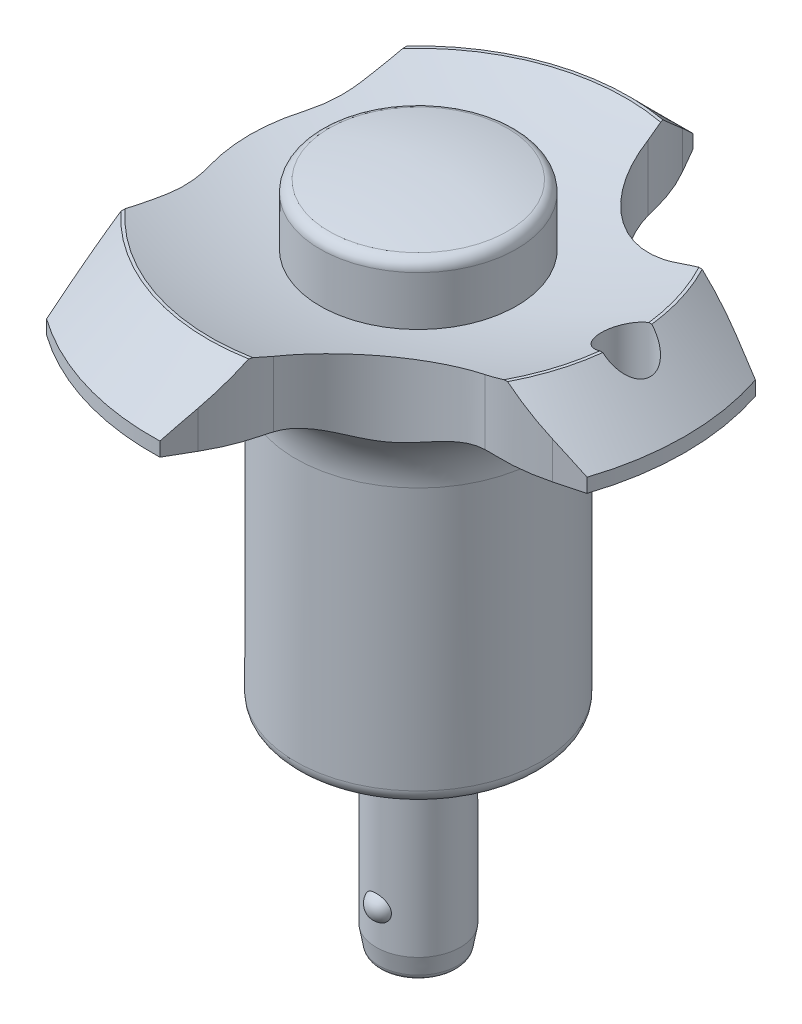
ISO-10303-21;
HEADER;
FILE_DESCRIPTION(('STEP AP214'),'2;1');
FILE_NAME('part.step','',(''),(''),'','','');
FILE_SCHEMA(('AUTOMOTIVE_DESIGN { 1 0 10303 214 1 1 1 1 }'));
ENDSEC;
DATA;
#1=APPLICATION_CONTEXT('core data for automotive mechanical design processes');
#2=APPLICATION_PROTOCOL_DEFINITION('international standard','automotive_design',2000,#1);
#3=PRODUCT_CONTEXT('',#1,'mechanical');
#4=PRODUCT('Part','Part','',(#3));
#5=PRODUCT_RELATED_PRODUCT_CATEGORY('part','',(#4));
#6=PRODUCT_DEFINITION_FORMATION('','',#4);
#7=PRODUCT_DEFINITION_CONTEXT('part definition',#1,'design');
#8=PRODUCT_DEFINITION('design','',#6,#7);
#9=PRODUCT_DEFINITION_SHAPE('','',#8);
#10=(LENGTH_UNIT() NAMED_UNIT(*) SI_UNIT(.MILLI.,.METRE.));
#11=(NAMED_UNIT(*) PLANE_ANGLE_UNIT() SI_UNIT($,.RADIAN.));
#12=(NAMED_UNIT(*) SI_UNIT($,.STERADIAN.) SOLID_ANGLE_UNIT());
#13=UNCERTAINTY_MEASURE_WITH_UNIT(LENGTH_MEASURE(1.E-05),#10,'distance_accuracy_value','');
#14=(GEOMETRIC_REPRESENTATION_CONTEXT(3) GLOBAL_UNCERTAINTY_ASSIGNED_CONTEXT((#13)) GLOBAL_UNIT_ASSIGNED_CONTEXT((#10,
#11,#12)) REPRESENTATION_CONTEXT('',''));
#15=CARTESIAN_POINT('',(0.,0.,0.));
#16=DIRECTION('',(0.,0.,1.));
#17=DIRECTION('',(1.,0.,0.));
#18=AXIS2_PLACEMENT_3D('',#15,#16,#17);
#19=CARTESIAN_POINT('',(0.,33.2,0.));
#20=DIRECTION('',(0.,-1.,0.));
#21=DIRECTION('',(0.,0.,-1.));
#22=AXIS2_PLACEMENT_3D('',#19,#20,#21);
#23=CYLINDRICAL_SURFACE('',#22,7.);
#24=CARTESIAN_POINT('',(0.,31.7572687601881,0.));
#25=DIRECTION('',(0.,-1.,0.));
#26=DIRECTION('',(0.,0.,-1.));
#27=AXIS2_PLACEMENT_3D('',#24,#25,#26);
#28=CIRCLE('',#27,7.);
#29=CARTESIAN_POINT('',(0.,31.7572687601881,-7.));
#30=VERTEX_POINT('',#29);
#31=EDGE_CURVE('P0_E11',#30,#30,#28,.T.);
#32=ORIENTED_EDGE('',*,*,#31,.T.);
#33=EDGE_LOOP('',(#32));
#34=FACE_BOUND('',#33,.T.);
#35=CARTESIAN_POINT('',(0.,15.,0.));
#36=DIRECTION('',(0.,1.,0.));
#37=DIRECTION('',(0.,0.,1.));
#38=AXIS2_PLACEMENT_3D('',#35,#36,#37);
#39=CIRCLE('',#38,7.);
#40=CARTESIAN_POINT('',(0.,15.,7.));
#41=VERTEX_POINT('',#40);
#42=EDGE_CURVE('P0_E48',#41,#41,#39,.T.);
#43=ORIENTED_EDGE('',*,*,#42,.T.);
#44=EDGE_LOOP('',(#43));
#45=FACE_BOUND('',#44,.T.);
#46=ADVANCED_FACE('P0_F16',(#34,#45),#23,.T.);
#47=CARTESIAN_POINT('',(0.,15.,0.));
#48=DIRECTION('',(0.,1.,0.));
#49=DIRECTION('',(0.,0.,1.));
#50=AXIS2_PLACEMENT_3D('',#47,#48,#49);
#51=PLANE('',#50);
#52=ORIENTED_EDGE('',*,*,#42,.F.);
#53=EDGE_LOOP('',(#52));
#54=FACE_BOUND('',#53,.T.);
#55=ADVANCED_FACE('P0_F28',(#54),#51,.F.);
#56=CARTESIAN_POINT('',(0.,2.17499999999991,0.));
#57=DIRECTION('',(0.,1.,0.));
#58=DIRECTION('',(-1.,0.,0.));
#59=AXIS2_PLACEMENT_3D('',#56,#57,#58);
#60=SPHERICAL_SURFACE('',#59,31.0250000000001);
#61=CARTESIAN_POINT('',(0.,32.5402568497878,0.));
#62=DIRECTION('',(0.,-1.,0.));
#63=DIRECTION('',(0.,0.,-1.));
#64=AXIS2_PLACEMENT_3D('',#61,#62,#63);
#65=CIRCLE('',#64,6.36410256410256);
#66=CARTESIAN_POINT('',(0.,32.5402568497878,-6.36410256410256));
#67=VERTEX_POINT('',#66);
#68=EDGE_CURVE('P0_E23',#67,#67,#65,.F.);
#69=ORIENTED_EDGE('',*,*,#68,.T.);
#70=EDGE_LOOP('',(#69));
#71=FACE_BOUND('',#70,.T.);
#72=CARTESIAN_POINT('',(0.,33.2,0.));
#73=VERTEX_POINT('',#72);
#74=VERTEX_LOOP('',#73);
#75=FACE_BOUND('',#74,.T.);
#76=ADVANCED_FACE('P0_F26',(#71,#75),#60,.T.);
#77=CARTESIAN_POINT('',(0.,31.7572687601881,0.));
#78=DIRECTION('',(0.,-1.,0.));
#79=DIRECTION('',(0.,0.,-1.));
#80=AXIS2_PLACEMENT_3D('',#77,#78,#79);
#81=TOROIDAL_SURFACE('',#80,6.2,0.8);
#82=ORIENTED_EDGE('',*,*,#31,.F.);
#83=EDGE_LOOP('',(#82));
#84=FACE_BOUND('',#83,.T.);
#85=ORIENTED_EDGE('',*,*,#68,.F.);
#86=EDGE_LOOP('',(#85));
#87=FACE_BOUND('',#86,.T.);
#88=ADVANCED_FACE('P0_F18',(#84,#87),#81,.T.);
#89=CLOSED_SHELL('',(#46,#55,#76,#88));
#90=MANIFOLD_SOLID_BREP('P0_B1',#89);
#91=CARTESIAN_POINT('',(-19.,30.2,0.));
#92=DIRECTION('',(0.,1.,0.));
#93=DIRECTION('',(-1.,0.,0.));
#94=AXIS2_PLACEMENT_3D('',#91,#92,#93);
#95=PLANE('',#94);
#96=CARTESIAN_POINT('',(0.,30.2,0.));
#97=DIRECTION('',(0.,1.,0.));
#98=DIRECTION('',(-1.,0.,0.));
#99=AXIS2_PLACEMENT_3D('',#96,#97,#98);
#100=CIRCLE('',#99,14.790199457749);
#101=CARTESIAN_POINT('',(14.6866680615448,30.2,-1.74693481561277));
#102=VERTEX_POINT('',#101);
#103=CARTESIAN_POINT('',(13.0598212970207,30.2,-6.94197865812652));
#104=VERTEX_POINT('',#103);
#105=EDGE_CURVE('P1_E287',#102,#104,#100,.T.);
#106=ORIENTED_EDGE('',*,*,#105,.F.);
#107=CARTESIAN_POINT('',(14.790199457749,30.2,0.));
#108=DIRECTION('',(0.,1.,0.));
#109=DIRECTION('',(0.,0.,1.));
#110=AXIS2_PLACEMENT_3D('',#107,#108,#109);
#111=CIRCLE('',#110,1.75);
#112=CARTESIAN_POINT('',(14.8979566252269,30.2,-1.74667924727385));
#113=VERTEX_POINT('',#112);
#114=EDGE_CURVE('P1_E40',#113,#102,#111,.T.);
#115=ORIENTED_EDGE('',*,*,#114,.F.);
#116=CARTESIAN_POINT('',(0.,30.2,0.));
#117=DIRECTION('',(0.,1.,0.));
#118=DIRECTION('',(-1.,0.,0.));
#119=AXIS2_PLACEMENT_3D('',#116,#117,#118);
#120=CIRCLE('',#119,15.);
#121=CARTESIAN_POINT('',(13.300156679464,30.2,-6.93583681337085));
#122=VERTEX_POINT('',#121);
#123=EDGE_CURVE('P1_E231',#113,#122,#120,.T.);
#124=ORIENTED_EDGE('',*,*,#123,.T.);
#125=CARTESIAN_POINT('',(12.8606666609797,30.2,5.55643473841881));
#126=DIRECTION('',(0.,-1.,0.));
#127=DIRECTION('',(0.,0.,-1.));
#128=AXIS2_PLACEMENT_3D('',#125,#126,#127);
#129=CIRCLE('',#128,12.5);
#130=EDGE_CURVE('P1_E520',#104,#122,#129,.T.);
#131=ORIENTED_EDGE('',*,*,#130,.F.);
#132=EDGE_LOOP('',(#106,#115,#124,#131));
#133=FACE_BOUND('',#132,.T.);
#134=ADVANCED_FACE('P1_F16',(#133),#95,.T.);
#135=CARTESIAN_POINT('',(13.3001566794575,30.2,6.9358368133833));
#136=VERTEX_POINT('',#135);
#137=CARTESIAN_POINT('',(14.8979566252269,30.2,1.74667924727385));
#138=VERTEX_POINT('',#137);
#139=EDGE_CURVE('P1_E229',#136,#138,#120,.T.);
#140=ORIENTED_EDGE('',*,*,#139,.T.);
#141=CARTESIAN_POINT('',(14.6866680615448,30.2,1.74693481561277));
#142=VERTEX_POINT('',#141);
#143=EDGE_CURVE('P1_E213',#142,#138,#111,.T.);
#144=ORIENTED_EDGE('',*,*,#143,.F.);
#145=CARTESIAN_POINT('',(13.0598212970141,30.2,6.94197865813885));
#146=VERTEX_POINT('',#145);
#147=EDGE_CURVE('P1_E285',#146,#142,#100,.T.);
#148=ORIENTED_EDGE('',*,*,#147,.F.);
#149=CARTESIAN_POINT('',(12.8606666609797,30.2,-5.55643473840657));
#150=DIRECTION('',(0.,-1.,0.));
#151=DIRECTION('',(0.,0.,1.));
#152=AXIS2_PLACEMENT_3D('',#149,#150,#151);
#153=CIRCLE('',#152,12.5);
#154=EDGE_CURVE('P1_E236',#136,#146,#153,.T.);
#155=ORIENTED_EDGE('',*,*,#154,.F.);
#156=EDGE_LOOP('',(#140,#144,#148,#155));
#157=FACE_BOUND('',#156,.T.);
#158=ADVANCED_FACE('P1_F235',(#157),#95,.T.);
#159=CARTESIAN_POINT('',(-14.25,25.2,0.));
#160=DIRECTION('',(0.,-1.,0.));
#161=DIRECTION('',(1.,0.,0.));
#162=AXIS2_PLACEMENT_3D('',#159,#160,#161);
#163=PLANE('',#162);
#164=CARTESIAN_POINT('',(0.,25.2,0.));
#165=DIRECTION('',(0.,1.,0.));
#166=DIRECTION('',(-1.,0.,0.));
#167=AXIS2_PLACEMENT_3D('',#164,#165,#166);
#168=CIRCLE('',#167,14.25);
#169=CARTESIAN_POINT('',(12.4476557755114,25.2000000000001,6.93674027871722));
#170=VERTEX_POINT('',#169);
#171=CARTESIAN_POINT('',(14.1563337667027,25.2,1.63116960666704));
#172=VERTEX_POINT('',#171);
#173=EDGE_CURVE('P1_E265',#170,#172,#168,.T.);
#174=ORIENTED_EDGE('',*,*,#173,.T.);
#175=CARTESIAN_POINT('',(14.790199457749,25.2,0.));
#176=DIRECTION('',(0.,-1.,0.));
#177=DIRECTION('',(1.,0.,0.));
#178=AXIS2_PLACEMENT_3D('',#175,#176,#177);
#179=CIRCLE('',#178,1.75);
#180=CARTESIAN_POINT('',(14.1563337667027,25.2,-1.63116960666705));
#181=VERTEX_POINT('',#180);
#182=EDGE_CURVE('P1_E32',#172,#181,#179,.F.);
#183=ORIENTED_EDGE('',*,*,#182,.T.);
#184=CARTESIAN_POINT('',(12.4476557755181,25.2,-6.93674027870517));
#185=VERTEX_POINT('',#184);
#186=EDGE_CURVE('P1_E266',#181,#185,#168,.T.);
#187=ORIENTED_EDGE('',*,*,#186,.T.);
#188=CARTESIAN_POINT('',(12.8606666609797,25.2,5.55643473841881));
#189=DIRECTION('',(0.,-1.,0.));
#190=DIRECTION('',(1.,0.,0.));
#191=AXIS2_PLACEMENT_3D('',#188,#189,#190);
#192=CIRCLE('',#191,12.5);
#193=CARTESIAN_POINT('',(16.0959047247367,25.2,-6.51763809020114));
#194=VERTEX_POINT('',#193);
#195=EDGE_CURVE('P1_E1037',#185,#194,#192,.T.);
#196=ORIENTED_EDGE('',*,*,#195,.T.);
#197=DIRECTION('',(0.965925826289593,0.,0.258819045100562));
#198=VECTOR('',#197,1.);
#199=CARTESIAN_POINT('',(-10.5878003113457,25.2,-13.6675153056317));
#200=LINE('',#199,#198);
#201=CARTESIAN_POINT('',(18.0277563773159,25.2,-6.));
#202=VERTEX_POINT('',#201);
#203=EDGE_CURVE('P1_E609',#194,#202,#200,.T.);
#204=ORIENTED_EDGE('',*,*,#203,.T.);
#205=CARTESIAN_POINT('',(0.,25.2,0.));
#206=DIRECTION('',(0.,1.,0.));
#207=DIRECTION('',(-1.,0.,0.));
#208=AXIS2_PLACEMENT_3D('',#205,#206,#207);
#209=CIRCLE('',#208,19.);
#210=CARTESIAN_POINT('',(18.0277563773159,25.2,6.00000000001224));
#211=VERTEX_POINT('',#210);
#212=EDGE_CURVE('P1_E251',#211,#202,#209,.T.);
#213=ORIENTED_EDGE('',*,*,#212,.F.);
#214=DIRECTION('',(-0.965925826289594,0.,0.25881904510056));
#215=VECTOR('',#214,1.);
#216=CARTESIAN_POINT('',(-10.5878003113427,25.2,13.6675153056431));
#217=LINE('',#216,#215);
#218=CARTESIAN_POINT('',(16.0959047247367,25.2,6.51763809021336));
#219=VERTEX_POINT('',#218);
#220=EDGE_CURVE('P1_E512',#211,#219,#217,.T.);
#221=ORIENTED_EDGE('',*,*,#220,.T.);
#222=CARTESIAN_POINT('',(12.8606666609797,25.2,-5.55643473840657));
#223=DIRECTION('',(0.,-1.,0.));
#224=DIRECTION('',(1.,0.,0.));
#225=AXIS2_PLACEMENT_3D('',#222,#223,#224);
#226=CIRCLE('',#225,12.5);
#227=EDGE_CURVE('P1_E679',#219,#170,#226,.T.);
#228=ORIENTED_EDGE('',*,*,#227,.T.);
#229=EDGE_LOOP('',(#174,#183,#187,#196,#204,#213,#221,#228));
#230=FACE_BOUND('',#229,.T.);
#231=ADVANCED_FACE('P1_F733',(#230),#163,.T.);
#232=CARTESIAN_POINT('',(0.,19.7,0.));
#233=DIRECTION('',(0.,1.,0.));
#234=DIRECTION('',(-1.,0.,0.));
#235=AXIS2_PLACEMENT_3D('',#232,#233,#234);
#236=TOROIDAL_SURFACE('',#235,14.25,5.5);
#237=CARTESIAN_POINT('',(0.,19.7,0.));
#238=DIRECTION('',(0.,1.,0.));
#239=DIRECTION('',(-1.,0.,0.));
#240=AXIS2_PLACEMENT_3D('',#237,#238,#239);
#241=CIRCLE('',#240,8.75);
#242=CARTESIAN_POINT('',(-8.75,19.7,0.));
#243=VERTEX_POINT('',#242);
#244=EDGE_CURVE('P1_E274',#243,#243,#241,.T.);
#245=ORIENTED_EDGE('',*,*,#244,.T.);
#246=EDGE_LOOP('',(#245));
#247=FACE_BOUND('',#246,.T.);
#248=ORIENTED_EDGE('',*,*,#186,.F.);
#249=CARTESIAN_POINT('',(14.2502,25.1991429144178,-1.6646022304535));
#250=CARTESIAN_POINT('',(14.2042623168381,25.1999826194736,-1.64970098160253));
#251=CARTESIAN_POINT('',(14.1589561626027,25.2001952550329,-1.63289959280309));
#252=CARTESIAN_POINT('',(14.0699047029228,25.1994597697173,-1.59562095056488));
#253=CARTESIAN_POINT('',(14.0261590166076,25.1985119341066,-1.57514460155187));
#254=CARTESIAN_POINT('',(13.8979419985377,25.1940770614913,-1.5085156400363));
#255=CARTESIAN_POINT('',(13.8162015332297,25.189002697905,-1.4570688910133));
#256=CARTESIAN_POINT('',(13.6625097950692,25.1758106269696,-1.34166462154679));
#257=CARTESIAN_POINT('',(13.5905547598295,25.1676940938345,-1.2777119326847));
#258=CARTESIAN_POINT('',(13.4581285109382,25.1499438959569,-1.13898330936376));
#259=CARTESIAN_POINT('',(13.3976621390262,25.1403095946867,-1.06420283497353));
#260=CARTESIAN_POINT('',(13.2884525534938,25.1209736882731,-0.903822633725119));
#261=CARTESIAN_POINT('',(13.2400286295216,25.1112761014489,-0.818004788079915));
#262=CARTESIAN_POINT('',(13.1581906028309,25.0938088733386,-0.639298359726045));
#263=CARTESIAN_POINT('',(13.1247757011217,25.0860391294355,-0.546410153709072));
#264=CARTESIAN_POINT('',(13.0740128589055,25.0738737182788,-0.356203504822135));
#265=CARTESIAN_POINT('',(13.0566505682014,25.0694750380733,-0.258889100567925));
#266=CARTESIAN_POINT('',(13.0385484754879,25.064883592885,-0.0626413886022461));
#267=CARTESIAN_POINT('',(13.0378045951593,25.0646897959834,0.0362915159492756));
#268=CARTESIAN_POINT('',(13.0527361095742,25.068485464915,0.229974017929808));
#269=CARTESIAN_POINT('',(13.0679443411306,25.0723559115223,0.324762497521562));
#270=CARTESIAN_POINT('',(13.1135594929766,25.0833937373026,0.510409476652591));
#271=CARTESIAN_POINT('',(13.1439686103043,25.0905615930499,0.601267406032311));
#272=CARTESIAN_POINT('',(13.2194330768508,25.1070123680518,0.777474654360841));
#273=CARTESIAN_POINT('',(13.2646222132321,25.1163143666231,0.862764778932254));
#274=CARTESIAN_POINT('',(13.3683648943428,25.1353787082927,1.02476366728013));
#275=CARTESIAN_POINT('',(13.4269226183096,25.1451411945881,1.1014697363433));
#276=CARTESIAN_POINT('',(13.5576641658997,25.1636664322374,1.24624537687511));
#277=CARTESIAN_POINT('',(13.6301729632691,25.1723951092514,1.31402614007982));
#278=CARTESIAN_POINT('',(13.7857547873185,25.1868126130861,1.43644011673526));
#279=CARTESIAN_POINT('',(13.8688152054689,25.1925050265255,1.49108880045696));
#280=CARTESIAN_POINT('',(14.0028942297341,25.1978948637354,1.56381573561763));
#281=CARTESIAN_POINT('',(14.0510697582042,25.1991455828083,1.58715064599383));
#282=CARTESIAN_POINT('',(14.1493071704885,25.2002344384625,1.62929760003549));
#283=CARTESIAN_POINT('',(14.1993667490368,25.200074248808,1.64811497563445));
#284=CARTESIAN_POINT('',(14.2502,25.1991429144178,1.6646022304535));
#285=B_SPLINE_CURVE_WITH_KNOTS('',3,(#249,#250,#251,#252,#253,#254,#255,#256,#257,#258,#259,
#260,#261,#262,#263,#264,#265,#266,#267,#268,#269,#270,#271,#272,#273,#274,#275,#276,#277,#278,
#279,#280,#281,#282,#283,#284),.UNSPECIFIED.,.F.,.F.,(4,2,2,2,2,2,2,2,2,2,2,2,2,2,2,2,2,4),(0.,
0.144809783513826,0.289583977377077,0.578231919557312,0.866768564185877,1.15542654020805,
1.45107354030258,1.74670480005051,2.04207152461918,2.3373657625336,2.6242473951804,
2.91117050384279,3.20076622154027,3.49045259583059,3.78795379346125,4.0851027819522,
4.24551820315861,4.40574334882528),.UNSPECIFIED.);
#286=EDGE_CURVE('P1_E232',#181,#172,#285,.T.);
#287=ORIENTED_EDGE('',*,*,#286,.T.);
#288=ORIENTED_EDGE('',*,*,#173,.F.);
#289=CARTESIAN_POINT('',(14.2502,24.9717309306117,6.86609306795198));
#290=CARTESIAN_POINT('',(14.0793866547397,25.0150346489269,6.88522647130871));
#291=CARTESIAN_POINT('',(13.906667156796,25.0524848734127,6.900953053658));
#292=CARTESIAN_POINT('',(13.5583259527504,25.1151856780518,6.92529634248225));
#293=CARTESIAN_POINT('',(13.3827010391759,25.1404216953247,6.93390457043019));
#294=CARTESIAN_POINT('',(13.0330284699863,25.1777587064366,6.94358053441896));
#295=CARTESIAN_POINT('',(12.8590088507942,25.1900867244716,6.94478048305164));
#296=CARTESIAN_POINT('',(12.5107529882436,25.2018643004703,6.93987786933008));
#297=CARTESIAN_POINT('',(12.3365170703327,25.2013251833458,6.93378173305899));
#298=CARTESIAN_POINT('',(12.0782272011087,25.1906012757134,6.91934094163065));
#299=CARTESIAN_POINT('',(11.9937757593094,25.1855080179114,6.91375527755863));
#300=CARTESIAN_POINT('',(11.824887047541,25.1720758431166,6.90086699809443));
#301=CARTESIAN_POINT('',(11.74045147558,25.1637227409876,6.89355693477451));
#302=CARTESIAN_POINT('',(11.6562800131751,25.1537207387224,6.88540808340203));
#303=B_SPLINE_CURVE_WITH_KNOTS('',3,(#289,#290,#291,#292,#293,#294,#295,#296,#297,#298,#299,
#300,#301,#302),.UNSPECIFIED.,.F.,.F.,(4,2,2,2,2,2,4),(0.,0.5316805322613,1.06399342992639,
1.58677822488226,2.10910291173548,2.36340213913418,2.61882050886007),.UNSPECIFIED.);
#304=CARTESIAN_POINT('',(11.6564800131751,25.1537445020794,6.88542744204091));
#305=VERTEX_POINT('',#304);
#306=EDGE_CURVE('P1_E673',#170,#305,#303,.T.);
#307=ORIENTED_EDGE('',*,*,#306,.T.);
#308=CARTESIAN_POINT('',(11.6566800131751,25.1537682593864,6.88544680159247));
#309=CARTESIAN_POINT('',(11.5594002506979,25.1422170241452,6.87602741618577));
#310=CARTESIAN_POINT('',(11.4622162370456,25.1286218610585,6.8684202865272));
#311=CARTESIAN_POINT('',(11.2682690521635,25.0976778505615,6.85677712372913));
#312=CARTESIAN_POINT('',(11.1715057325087,25.0803304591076,6.85273970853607));
#313=CARTESIAN_POINT('',(10.8826272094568,25.0232534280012,6.8459061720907));
#314=CARTESIAN_POINT('',(10.6913672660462,24.978419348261,6.84833581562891));
#315=CARTESIAN_POINT('',(10.3134871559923,24.8783310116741,6.86648508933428));
#316=CARTESIAN_POINT('',(10.1268470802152,24.8231361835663,6.88213062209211));
#317=CARTESIAN_POINT('',(9.75739324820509,24.7051603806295,6.92601438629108));
#318=CARTESIAN_POINT('',(9.57458205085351,24.6423745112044,6.95426077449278));
#319=CARTESIAN_POINT('',(9.21451205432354,24.5130865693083,7.02261490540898));
#320=CARTESIAN_POINT('',(9.03721777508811,24.4466237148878,7.06261185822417));
#321=CARTESIAN_POINT('',(8.68599997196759,24.3129496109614,7.15446642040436));
#322=CARTESIAN_POINT('',(8.5120767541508,24.2457382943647,7.20632510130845));
#323=CARTESIAN_POINT('',(8.16692767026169,24.1146077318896,7.32220452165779));
#324=CARTESIAN_POINT('',(7.99570322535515,24.0506901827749,7.38623145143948));
#325=CARTESIAN_POINT('',(7.6556057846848,23.9311518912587,7.52704009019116));
#326=CARTESIAN_POINT('',(7.48673142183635,23.8755261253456,7.60381401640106));
#327=CARTESIAN_POINT('',(7.2072473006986,23.794570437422,7.74301998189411));
#328=CARTESIAN_POINT('',(7.09593153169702,23.7653165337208,7.80173499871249));
#329=CARTESIAN_POINT('',(6.87480574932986,23.7149414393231,7.92521803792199));
#330=CARTESIAN_POINT('',(6.76499543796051,23.6938186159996,7.9899848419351));
#331=CARTESIAN_POINT('',(6.54816816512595,23.6613802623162,8.1250385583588));
#332=CARTESIAN_POINT('',(6.4411389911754,23.6500103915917,8.19529247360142));
#333=CARTESIAN_POINT('',(6.23017950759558,23.6378456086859,8.34117425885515));
#334=CARTESIAN_POINT('',(6.12624899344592,23.6370499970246,8.41680177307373));
#335=CARTESIAN_POINT('',(5.92244869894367,23.6461066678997,8.57274294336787));
#336=CARTESIAN_POINT('',(5.82257913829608,23.6559595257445,8.65305685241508));
#337=CARTESIAN_POINT('',(5.62766430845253,23.6854547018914,8.8176065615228));
#338=CARTESIAN_POINT('',(5.53261973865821,23.7050984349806,8.90184292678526));
#339=CARTESIAN_POINT('',(5.25410671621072,23.7768366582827,9.16064349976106));
#340=CARTESIAN_POINT('',(5.07859966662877,23.8416457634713,9.34026674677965));
#341=CARTESIAN_POINT('',(4.76295492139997,23.983991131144,9.69435230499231));
#342=CARTESIAN_POINT('',(4.6210792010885,24.0599787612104,9.86795703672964));
#343=CARTESIAN_POINT('',(4.35338817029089,24.2183718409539,10.2246609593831));
#344=CARTESIAN_POINT('',(4.22759004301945,24.3007840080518,10.4077700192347));
#345=CARTESIAN_POINT('',(3.99189617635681,24.4640334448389,10.783365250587));
#346=CARTESIAN_POINT('',(3.88193483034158,24.5448759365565,10.975808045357));
#347=CARTESIAN_POINT('',(3.67736612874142,24.6990701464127,11.3714451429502));
#348=CARTESIAN_POINT('',(3.58274461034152,24.7724287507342,11.5746292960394));
#349=CARTESIAN_POINT('',(3.4451588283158,24.8787402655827,11.9063480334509));
#350=CARTESIAN_POINT('',(3.39691565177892,24.9159319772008,12.0313525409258));
#351=CARTESIAN_POINT('',(3.30636134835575,24.9847155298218,12.2849736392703));
#352=CARTESIAN_POINT('',(3.26404827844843,25.0163092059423,12.4135890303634));
#353=CARTESIAN_POINT('',(3.18537054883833,25.0730845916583,12.6751677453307));
#354=CARTESIAN_POINT('',(3.14905422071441,25.0982150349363,12.8081569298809));
#355=CARTESIAN_POINT('',(3.08307385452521,25.1407979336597,13.0771429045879));
#356=CARTESIAN_POINT('',(3.05341764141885,25.1582413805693,13.2131430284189));
#357=CARTESIAN_POINT('',(3.02728721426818,25.1713374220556,13.3502980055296));
#358=B_SPLINE_CURVE_WITH_KNOTS('',3,(#308,#309,#310,#311,#312,#313,#314,#315,#316,#317,#318,
#319,#320,#321,#322,#323,#324,#325,#326,#327,#328,#329,#330,#331,#332,#333,#334,#335,#336,#337,
#338,#339,#340,#341,#342,#343,#344,#345,#346,#347,#348,#349,#350,#351,#352,#353,#354,#355,#356,
#357),.UNSPECIFIED.,.F.,.F.,(4,2,2,2,2,2,2,2,2,2,2,2,2,2,2,2,2,2,2,2,2,2,2,2,4),(0.,
0.295159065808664,0.590203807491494,1.17861237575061,1.76374364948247,2.34925424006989,
2.9294124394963,3.50962306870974,4.09012966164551,4.67028311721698,5.05756933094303,
5.44477774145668,5.82981446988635,6.21482572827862,6.5998577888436,6.98494550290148,
7.76013818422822,8.46948591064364,9.17958553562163,9.88665317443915,10.5930642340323,
11.0099916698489,11.4267821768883,11.846783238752,12.2672752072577),.UNSPECIFIED.);
#359=CARTESIAN_POINT('',(3.02732533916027,25.1713182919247,13.3500980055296));
#360=VERTEX_POINT('',#359);
#361=EDGE_CURVE('P1_E505',#305,#360,#358,.T.);
#362=ORIENTED_EDGE('',*,*,#361,.T.);
#363=CARTESIAN_POINT('',(3.02736346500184,25.1712991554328,13.3498980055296));
#364=CARTESIAN_POINT('',(3.01298527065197,25.1785186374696,13.4253331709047));
#365=CARTESIAN_POINT('',(2.99788541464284,25.1843582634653,13.5007611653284));
#366=CARTESIAN_POINT('',(2.96628555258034,25.1933111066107,13.6513637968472));
#367=CARTESIAN_POINT('',(2.9497877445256,25.1964285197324,13.7265386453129));
#368=CARTESIAN_POINT('',(2.91539052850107,25.1999922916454,13.8766301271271));
#369=CARTESIAN_POINT('',(2.8974911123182,25.2004386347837,13.9515467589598));
#370=CARTESIAN_POINT('',(2.86029004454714,25.198702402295,14.1011237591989));
#371=CARTESIAN_POINT('',(2.840986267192,25.19651575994,14.1757835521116));
#372=CARTESIAN_POINT('',(2.82100769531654,25.1930331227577,14.2502));
#373=B_SPLINE_CURVE_WITH_KNOTS('',3,(#363,#364,#365,#366,#367,#368,#369,#370,#371,#372),
.UNSPECIFIED.,.F.,.F.,(4,2,2,2,4),(0.,0.23137741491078,0.462397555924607,0.693419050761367,
0.924797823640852),.UNSPECIFIED.);
#374=CARTESIAN_POINT('',(2.89703894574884,25.2000000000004,13.9524071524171));
#375=VERTEX_POINT('',#374);
#376=EDGE_CURVE('P1_E496',#360,#375,#373,.T.);
#377=ORIENTED_EDGE('',*,*,#376,.T.);
#378=CARTESIAN_POINT('',(-11.,25.2,9.05883546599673));
#379=VERTEX_POINT('',#378);
#380=EDGE_CURVE('P1_E258',#379,#375,#168,.T.);
#381=ORIENTED_EDGE('',*,*,#380,.F.);
#382=CARTESIAN_POINT('',(-11.,24.9921140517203,11.2691840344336));
#383=CARTESIAN_POINT('',(-11.,25.0567843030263,10.9498915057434));
#384=CARTESIAN_POINT('',(-11.,25.1047871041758,10.6273466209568));
#385=CARTESIAN_POINT('',(-11.,25.1717409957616,9.97923980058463));
#386=CARTESIAN_POINT('',(-11.,25.1906796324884,9.65367663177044));
#387=CARTESIAN_POINT('',(-11.,25.2039580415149,8.99956819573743));
#388=CARTESIAN_POINT('',(-11.,25.1981016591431,8.67101974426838));
#389=CARTESIAN_POINT('',(-11.,25.1740146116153,8.17881655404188));
#390=CARTESIAN_POINT('',(-11.,25.1634212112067,8.014726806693));
#391=CARTESIAN_POINT('',(-11.,25.1377182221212,7.68694909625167));
#392=CARTESIAN_POINT('',(-11.,25.122610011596,7.52326102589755));
#393=CARTESIAN_POINT('',(-11.,25.0717669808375,7.03633415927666));
#394=CARTESIAN_POINT('',(-11.,25.0303142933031,6.71369525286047));
#395=CARTESIAN_POINT('',(-11.,24.9367947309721,6.06994764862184));
#396=CARTESIAN_POINT('',(-11.,24.8847251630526,5.74883936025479));
#397=CARTESIAN_POINT('',(-11.,24.7748702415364,5.1068386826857));
#398=CARTESIAN_POINT('',(-11.,24.7170715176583,4.78594864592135));
#399=CARTESIAN_POINT('',(-11.,24.6013192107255,4.14420459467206));
#400=CARTESIAN_POINT('',(-11.,24.5433656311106,3.82335057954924));
#401=CARTESIAN_POINT('',(-11.,24.4336589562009,3.18341475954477));
#402=CARTESIAN_POINT('',(-11.,24.3818564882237,2.86434168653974));
#403=CARTESIAN_POINT('',(-11.,24.2898196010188,2.22446814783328));
#404=CARTESIAN_POINT('',(-11.,24.2495841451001,1.90366783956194));
#405=CARTESIAN_POINT('',(-11.,24.2019503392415,1.42187959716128));
#406=CARTESIAN_POINT('',(-11.,24.1882077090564,1.26151849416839));
#407=CARTESIAN_POINT('',(-11.,24.1653910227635,0.940468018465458));
#408=CARTESIAN_POINT('',(-11.,24.1563167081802,0.779778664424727));
#409=CARTESIAN_POINT('',(-11.,24.143191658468,0.458210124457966));
#410=CARTESIAN_POINT('',(-11.,24.1391403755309,0.297330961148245));
#411=CARTESIAN_POINT('',(-11.,24.1362183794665,-0.0244747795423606));
#412=CARTESIAN_POINT('',(-11.,24.1373476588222,-0.185401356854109));
#413=CARTESIAN_POINT('',(-11.,24.1447228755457,-0.506226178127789));
#414=CARTESIAN_POINT('',(-11.,24.1509398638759,-0.666125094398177));
#415=CARTESIAN_POINT('',(-11.,24.1682055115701,-0.985665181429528));
#416=CARTESIAN_POINT('',(-11.,24.1792544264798,-1.14530633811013));
#417=CARTESIAN_POINT('',(-11.,24.219068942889,-1.62371079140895));
#418=CARTESIAN_POINT('',(-11.,24.2545014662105,-1.94192401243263));
#419=CARTESIAN_POINT('',(-11.,24.3385656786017,-2.57798814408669));
#420=CARTESIAN_POINT('',(-11.,24.3872571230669,-2.89583070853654));
#421=CARTESIAN_POINT('',(-11.,24.4919761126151,-3.5302584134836));
#422=CARTESIAN_POINT('',(-11.,24.548003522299,-3.84684357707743));
#423=CARTESIAN_POINT('',(-11.,24.6620822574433,-4.48207112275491));
#424=CARTESIAN_POINT('',(-11.,24.7201455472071,-4.80071126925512));
#425=CARTESIAN_POINT('',(-11.,24.8324151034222,-5.43871666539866));
#426=CARTESIAN_POINT('',(-11.,24.8866211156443,-5.75808196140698));
#427=CARTESIAN_POINT('',(-11.,24.9859562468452,-6.39733020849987));
#428=CARTESIAN_POINT('',(-11.,25.0311107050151,-6.71720911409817));
#429=CARTESIAN_POINT('',(-11.,25.1077933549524,-7.35857952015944));
#430=CARTESIAN_POINT('',(-11.,25.1393262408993,-7.68007042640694));
#431=CARTESIAN_POINT('',(-11.,25.1697982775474,-8.1171518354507));
#432=CARTESIAN_POINT('',(-11.,25.1766574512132,-8.23220294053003));
#433=CARTESIAN_POINT('',(-11.,25.1878642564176,-8.46246662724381));
#434=CARTESIAN_POINT('',(-11.,25.1922110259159,-8.57767925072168));
#435=CARTESIAN_POINT('',(-11.,25.2011705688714,-8.92329739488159));
#436=CARTESIAN_POINT('',(-11.,25.2017132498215,-9.15382903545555));
#437=CARTESIAN_POINT('',(-11.,25.1903513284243,-9.61413189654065));
#438=CARTESIAN_POINT('',(-11.,25.1784723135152,-9.84390370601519));
#439=CARTESIAN_POINT('',(-11.,25.140740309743,-10.3023467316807));
#440=CARTESIAN_POINT('',(-11.,25.1148864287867,-10.5310178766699));
#441=CARTESIAN_POINT('',(-11.,25.0473132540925,-10.9885778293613));
#442=CARTESIAN_POINT('',(-11.,25.0054249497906,-11.2174421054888));
#443=CARTESIAN_POINT('',(-11.,24.9043006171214,-11.6713763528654));
#444=CARTESIAN_POINT('',(-11.,24.8450629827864,-11.8964459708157));
#445=CARTESIAN_POINT('',(-11.,24.7077839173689,-12.3411322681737));
#446=CARTESIAN_POINT('',(-11.,24.6297189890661,-12.5607417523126));
#447=CARTESIAN_POINT('',(-11.,24.4536618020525,-12.9918183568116));
#448=CARTESIAN_POINT('',(-11.,24.3556774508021,-13.2032886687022));
#449=CARTESIAN_POINT('',(-11.,24.1698924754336,-13.556484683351));
#450=CARTESIAN_POINT('',(-11.,24.0871656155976,-13.7008916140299));
#451=CARTESIAN_POINT('',(-11.,23.9109463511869,-13.9829653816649));
#452=CARTESIAN_POINT('',(-11.,23.8174566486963,-14.1206338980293));
#453=CARTESIAN_POINT('',(-11.,23.6197462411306,-14.3878872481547));
#454=CARTESIAN_POINT('',(-11.,23.5155342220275,-14.5174784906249));
#455=CARTESIAN_POINT('',(-11.,23.2965133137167,-14.7672892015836));
#456=CARTESIAN_POINT('',(-11.,23.1817096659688,-14.887513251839));
#457=CARTESIAN_POINT('',(-11.,22.9406678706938,-15.1183431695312));
#458=CARTESIAN_POINT('',(-11.,22.814331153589,-15.2288464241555));
#459=CARTESIAN_POINT('',(-11.,22.5518429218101,-15.4373981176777));
#460=CARTESIAN_POINT('',(-11.,22.4156964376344,-15.5354528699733));
#461=CARTESIAN_POINT('',(-11.,22.1344061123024,-15.7177182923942));
#462=CARTESIAN_POINT('',(-11.,21.9892620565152,-15.8019286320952));
#463=CARTESIAN_POINT('',(-11.,21.6911496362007,-15.9551204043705));
#464=CARTESIAN_POINT('',(-11.,21.538182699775,-16.0241046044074));
#465=CARTESIAN_POINT('',(-11.,21.2470699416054,-16.1373916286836));
#466=CARTESIAN_POINT('',(-11.,21.1097302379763,-16.1837735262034));
#467=CARTESIAN_POINT('',(-11.,20.8313524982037,-16.2636266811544));
#468=CARTESIAN_POINT('',(-11.,20.6903149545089,-16.2970996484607));
#469=CARTESIAN_POINT('',(-11.,20.405811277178,-16.3506365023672));
#470=CARTESIAN_POINT('',(-11.,20.2623467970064,-16.3707091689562));
#471=CARTESIAN_POINT('',(-11.,19.9741631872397,-16.3971811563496));
#472=CARTESIAN_POINT('',(-11.,19.8294441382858,-16.4035813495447));
#473=CARTESIAN_POINT('',(-11.,19.5542777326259,-16.4026645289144));
#474=CARTESIAN_POINT('',(-11.,19.4238243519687,-16.3966327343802));
#475=CARTESIAN_POINT('',(-11.,19.1638662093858,-16.3734483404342));
#476=CARTESIAN_POINT('',(-11.,19.0343617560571,-16.3562922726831));
#477=CARTESIAN_POINT('',(-11.,18.7773325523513,-16.3110726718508));
#478=CARTESIAN_POINT('',(-11.,18.6498069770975,-16.2830138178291));
#479=CARTESIAN_POINT('',(-11.,18.3975099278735,-16.2163096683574));
#480=CARTESIAN_POINT('',(-11.,18.2727395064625,-16.1776604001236));
#481=CARTESIAN_POINT('',(-11.,18.027459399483,-16.0904491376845));
#482=CARTESIAN_POINT('',(-11.,17.9069305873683,-16.0419409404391));
#483=CARTESIAN_POINT('',(-11.,17.6701345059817,-15.9354155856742));
#484=CARTESIAN_POINT('',(-11.,17.5538687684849,-15.8773950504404));
#485=CARTESIAN_POINT('',(-11.,17.2125645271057,-15.6899905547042));
#486=CARTESIAN_POINT('',(-11.,16.9947530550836,-15.547167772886));
#487=CARTESIAN_POINT('',(-11.,16.5674766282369,-15.2195235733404));
#488=CARTESIAN_POINT('',(-11.,16.3598110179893,-15.0323820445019));
#489=CARTESIAN_POINT('',(-11.,15.9738188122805,-14.6295721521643));
#490=CARTESIAN_POINT('',(-11.,15.7955348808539,-14.4138631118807));
#491=CARTESIAN_POINT('',(-11.,15.5182164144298,-14.0283602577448));
#492=CARTESIAN_POINT('',(-11.,15.4114026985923,-13.8640542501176));
#493=CARTESIAN_POINT('',(-11.,15.2126033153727,-13.5266286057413));
#494=CARTESIAN_POINT('',(-11.,15.1206227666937,-13.3535059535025));
#495=CARTESIAN_POINT('',(-11.,14.9512903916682,-13.0005546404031));
#496=CARTESIAN_POINT('',(-11.,14.8739205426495,-12.8207345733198));
#497=CARTESIAN_POINT('',(-11.,14.7330957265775,-12.4557862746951));
#498=CARTESIAN_POINT('',(-11.,14.669639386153,-12.2706585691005));
#499=CARTESIAN_POINT('',(-11.,14.5325042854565,-11.8193626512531));
#500=CARTESIAN_POINT('',(-11.,14.4653663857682,-11.5511980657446));
#501=CARTESIAN_POINT('',(-11.,14.3550191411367,-11.0098768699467));
#502=CARTESIAN_POINT('',(-11.,14.3118302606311,-10.7367161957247));
#503=CARTESIAN_POINT('',(-11.,14.2466685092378,-10.1861508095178));
#504=CARTESIAN_POINT('',(-11.,14.2248344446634,-9.90873008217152));
#505=CARTESIAN_POINT('',(-11.,14.200147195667,-9.35345519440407));
#506=CARTESIAN_POINT('',(-11.,14.1972707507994,-9.07560198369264));
#507=CARTESIAN_POINT('',(-11.,14.2079234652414,-8.50538399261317));
#508=CARTESIAN_POINT('',(-11.,14.2223389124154,-8.21303845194));
#509=CARTESIAN_POINT('',(-11.,14.2657646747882,-7.62940413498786));
#510=CARTESIAN_POINT('',(-11.,14.2947793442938,-7.33811570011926));
#511=CARTESIAN_POINT('',(-11.,14.3640864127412,-6.75635827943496));
#512=CARTESIAN_POINT('',(-11.,14.4044004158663,-6.46589195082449));
#513=CARTESIAN_POINT('',(-11.,14.4927509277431,-5.88619144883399));
#514=CARTESIAN_POINT('',(-11.,14.5407868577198,-5.59695718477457));
#515=CARTESIAN_POINT('',(-11.,14.6408230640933,-5.01941070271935));
#516=CARTESIAN_POINT('',(-11.,14.692820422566,-4.73109796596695));
#517=CARTESIAN_POINT('',(-11.,14.7968322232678,-4.15446329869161));
#518=CARTESIAN_POINT('',(-11.,14.8488466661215,-3.86614136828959));
#519=CARTESIAN_POINT('',(-11.,14.9485485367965,-3.28921282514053));
#520=CARTESIAN_POINT('',(-11.,14.9962428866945,-3.00060744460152));
#521=CARTESIAN_POINT('',(-11.,15.08301039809,-2.42207235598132));
#522=CARTESIAN_POINT('',(-11.,15.1220839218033,-2.13214270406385));
#523=CARTESIAN_POINT('',(-11.,15.1877312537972,-1.54850674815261));
#524=CARTESIAN_POINT('',(-11.,15.2142043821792,-1.25478867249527));
#525=CARTESIAN_POINT('',(-11.,15.250955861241,-0.666337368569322));
#526=CARTESIAN_POINT('',(-11.,15.26123640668,-0.371604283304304));
#527=CARTESIAN_POINT('',(-11.,15.2642511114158,0.217987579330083));
#528=CARTESIAN_POINT('',(-11.,15.2569833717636,0.512846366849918));
#529=CARTESIAN_POINT('',(-11.,15.2258629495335,1.10168450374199));
#530=CARTESIAN_POINT('',(-11.,15.2020082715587,1.39566374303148));
#531=CARTESIAN_POINT('',(-11.,15.1405496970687,1.98337834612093));
#532=CARTESIAN_POINT('',(-11.,15.102888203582,2.27710744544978));
#533=CARTESIAN_POINT('',(-11.,15.0180025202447,2.8631923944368));
#534=CARTESIAN_POINT('',(-11.,14.9707763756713,3.15554795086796));
#535=CARTESIAN_POINT('',(-11.,14.8712826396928,3.73956613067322));
#536=CARTESIAN_POINT('',(-11.,14.8190118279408,4.03122818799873));
#537=CARTESIAN_POINT('',(-11.,14.713902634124,4.61442779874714));
#538=CARTESIAN_POINT('',(-11.,14.6610642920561,4.90596535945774));
#539=CARTESIAN_POINT('',(-11.,14.5748275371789,5.39900386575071));
#540=CARTESIAN_POINT('',(-11.,14.5404895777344,5.60033768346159));
#541=CARTESIAN_POINT('',(-11.,14.4747988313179,6.00345703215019));
#542=CARTESIAN_POINT('',(-11.,14.4434454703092,6.20524246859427));
#543=CARTESIAN_POINT('',(-11.,14.3850007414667,6.60905235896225));
#544=CARTESIAN_POINT('',(-11.,14.3579014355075,6.81107564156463));
#545=CARTESIAN_POINT('',(-11.,14.3090724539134,7.21577452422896));
#546=CARTESIAN_POINT('',(-11.,14.2873429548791,7.41845014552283));
#547=CARTESIAN_POINT('',(-11.,14.232074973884,8.02591550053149));
#548=CARTESIAN_POINT('',(-11.,14.2082181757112,8.43167372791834));
#549=CARTESIAN_POINT('',(-11.,14.1953179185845,9.24403992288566));
#550=CARTESIAN_POINT('',(-11.,14.2062719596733,9.65064782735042));
#551=CARTESIAN_POINT('',(-11.,14.2565042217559,10.2728500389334));
#552=CARTESIAN_POINT('',(-11.,14.2803170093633,10.4897044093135));
#553=CARTESIAN_POINT('',(-11.,14.3417439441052,10.9213812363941));
#554=CARTESIAN_POINT('',(-11.,14.3793551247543,11.1362041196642));
#555=CARTESIAN_POINT('',(-11.,14.5151208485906,11.7773643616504));
#556=CARTESIAN_POINT('',(-11.,14.6361323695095,12.1992845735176));
#557=CARTESIAN_POINT('',(-11.,14.9237036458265,12.9538158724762));
#558=CARTESIAN_POINT('',(-11.,15.0803198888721,13.2901450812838));
#559=CARTESIAN_POINT('',(-11.,15.3546285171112,13.7715776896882));
#560=CARTESIAN_POINT('',(-11.,15.4525339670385,13.9280947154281));
#561=CARTESIAN_POINT('',(-11.,15.6616620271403,14.2320073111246));
#562=CARTESIAN_POINT('',(-11.,15.7728821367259,14.3794045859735));
#563=CARTESIAN_POINT('',(-11.,15.9868432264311,14.6371402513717));
#564=CARTESIAN_POINT('',(-11.,16.0873843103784,14.7493100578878));
#565=CARTESIAN_POINT('',(-11.,16.2970411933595,14.9653164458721));
#566=CARTESIAN_POINT('',(-11.,16.4061553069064,15.0691546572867));
#567=CARTESIAN_POINT('',(-11.,16.6326933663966,15.2675150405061));
#568=CARTESIAN_POINT('',(-11.,16.7501229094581,15.3620308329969));
#569=CARTESIAN_POINT('',(-11.,16.9926442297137,15.5405531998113));
#570=CARTESIAN_POINT('',(-11.,17.1177322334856,15.6245648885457));
#571=CARTESIAN_POINT('',(-11.,17.3757564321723,15.7816015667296));
#572=CARTESIAN_POINT('',(-11.,17.50873832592,15.8545516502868));
#573=CARTESIAN_POINT('',(-11.,17.7808412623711,15.9877862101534));
#574=CARTESIAN_POINT('',(-11.,17.9199594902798,16.0480764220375));
#575=CARTESIAN_POINT('',(-11.,18.2032644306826,16.1551425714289));
#576=CARTESIAN_POINT('',(-11.,18.3474496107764,16.2019225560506));
#577=CARTESIAN_POINT('',(-11.,18.6396754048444,16.2812716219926));
#578=CARTESIAN_POINT('',(-11.,18.7877155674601,16.3138423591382));
#579=CARTESIAN_POINT('',(-11.,19.0701169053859,16.3615335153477));
#580=CARTESIAN_POINT('',(-11.,19.204225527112,16.3781604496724));
#581=CARTESIAN_POINT('',(-11.,19.4733849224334,16.3994940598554));
#582=CARTESIAN_POINT('',(-11.,19.6084356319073,16.4042015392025));
#583=CARTESIAN_POINT('',(-11.,19.8783792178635,16.4016353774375));
#584=CARTESIAN_POINT('',(-11.,20.0132721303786,16.3943654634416));
#585=CARTESIAN_POINT('',(-11.,20.2818883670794,16.3679469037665));
#586=CARTESIAN_POINT('',(-11.,20.4156117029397,16.3487983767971));
#587=CARTESIAN_POINT('',(-11.,20.6747131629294,16.3000297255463));
#588=CARTESIAN_POINT('',(-11.,20.8001908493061,16.2709359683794));
#589=CARTESIAN_POINT('',(-11.,21.0483588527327,16.2024953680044));
#590=CARTESIAN_POINT('',(-11.,21.1710482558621,16.1631452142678));
#591=CARTESIAN_POINT('',(-11.,21.4128001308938,16.0746424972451));
#592=CARTESIAN_POINT('',(-11.,21.5318634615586,16.0254922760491));
#593=CARTESIAN_POINT('',(-11.,21.7657528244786,15.9178858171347));
#594=CARTESIAN_POINT('',(-11.,21.8805772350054,15.8594260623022));
#595=CARTESIAN_POINT('',(-11.,22.1096769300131,15.7313777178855));
#596=CARTESIAN_POINT('',(-11.,22.2237615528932,15.6614477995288));
#597=CARTESIAN_POINT('',(-11.,22.4461450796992,15.5128978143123));
#598=CARTESIAN_POINT('',(-11.,22.5544418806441,15.4342746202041));
#599=CARTESIAN_POINT('',(-11.,22.8698200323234,15.1865543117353));
#600=CARTESIAN_POINT('',(-11.,23.0676310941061,15.0054694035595));
#601=CARTESIAN_POINT('',(-11.,23.4562962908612,14.5960330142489));
#602=CARTESIAN_POINT('',(-11.,23.6439424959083,14.3646663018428));
#603=CARTESIAN_POINT('',(-11.,23.9849040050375,13.877514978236));
#604=CARTESIAN_POINT('',(-11.,24.1381558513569,13.621686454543));
#605=CARTESIAN_POINT('',(-11.,24.4437796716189,13.0285566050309));
#606=CARTESIAN_POINT('',(-11.,24.5869466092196,12.6865308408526));
#607=CARTESIAN_POINT('',(-11.,24.8244674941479,11.9874225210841));
#608=CARTESIAN_POINT('',(-11.,24.9189557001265,11.6303843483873));
#609=CARTESIAN_POINT('',(-11.,24.9921140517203,11.2691840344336));
#610=B_SPLINE_CURVE_WITH_KNOTS('',3,(#382,#383,#384,#385,#386,#387,#388,#389,#390,#391,#392,
#393,#394,#395,#396,#397,#398,#399,#400,#401,#402,#403,#404,#405,#406,#407,#408,#409,#410,#411,
#412,#413,#414,#415,#416,#417,#418,#419,#420,#421,#422,#423,#424,#425,#426,#427,#428,#429,#430,
#431,#432,#433,#434,#435,#436,#437,#438,#439,#440,#441,#442,#443,#444,#445,#446,#447,#448,#449,
#450,#451,#452,#453,#454,#455,#456,#457,#458,#459,#460,#461,#462,#463,#464,#465,#466,#467,#468,
#469,#470,#471,#472,#473,#474,#475,#476,#477,#478,#479,#480,#481,#482,#483,#484,#485,#486,#487,
#488,#489,#490,#491,#492,#493,#494,#495,#496,#497,#498,#499,#500,#501,#502,#503,#504,#505,#506,
#507,#508,#509,#510,#511,#512,#513,#514,#515,#516,#517,#518,#519,#520,#521,#522,#523,#524,#525,
#526,#527,#528,#529,#530,#531,#532,#533,#534,#535,#536,#537,#538,#539,#540,#541,#542,#543,#544,
#545,#546,#547,#548,#549,#550,#551,#552,#553,#554,#555,#556,#557,#558,#559,#560,#561,#562,#563,
#564,#565,#566,#567,#568,#569,#570,#571,#572,#573,#574,#575,#576,#577,#578,#579,#580,#581,#582,
#583,#584,#585,#586,#587,#588,#589,#590,#591,#592,#593,#594,#595,#596,#597,#598,#599,#600,#601,
#602,#603,#604,#605,#606,#607,#608,#609),.UNSPECIFIED.,.T.,.F.,(4,2,2,2,2,2,2,2,2,2,2,2,2,2,2,2,
2,2,2,2,2,2,2,2,2,2,2,2,2,2,2,2,2,2,2,2,2,2,2,2,2,2,2,2,2,2,2,2,2,2,2,2,2,2,2,2,2,2,2,2,2,2,2,2,
2,2,2,2,2,2,2,2,2,2,2,2,2,2,2,2,2,2,2,2,2,2,2,2,2,2,2,2,2,2,2,2,2,2,2,2,2,2,2,2,2,2,2,2,2,2,2,2,
2,4),(0.,0.976815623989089,1.95404968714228,2.9390290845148,3.43227387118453,3.92536824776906,
4.90094052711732,5.8767605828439,6.85491409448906,7.83304605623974,8.8027031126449,
9.7722732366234,10.2550613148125,10.7378226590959,11.2205313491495,11.7032393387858,
12.1832196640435,12.6632253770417,13.6233298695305,14.5878351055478,15.5523225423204,
16.5239919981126,17.495725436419,18.4646993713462,19.4333391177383,19.7790816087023,
20.1249426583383,20.8162264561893,21.5060890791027,22.1959957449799,22.8933840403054,
23.5908369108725,24.2891647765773,24.9872159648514,25.4860576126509,25.9847742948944,
26.4830901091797,26.981160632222,27.4839791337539,27.9865415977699,28.489116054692,
28.9915990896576,29.4258851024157,29.8601135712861,30.2940572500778,30.7279732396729,
31.1192818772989,31.5107125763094,31.9019754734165,32.2933853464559,32.6827141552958,
33.0721815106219,33.8502776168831,34.6857409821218,35.5224070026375,36.1095976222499,
36.6969904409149,37.2836538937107,37.8702594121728,38.698283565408,39.5270141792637,
40.3610964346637,41.1941551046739,42.071800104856,42.9497070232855,43.8293040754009,
44.708835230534,45.5877246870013,46.4666509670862,47.344143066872,48.2215982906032,
49.105951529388,49.9901848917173,50.8745139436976,51.7589493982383,52.647117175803,
53.5354666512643,54.4243870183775,55.3132451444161,55.9259538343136,56.5385444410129,
57.1499779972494,57.7614316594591,58.9797007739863,60.1978823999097,60.8519467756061,
61.5058706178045,62.8170256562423,63.9253269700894,64.478585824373,65.0317409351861,
65.4832078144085,65.9345861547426,66.3862712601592,66.8377355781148,67.292132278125,
67.7463226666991,68.2003768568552,68.654378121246,69.0592693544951,69.4641332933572,
69.8688712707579,70.2736052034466,70.6595839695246,71.0456874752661,71.4316988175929,
71.8178563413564,72.2188530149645,72.619994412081,73.4214517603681,74.3118469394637,
75.2038716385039,76.3119690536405,77.4169936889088),.UNSPECIFIED.);
#611=CARTESIAN_POINT('',(-11.,25.0560713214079,6.92820323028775));
#612=VERTEX_POINT('',#611);
#613=EDGE_CURVE('P1_E554',#379,#612,#610,.T.);
#614=ORIENTED_EDGE('',*,*,#613,.T.);
#615=CARTESIAN_POINT('',(-11.0000000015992,25.0560961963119,6.92840323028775));
#616=CARTESIAN_POINT('',(-11.0000016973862,25.0375205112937,6.77902194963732));
#617=CARTESIAN_POINT('',(-11.0026732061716,25.0180452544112,6.62978289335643));
#618=CARTESIAN_POINT('',(-11.0133543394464,24.9784592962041,6.33157027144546));
#619=CARTESIAN_POINT('',(-11.0213642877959,24.9583485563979,6.18259672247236));
#620=CARTESIAN_POINT('',(-11.0532604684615,24.8990700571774,5.73800457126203));
#621=CARTESIAN_POINT('',(-11.0850135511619,24.8606847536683,5.44277610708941));
#622=CARTESIAN_POINT('',(-11.1485280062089,24.8111009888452,5.00121455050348));
#623=CARTESIAN_POINT('',(-11.1723663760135,24.7958985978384,4.85415150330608));
#624=CARTESIAN_POINT('',(-11.2253532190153,24.769067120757,4.56065627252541));
#625=CARTESIAN_POINT('',(-11.2545012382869,24.7574377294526,4.41422403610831));
#626=CARTESIAN_POINT('',(-11.3182917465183,24.7384310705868,4.12132175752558));
#627=CARTESIAN_POINT('',(-11.3529670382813,24.7310804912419,3.97485706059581));
#628=CARTESIAN_POINT('',(-11.4089681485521,24.7236838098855,3.75603948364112));
#629=CARTESIAN_POINT('',(-11.4283045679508,24.7218231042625,3.68323096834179));
#630=CARTESIAN_POINT('',(-11.4682967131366,24.7193367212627,3.5379535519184));
#631=CARTESIAN_POINT('',(-11.4889524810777,24.7187110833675,3.46548466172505));
#632=CARTESIAN_POINT('',(-11.5102630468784,24.7187149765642,3.39320566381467));
#633=B_SPLINE_CURVE_WITH_KNOTS('',3,(#615,#616,#617,#618,#619,#620,#621,#622,#623,#624,#625,
#626,#627,#628,#629,#630,#631,#632),.UNSPECIFIED.,.F.,.F.,(4,2,2,2,2,2,2,2,4),(0.,
0.451514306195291,0.903056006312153,1.80027975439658,2.24944035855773,2.69856258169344,
3.15045689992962,3.37650341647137,3.60255715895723),.UNSPECIFIED.);
#634=CARTESIAN_POINT('',(-11.5102040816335,24.7187149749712,3.39340566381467));
#635=VERTEX_POINT('',#634);
#636=EDGE_CURVE('P1_E578',#612,#635,#633,.T.);
#637=ORIENTED_EDGE('',*,*,#636,.T.);
#638=CARTESIAN_POINT('',(0.,24.7187149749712,0.));
#639=DIRECTION('',(0.,-1.,0.));
#640=DIRECTION('',(1.,0.,0.));
#641=AXIS2_PLACEMENT_3D('',#638,#639,#640);
#642=CIRCLE('',#641,12.);
#643=CARTESIAN_POINT('',(-11.5102040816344,24.7187149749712,-3.39340566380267));
#644=VERTEX_POINT('',#643);
#645=EDGE_CURVE('P1_E585',#635,#644,#642,.T.);
#646=ORIENTED_EDGE('',*,*,#645,.T.);
#647=CARTESIAN_POINT('',(-11.5102630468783,24.7187149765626,-3.39320566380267));
#648=CARTESIAN_POINT('',(-11.4889524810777,24.7187110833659,-3.46548466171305));
#649=CARTESIAN_POINT('',(-11.4682967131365,24.7193367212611,-3.53795355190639));
#650=CARTESIAN_POINT('',(-11.4283045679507,24.7218231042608,-3.68323096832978));
#651=CARTESIAN_POINT('',(-11.408968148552,24.7236838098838,-3.7560394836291));
#652=CARTESIAN_POINT('',(-11.3529670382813,24.7310804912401,-3.9748570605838));
#653=CARTESIAN_POINT('',(-11.3182917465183,24.738431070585,-4.12132175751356));
#654=CARTESIAN_POINT('',(-11.2545012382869,24.7574377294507,-4.41422403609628));
#655=CARTESIAN_POINT('',(-11.2253532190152,24.7690671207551,-4.56065627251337));
#656=CARTESIAN_POINT('',(-11.1723663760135,24.7958985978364,-4.85415150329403));
#657=CARTESIAN_POINT('',(-11.1485280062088,24.8111009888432,-5.00121455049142));
#658=CARTESIAN_POINT('',(-11.0850135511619,24.8606847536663,-5.44277610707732));
#659=CARTESIAN_POINT('',(-11.0532604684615,24.8990700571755,-5.73800457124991));
#660=CARTESIAN_POINT('',(-11.0213642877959,24.9583485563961,-6.1825967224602));
#661=CARTESIAN_POINT('',(-11.0133543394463,24.9784592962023,-6.33157027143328));
#662=CARTESIAN_POINT('',(-11.0026732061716,25.0180452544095,-6.62978289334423));
#663=CARTESIAN_POINT('',(-11.0000016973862,25.0375205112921,-6.7790219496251));
#664=CARTESIAN_POINT('',(-11.0000000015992,25.0560961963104,-6.9284032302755));
#665=B_SPLINE_CURVE_WITH_KNOTS('',3,(#647,#648,#649,#650,#651,#652,#653,#654,#655,#656,#657,
#658,#659,#660,#661,#662,#663,#664),.UNSPECIFIED.,.F.,.F.,(4,2,2,2,2,2,2,2,4),(0.,
0.226053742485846,0.452100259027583,0.903994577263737,1.35311680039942,1.80227740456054,
2.69950115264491,3.15104285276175,3.60255715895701),.UNSPECIFIED.);
#666=CARTESIAN_POINT('',(-11.,25.0560713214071,-6.9282032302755));
#667=VERTEX_POINT('',#666);
#668=EDGE_CURVE('P1_E290',#644,#667,#665,.T.);
#669=ORIENTED_EDGE('',*,*,#668,.T.);
#670=CARTESIAN_POINT('',(-11.,24.9921140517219,-11.2691840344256));
#671=CARTESIAN_POINT('',(-11.,24.9457569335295,-11.4980676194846));
#672=CARTESIAN_POINT('',(-11.,24.8908440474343,-11.7252300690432));
#673=CARTESIAN_POINT('',(-11.,24.7625053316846,-12.17419026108));
#674=CARTESIAN_POINT('',(-11.,24.6890897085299,-12.39599088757));
#675=CARTESIAN_POINT('',(-11.,24.5221989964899,-12.8328577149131));
#676=CARTESIAN_POINT('',(-11.,24.4286543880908,-13.047897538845));
#677=CARTESIAN_POINT('',(-11.,24.2207033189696,-13.4676425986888));
#678=CARTESIAN_POINT('',(-11.,24.1063061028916,-13.6723523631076));
#679=CARTESIAN_POINT('',(-11.,23.8961461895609,-14.0049562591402));
#680=CARTESIAN_POINT('',(-11.,23.8061119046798,-14.1364917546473));
#681=CARTESIAN_POINT('',(-11.,23.616143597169,-14.392191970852));
#682=CARTESIAN_POINT('',(-11.,23.5162121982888,-14.5163586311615));
#683=CARTESIAN_POINT('',(-11.,23.3067010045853,-14.7559980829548));
#684=CARTESIAN_POINT('',(-11.,23.1971340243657,-14.8714820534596));
#685=CARTESIAN_POINT('',(-11.,22.9685945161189,-15.0926468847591));
#686=CARTESIAN_POINT('',(-11.,22.8496265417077,-15.1983324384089));
#687=CARTESIAN_POINT('',(-11.,22.6016618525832,-15.3995724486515));
#688=CARTESIAN_POINT('',(-11.,22.4725868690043,-15.4950307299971));
#689=CARTESIAN_POINT('',(-11.,22.2061260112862,-15.673425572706));
#690=CARTESIAN_POINT('',(-11.,22.0687442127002,-15.7563682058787));
#691=CARTESIAN_POINT('',(-11.,21.7865577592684,-15.9085843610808));
#692=CARTESIAN_POINT('',(-11.,21.6417517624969,-15.9778554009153));
#693=CARTESIAN_POINT('',(-11.,21.3459526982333,-16.1016039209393));
#694=CARTESIAN_POINT('',(-11.,21.194960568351,-16.1560836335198));
#695=CARTESIAN_POINT('',(-11.,20.9071439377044,-16.2435849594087));
#696=CARTESIAN_POINT('',(-11.,20.7708698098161,-16.2784247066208));
#697=CARTESIAN_POINT('',(-11.,20.4957225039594,-16.3355713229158));
#698=CARTESIAN_POINT('',(-11.,20.3568496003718,-16.3578795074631));
#699=CARTESIAN_POINT('',(-11.,20.0777210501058,-16.3896449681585));
#700=CARTESIAN_POINT('',(-11.,19.9374662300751,-16.3991095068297));
#701=CARTESIAN_POINT('',(-11.,19.656682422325,-16.4050767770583));
#702=CARTESIAN_POINT('',(-11.,19.5161534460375,-16.4015800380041));
#703=CARTESIAN_POINT('',(-11.,19.2469930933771,-16.3824578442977));
#704=CARTESIAN_POINT('',(-11.,19.1182915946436,-16.3678033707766));
#705=CARTESIAN_POINT('',(-11.,18.8625397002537,-16.3276989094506));
#706=CARTESIAN_POINT('',(-11.,18.7354898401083,-16.3022455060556));
#707=CARTESIAN_POINT('',(-11.,18.4839996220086,-16.2408507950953));
#708=CARTESIAN_POINT('',(-11.,18.3595584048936,-16.2049130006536));
#709=CARTESIAN_POINT('',(-11.,18.1140022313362,-16.1229407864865));
#710=CARTESIAN_POINT('',(-11.,17.9928885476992,-16.076902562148));
#711=CARTESIAN_POINT('',(-11.,17.7534210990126,-15.9746622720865));
#712=CARTESIAN_POINT('',(-11.,17.6351134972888,-15.9183520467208));
#713=CARTESIAN_POINT('',(-11.,17.4033238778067,-15.7965182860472));
#714=CARTESIAN_POINT('',(-11.,17.2898436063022,-15.7309914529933));
#715=CARTESIAN_POINT('',(-11.,16.957655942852,-15.5216176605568));
#716=CARTESIAN_POINT('',(-11.,16.7469352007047,-15.3648620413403));
#717=CARTESIAN_POINT('',(-11.,16.3331427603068,-15.0077586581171));
#718=CARTESIAN_POINT('',(-11.,16.1323510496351,-14.8047976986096));
#719=CARTESIAN_POINT('',(-11.,15.7618900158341,-14.371759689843));
#720=CARTESIAN_POINT('',(-11.,15.5922754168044,-14.141636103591));
#721=CARTESIAN_POINT('',(-11.,15.328022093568,-13.7286856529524));
#722=CARTESIAN_POINT('',(-11.,15.2256941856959,-13.5506829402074));
#723=CARTESIAN_POINT('',(-11.,15.0370895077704,-13.1862961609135));
#724=CARTESIAN_POINT('',(-11.,14.9508183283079,-12.9999092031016));
#725=CARTESIAN_POINT('',(-11.,14.7939632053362,-12.6211292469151));
#726=CARTESIAN_POINT('',(-11.,14.7233482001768,-12.4287490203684));
#727=CARTESIAN_POINT('',(-11.,14.5968014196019,-12.0392643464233));
#728=CARTESIAN_POINT('',(-11.,14.5408694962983,-11.8421599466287));
#729=CARTESIAN_POINT('',(-11.,14.4201946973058,-11.3530346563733));
#730=CARTESIAN_POINT('',(-11.,14.3632442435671,-11.0590802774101));
#731=CARTESIAN_POINT('',(-11.,14.2755590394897,-10.4672921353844));
#732=CARTESIAN_POINT('',(-11.,14.2448377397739,-10.1694564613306));
#733=CARTESIAN_POINT('',(-11.,14.2061265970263,-9.57021366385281));
#734=CARTESIAN_POINT('',(-11.,14.1983022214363,-9.2687962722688));
#735=CARTESIAN_POINT('',(-11.,14.2013060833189,-8.81681702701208));
#736=CARTESIAN_POINT('',(-11.,14.2047665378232,-8.66614798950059));
#737=CARTESIAN_POINT('',(-11.,14.2161509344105,-8.36503238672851));
#738=CARTESIAN_POINT('',(-11.,14.2240732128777,-8.21458575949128));
#739=CARTESIAN_POINT('',(-11.,14.2545912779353,-7.75256728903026));
#740=CARTESIAN_POINT('',(-11.,14.2838090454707,-7.44142878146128));
#741=CARTESIAN_POINT('',(-11.,14.3554051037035,-6.82065099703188));
#742=CARTESIAN_POINT('',(-11.,14.3977875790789,-6.51101222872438));
#743=CARTESIAN_POINT('',(-11.,14.4915738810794,-5.89231944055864));
#744=CARTESIAN_POINT('',(-11.,14.5430008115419,-5.5832690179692));
#745=CARTESIAN_POINT('',(-11.,14.6502529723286,-4.96597868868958));
#746=CARTESIAN_POINT('',(-11.,14.7060779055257,-4.6577387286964));
#747=CARTESIAN_POINT('',(-11.,14.8168556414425,-4.04328609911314));
#748=CARTESIAN_POINT('',(-11.,14.8718118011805,-3.73707405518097));
#749=CARTESIAN_POINT('',(-11.,14.9761002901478,-3.12364936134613));
#750=CARTESIAN_POINT('',(-11.,15.0254324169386,-2.81643667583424));
#751=CARTESIAN_POINT('',(-11.,15.1130261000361,-2.20159636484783));
#752=CARTESIAN_POINT('',(-11.,15.1513300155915,-1.89397501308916));
#753=CARTESIAN_POINT('',(-11.,15.2123990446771,-1.27718555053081));
#754=CARTESIAN_POINT('',(-11.,15.235167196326,-0.968017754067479));
#755=CARTESIAN_POINT('',(-11.,15.2620336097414,-0.348179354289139));
#756=CARTESIAN_POINT('',(-11.,15.2660924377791,-0.0375069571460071));
#757=CARTESIAN_POINT('',(-11.,15.2548302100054,0.583489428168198));
#758=CARTESIAN_POINT('',(-11.,15.2395078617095,0.893813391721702));
#759=CARTESIAN_POINT('',(-11.,15.1916191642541,1.51408899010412));
#760=CARTESIAN_POINT('',(-11.,15.1589964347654,1.82403606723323));
#761=CARTESIAN_POINT('',(-11.,15.0807611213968,2.44225760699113));
#762=CARTESIAN_POINT('',(-11.,15.035146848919,2.7505318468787));
#763=CARTESIAN_POINT('',(-11.,14.9357125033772,3.36836778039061));
#764=CARTESIAN_POINT('',(-11.,14.8818266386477,3.67791849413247));
#765=CARTESIAN_POINT('',(-11.,14.7715309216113,4.29655945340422));
#766=CARTESIAN_POINT('',(-11.,14.715121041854,4.60564969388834));
#767=CARTESIAN_POINT('',(-11.,14.6049519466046,5.22379621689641));
#768=CARTESIAN_POINT('',(-11.,14.5511885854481,5.53285174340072));
#769=CARTESIAN_POINT('',(-11.,14.450911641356,6.15212878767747));
#770=CARTESIAN_POINT('',(-11.,14.4043967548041,6.46235008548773));
#771=CARTESIAN_POINT('',(-11.,14.3451306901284,6.91520870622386));
#772=CARTESIAN_POINT('',(-11.,14.3277739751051,7.05724146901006));
#773=CARTESIAN_POINT('',(-11.,14.2958764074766,7.3416654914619));
#774=CARTESIAN_POINT('',(-11.,14.2813363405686,7.48405683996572));
#775=CARTESIAN_POINT('',(-11.,14.2554979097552,7.76889550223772));
#776=CARTESIAN_POINT('',(-11.,14.2441941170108,7.91134231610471));
#777=CARTESIAN_POINT('',(-11.,14.2251860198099,8.19646392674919));
#778=CARTESIAN_POINT('',(-11.,14.217481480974,8.33913870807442));
#779=CARTESIAN_POINT('',(-11.,14.2003700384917,8.76681920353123));
#780=CARTESIAN_POINT('',(-11.,14.1969057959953,9.05210085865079));
#781=CARTESIAN_POINT('',(-11.,14.2088952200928,9.62242024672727));
#782=CARTESIAN_POINT('',(-11.,14.2243545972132,9.90745788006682));
#783=CARTESIAN_POINT('',(-11.,14.2729063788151,10.4296028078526));
#784=CARTESIAN_POINT('',(-11.,14.3027435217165,10.667008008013));
#785=CARTESIAN_POINT('',(-11.,14.379506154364,11.1390282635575));
#786=CARTESIAN_POINT('',(-11.,14.4264271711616,11.3736440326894));
#787=CARTESIAN_POINT('',(-11.,14.5390768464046,11.8388631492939));
#788=CARTESIAN_POINT('',(-11.,14.6048432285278,12.0694574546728));
#789=CARTESIAN_POINT('',(-11.,14.7565960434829,12.5239051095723));
#790=CARTESIAN_POINT('',(-11.,14.8425759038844,12.7477606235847));
#791=CARTESIAN_POINT('',(-11.,15.0096548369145,13.1264999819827));
#792=CARTESIAN_POINT('',(-11.,15.0857385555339,13.2836053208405));
#793=CARTESIAN_POINT('',(-11.,15.2495757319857,13.5915956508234));
#794=CARTESIAN_POINT('',(-11.,15.3373263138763,13.7424821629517));
#795=CARTESIAN_POINT('',(-11.,15.5245171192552,14.0364330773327));
#796=CARTESIAN_POINT('',(-11.,15.6239344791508,14.1795119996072));
#797=CARTESIAN_POINT('',(-11.,15.8346028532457,14.4566901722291));
#798=CARTESIAN_POINT('',(-11.,15.9458523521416,14.5907905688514));
#799=CARTESIAN_POINT('',(-11.,16.162417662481,14.8291295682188));
#800=CARTESIAN_POINT('',(-11.,16.2661245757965,14.9348317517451));
#801=CARTESIAN_POINT('',(-11.,16.481687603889,15.1376394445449));
#802=CARTESIAN_POINT('',(-11.,16.5935451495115,15.234743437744));
#803=CARTESIAN_POINT('',(-11.,16.8249968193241,15.4193345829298));
#804=CARTESIAN_POINT('',(-11.,16.9445930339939,15.5068191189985));
#805=CARTESIAN_POINT('',(-11.,17.1908938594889,15.6711270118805));
#806=CARTESIAN_POINT('',(-11.,17.3175976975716,15.7479515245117));
#807=CARTESIAN_POINT('',(-11.,17.5781219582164,15.8904037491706));
#808=CARTESIAN_POINT('',(-11.,17.7119794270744,15.9559638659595));
#809=CARTESIAN_POINT('',(-11.,17.9851245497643,16.0744225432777));
#810=CARTESIAN_POINT('',(-11.,18.1244097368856,16.1273267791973));
#811=CARTESIAN_POINT('',(-11.,18.4073252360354,16.2197381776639));
#812=CARTESIAN_POINT('',(-11.,18.5509544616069,16.2592486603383));
#813=CARTESIAN_POINT('',(-11.,18.8413404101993,16.32429043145));
#814=CARTESIAN_POINT('',(-11.,18.9880968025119,16.3498231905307));
#815=CARTESIAN_POINT('',(-11.,19.2682456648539,16.3846369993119));
#816=CARTESIAN_POINT('',(-11.,19.4014661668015,16.3953155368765));
#817=CARTESIAN_POINT('',(-11.,19.668378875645,16.404966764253));
#818=CARTESIAN_POINT('',(-11.,19.8020712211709,16.4039356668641));
#819=CARTESIAN_POINT('',(-11.,20.0687631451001,16.3901748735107));
#820=CARTESIAN_POINT('',(-11.,20.2017631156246,16.3774527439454));
#821=CARTESIAN_POINT('',(-11.,20.4661993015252,16.3404760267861));
#822=CARTESIAN_POINT('',(-11.,20.5976349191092,16.3162171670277));
#823=CARTESIAN_POINT('',(-11.,20.8532660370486,16.2575395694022));
#824=CARTESIAN_POINT('',(-11.,20.9775523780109,16.2235151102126));
#825=CARTESIAN_POINT('',(-11.,21.2229631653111,16.1453975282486));
#826=CARTESIAN_POINT('',(-11.,21.3440864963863,16.1013009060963));
#827=CARTESIAN_POINT('',(-11.,21.5823659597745,16.0035364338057));
#828=CARTESIAN_POINT('',(-11.,21.6995230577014,15.9498709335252));
#829=CARTESIAN_POINT('',(-11.,21.929301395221,15.8334965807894));
#830=CARTESIAN_POINT('',(-11.,22.0419209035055,15.770784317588));
#831=CARTESIAN_POINT('',(-11.,22.2672714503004,15.6337522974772));
#832=CARTESIAN_POINT('',(-11.,22.3797533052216,15.5590224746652));
#833=CARTESIAN_POINT('',(-11.,22.5986003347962,15.4010607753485));
#834=CARTESIAN_POINT('',(-11.,22.7049632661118,15.3178258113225));
#835=CARTESIAN_POINT('',(-11.,23.0141300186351,15.0565831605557));
#836=CARTESIAN_POINT('',(-11.,23.2072230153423,14.8669075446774));
#837=CARTESIAN_POINT('',(-11.,23.5865260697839,14.4387502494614));
#838=CARTESIAN_POINT('',(-11.,23.7691733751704,14.1971460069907));
#839=CARTESIAN_POINT('',(-11.,24.0990041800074,13.6904644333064));
#840=CARTESIAN_POINT('',(-11.,24.2461291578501,13.4253493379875));
#841=CARTESIAN_POINT('',(-11.,24.4753780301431,12.9428045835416));
#842=CARTESIAN_POINT('',(-11.,24.5646577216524,12.7287026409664));
#843=CARTESIAN_POINT('',(-11.,24.7239556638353,12.2933745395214));
#844=CARTESIAN_POINT('',(-11.,24.7939659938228,12.0721454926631));
#845=CARTESIAN_POINT('',(-11.,24.9158178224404,11.6251491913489));
#846=CARTESIAN_POINT('',(-11.,24.9676863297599,11.3993892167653));
#847=CARTESIAN_POINT('',(-11.,25.0548221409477,10.9447367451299));
#848=CARTESIAN_POINT('',(-11.,25.0900889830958,10.7158441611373));
#849=CARTESIAN_POINT('',(-11.,25.1633202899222,10.1087912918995));
#850=CARTESIAN_POINT('',(-11.,25.1885013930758,9.72907286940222));
#851=CARTESIAN_POINT('',(-11.,25.2051903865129,8.96905756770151));
#852=CARTESIAN_POINT('',(-11.,25.1966860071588,8.58876052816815));
#853=CARTESIAN_POINT('',(-11.,25.1530755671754,7.82759344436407));
#854=CARTESIAN_POINT('',(-11.,25.1178139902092,7.44673309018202));
#855=CARTESIAN_POINT('',(-11.,25.050444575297,6.87698164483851));
#856=CARTESIAN_POINT('',(-11.,25.0255495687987,6.68716996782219));
#857=CARTESIAN_POINT('',(-11.,24.9719097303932,6.30811314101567));
#858=CARTESIAN_POINT('',(-11.,24.9431653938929,6.11886792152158));
#859=CARTESIAN_POINT('',(-11.,24.8766469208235,5.70212044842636));
#860=CARTESIAN_POINT('',(-11.,24.8382292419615,5.47472261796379));
#861=CARTESIAN_POINT('',(-11.,24.759088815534,5.02032691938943));
#862=CARTESIAN_POINT('',(-11.,24.7183659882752,4.79332906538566));
#863=CARTESIAN_POINT('',(-11.,24.6365289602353,4.33926514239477));
#864=CARTESIAN_POINT('',(-11.,24.5954145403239,4.11219911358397));
#865=CARTESIAN_POINT('',(-11.,24.5148670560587,3.65775962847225));
#866=CARTESIAN_POINT('',(-11.,24.4754340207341,3.43038616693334));
#867=CARTESIAN_POINT('',(-11.,24.400645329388,2.9765825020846));
#868=CARTESIAN_POINT('',(-11.,24.3652632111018,2.75015674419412));
#869=CARTESIAN_POINT('',(-11.,24.3003614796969,2.29647325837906));
#870=CARTESIAN_POINT('',(-11.,24.2708412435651,2.0692156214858));
#871=CARTESIAN_POINT('',(-11.,24.2196383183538,1.61405414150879));
#872=CARTESIAN_POINT('',(-11.,24.1979469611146,1.38615129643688));
#873=CARTESIAN_POINT('',(-11.,24.1639361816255,0.92963879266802));
#874=CARTESIAN_POINT('',(-11.,24.1516163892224,0.701029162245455));
#875=CARTESIAN_POINT('',(-11.,24.1372814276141,0.242512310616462));
#876=CARTESIAN_POINT('',(-11.,24.1353099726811,0.0126036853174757));
#877=CARTESIAN_POINT('',(-11.,24.1419499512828,-0.447059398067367));
#878=CARTESIAN_POINT('',(-11.,24.1505615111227,-0.676813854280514));
#879=CARTESIAN_POINT('',(-11.,24.1776900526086,-1.13593138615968));
#880=CARTESIAN_POINT('',(-11.,24.1962160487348,-1.36529391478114));
#881=CARTESIAN_POINT('',(-11.,24.2417718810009,-1.82316264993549));
#882=CARTESIAN_POINT('',(-11.,24.2688020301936,-2.05166882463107));
#883=CARTESIAN_POINT('',(-11.,24.3603184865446,-2.73924776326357));
#884=CARTESIAN_POINT('',(-11.,24.4349751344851,-3.19692582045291));
#885=CARTESIAN_POINT('',(-11.,24.5542308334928,-3.88199004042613));
#886=CARTESIAN_POINT('',(-11.,24.5951917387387,-4.11008845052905));
#887=CARTESIAN_POINT('',(-11.,24.6774216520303,-4.56623536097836));
#888=CARTESIAN_POINT('',(-11.,24.7186906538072,-4.79428386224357));
#889=CARTESIAN_POINT('',(-11.,24.8052077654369,-5.28271132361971));
#890=CARTESIAN_POINT('',(-11.,24.8502014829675,-5.54313599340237));
#891=CARTESIAN_POINT('',(-11.,24.9351866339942,-6.06481093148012));
#892=CARTESIAN_POINT('',(-11.,24.9751781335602,-6.32606118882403));
#893=CARTESIAN_POINT('',(-11.,25.0474380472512,-6.84911252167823));
#894=CARTESIAN_POINT('',(-11.,25.0797224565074,-7.11091129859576));
#895=CARTESIAN_POINT('',(-11.,25.1341547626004,-7.63552557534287));
#896=CARTESIAN_POINT('',(-11.,25.1563027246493,-7.89834106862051));
#897=CARTESIAN_POINT('',(-11.,25.2034088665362,-8.68122745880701));
#898=CARTESIAN_POINT('',(-11.,25.2101349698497,-9.20280353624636));
#899=CARTESIAN_POINT('',(-11.,25.1695872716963,-9.98223824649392));
#900=CARTESIAN_POINT('',(-11.,25.1476478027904,-10.2414747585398));
#901=CARTESIAN_POINT('',(-11.,25.0847029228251,-10.7575787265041));
#902=CARTESIAN_POINT('',(-11.,25.0437073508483,-11.0144473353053));
#903=CARTESIAN_POINT('',(-11.,24.9921140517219,-11.2691840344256));
#904=B_SPLINE_CURVE_WITH_KNOTS('',3,(#670,#671,#672,#673,#674,#675,#676,#677,#678,#679,#680,
#681,#682,#683,#684,#685,#686,#687,#688,#689,#690,#691,#692,#693,#694,#695,#696,#697,#698,#699,
#700,#701,#702,#703,#704,#705,#706,#707,#708,#709,#710,#711,#712,#713,#714,#715,#716,#717,#718,
#719,#720,#721,#722,#723,#724,#725,#726,#727,#728,#729,#730,#731,#732,#733,#734,#735,#736,#737,
#738,#739,#740,#741,#742,#743,#744,#745,#746,#747,#748,#749,#750,#751,#752,#753,#754,#755,#756,
#757,#758,#759,#760,#761,#762,#763,#764,#765,#766,#767,#768,#769,#770,#771,#772,#773,#774,#775,
#776,#777,#778,#779,#780,#781,#782,#783,#784,#785,#786,#787,#788,#789,#790,#791,#792,#793,#794,
#795,#796,#797,#798,#799,#800,#801,#802,#803,#804,#805,#806,#807,#808,#809,#810,#811,#812,#813,
#814,#815,#816,#817,#818,#819,#820,#821,#822,#823,#824,#825,#826,#827,#828,#829,#830,#831,#832,
#833,#834,#835,#836,#837,#838,#839,#840,#841,#842,#843,#844,#845,#846,#847,#848,#849,#850,#851,
#852,#853,#854,#855,#856,#857,#858,#859,#860,#861,#862,#863,#864,#865,#866,#867,#868,#869,#870,
#871,#872,#873,#874,#875,#876,#877,#878,#879,#880,#881,#882,#883,#884,#885,#886,#887,#888,#889,
#890,#891,#892,#893,#894,#895,#896,#897,#898,#899,#900,#901,#902,#903),.UNSPECIFIED.,.T.,.F.,(4,
2,2,2,2,2,2,2,2,2,2,2,2,2,2,2,2,2,2,2,2,2,2,2,2,2,2,2,2,2,2,2,2,2,2,2,2,2,2,2,2,2,2,2,2,2,2,2,2,
2,2,2,2,2,2,2,2,2,2,2,2,2,2,2,2,2,2,2,2,2,2,2,2,2,2,2,2,2,2,2,2,2,2,2,2,2,2,2,2,2,2,2,2,2,2,2,2,
2,2,2,2,2,2,2,2,2,2,2,2,2,2,2,2,2,2,2,4),(0.,0.700411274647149,1.4004370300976,2.10292042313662,
2.80509313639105,3.28286437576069,3.76050929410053,4.2375283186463,4.7143176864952,
5.19525653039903,5.67596129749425,6.15675326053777,6.63747261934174,7.05888335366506,
7.48024984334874,7.90137796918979,8.3224888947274,8.71063133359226,9.09889662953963,
9.4870319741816,9.87531377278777,10.2679485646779,10.6607242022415,11.4454138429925,
12.2987173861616,13.1535046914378,13.7686841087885,14.3840773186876,14.9982384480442,
15.6123933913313,16.5092073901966,17.406481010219,18.3102230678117,18.7622968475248,
19.2142021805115,20.1513010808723,21.0886981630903,22.0285255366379,22.9682894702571,
23.9015950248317,24.8349341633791,25.7646390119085,26.6941619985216,27.6256432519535,
28.5571866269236,29.4917846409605,30.426504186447,31.3690856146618,32.3116772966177,
33.2527421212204,34.1936375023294,34.6228819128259,35.0522458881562,35.4808853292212,
35.909496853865,36.7648543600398,37.6204700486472,38.3377407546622,39.0548237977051,
39.7733524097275,40.4916477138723,41.0148791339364,41.5379818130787,42.0600759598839,
42.5821033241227,43.0259058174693,43.4697864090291,43.9137874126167,44.35774023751,
44.8042705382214,45.2506002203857,45.6968191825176,46.1429911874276,46.5434329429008,
46.9440042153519,47.3443164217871,47.7447769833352,48.1309191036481,48.517195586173,
48.9033773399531,49.2897050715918,49.6943973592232,50.0992370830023,50.9081799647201,
51.8135292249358,52.720359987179,53.4153553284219,54.1106359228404,54.8048769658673,
55.4991373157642,56.6387786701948,57.7788351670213,58.9255690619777,59.4998544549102,
60.0740660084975,60.7659045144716,61.4577669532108,62.1500424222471,62.8423298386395,
63.5298001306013,64.2171973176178,64.9038310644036,65.5904376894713,66.2799424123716,
66.969455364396,67.6595963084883,68.3497626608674,69.7404686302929,70.4357348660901,
71.1309869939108,71.923812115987,72.7166267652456,73.5077814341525,74.2989310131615,
75.8598357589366,76.6397629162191,77.4192878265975),.UNSPECIFIED.);
#905=CARTESIAN_POINT('',(-11.,25.2,-9.05883546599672));
#906=VERTEX_POINT('',#905);
#907=EDGE_CURVE('P1_E547',#667,#906,#904,.T.);
#908=ORIENTED_EDGE('',*,*,#907,.T.);
#909=CARTESIAN_POINT('',(2.89703894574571,25.2000000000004,-13.9524071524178));
#910=VERTEX_POINT('',#909);
#911=EDGE_CURVE('P1_E267',#910,#906,#168,.T.);
#912=ORIENTED_EDGE('',*,*,#911,.F.);
#913=CARTESIAN_POINT('',(2.82100769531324,25.1930331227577,-14.2502));
#914=CARTESIAN_POINT('',(2.84098626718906,25.1965157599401,-14.1757835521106));
#915=CARTESIAN_POINT('',(2.86029004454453,25.1987024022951,-14.1011237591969));
#916=CARTESIAN_POINT('',(2.89749111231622,25.2004386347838,-13.9515467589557));
#917=CARTESIAN_POINT('',(2.91539052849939,25.1999922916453,-13.876630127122));
#918=CARTESIAN_POINT('',(2.94978774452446,25.1964285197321,-13.7265386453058));
#919=CARTESIAN_POINT('',(2.96628555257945,25.1933111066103,-13.651363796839));
#920=CARTESIAN_POINT('',(2.99788541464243,25.1843582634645,-13.5007611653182));
#921=CARTESIAN_POINT('',(3.01298527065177,25.1785186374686,-13.4253331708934));
#922=CARTESIAN_POINT('',(3.02736346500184,25.1712991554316,-13.3498980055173));
#923=B_SPLINE_CURVE_WITH_KNOTS('',3,(#913,#914,#915,#916,#917,#918,#919,#920,#921,#922),
.UNSPECIFIED.,.F.,.F.,(4,2,2,2,4),(0.,0.231378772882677,0.462400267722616,0.693420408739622,
0.924797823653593),.UNSPECIFIED.);
#924=CARTESIAN_POINT('',(3.02732533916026,25.1713182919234,-13.3500980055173));
#925=VERTEX_POINT('',#924);
#926=EDGE_CURVE('P1_E613',#910,#925,#923,.T.);
#927=ORIENTED_EDGE('',*,*,#926,.T.);
#928=CARTESIAN_POINT('',(3.02728721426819,25.1713374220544,-13.3502980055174));
#929=CARTESIAN_POINT('',(3.04499625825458,25.1624541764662,-13.2573818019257));
#930=CARTESIAN_POINT('',(3.06431728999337,25.151587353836,-13.1649887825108));
#931=CARTESIAN_POINT('',(3.1060806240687,25.1261737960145,-12.9814555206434));
#932=CARTESIAN_POINT('',(3.12852181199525,25.1116283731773,-12.8903148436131));
#933=CARTESIAN_POINT('',(3.20026172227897,25.0629815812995,-12.6194750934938));
#934=CARTESIAN_POINT('',(3.25407441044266,25.0238181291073,-12.4418499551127));
#935=CARTESIAN_POINT('',(3.37280714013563,24.934571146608,-12.0934385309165));
#936=CARTESIAN_POINT('',(3.43771892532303,24.8844957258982,-11.922647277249));
#937=CARTESIAN_POINT('',(3.57798671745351,24.7760976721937,-11.5880375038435));
#938=CARTESIAN_POINT('',(3.65334903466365,24.7177700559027,-11.4242232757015));
#939=CARTESIAN_POINT('',(3.83679909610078,24.5784349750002,-11.0581516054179));
#940=CARTESIAN_POINT('',(3.94810514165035,24.4956881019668,-10.8581742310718));
#941=CARTESIAN_POINT('',(4.18698964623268,24.3279778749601,-10.4689336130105));
#942=CARTESIAN_POINT('',(4.31458297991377,24.2430125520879,-10.2796803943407));
#943=CARTESIAN_POINT('',(4.58620411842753,24.0793356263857,-9.91190946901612));
#944=CARTESIAN_POINT('',(4.73015449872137,24.0005973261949,-9.73334683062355));
#945=CARTESIAN_POINT('',(5.03633470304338,23.8592354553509,-9.38588554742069));
#946=CARTESIAN_POINT('',(5.19852645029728,23.7965791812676,-9.21696784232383));
#947=CARTESIAN_POINT('',(5.46235208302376,23.7216909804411,-8.96583491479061));
#948=CARTESIAN_POINT('',(5.55735080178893,23.6995361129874,-8.87961298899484));
#949=CARTESIAN_POINT('',(5.75243597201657,23.6649569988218,-8.71102354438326));
#950=CARTESIAN_POINT('',(5.85252156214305,23.6525311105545,-8.62865537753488));
#951=CARTESIAN_POINT('',(6.05665305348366,23.6385160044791,-8.46887267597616));
#952=CARTESIAN_POINT('',(6.16068099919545,23.6368824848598,-8.39143918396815));
#953=CARTESIAN_POINT('',(6.37211692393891,23.6444820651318,-8.24190181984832));
#954=CARTESIAN_POINT('',(6.47952515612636,23.6537159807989,-8.16979834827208));
#955=CARTESIAN_POINT('',(6.69582319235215,23.6821177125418,-8.03203234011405));
#956=CARTESIAN_POINT('',(6.80469340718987,23.701202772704,-7.96632148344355));
#957=CARTESIAN_POINT('',(7.02409068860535,23.7477991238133,-7.84085287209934));
#958=CARTESIAN_POINT('',(7.13461867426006,23.775315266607,-7.78109857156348));
#959=CARTESIAN_POINT('',(7.35760411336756,23.83720669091,-7.66715924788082));
#960=CARTESIAN_POINT('',(7.47006961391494,23.8716279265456,-7.61301543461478));
#961=CARTESIAN_POINT('',(7.6960038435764,23.945394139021,-7.51060573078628));
#962=CARTESIAN_POINT('',(7.80947246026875,23.9847385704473,-7.46233919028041));
#963=CARTESIAN_POINT('',(8.1432448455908,24.104665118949,-7.32928005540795));
#964=CARTESIAN_POINT('',(8.36502639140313,24.1896489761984,-7.25213100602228));
#965=CARTESIAN_POINT('',(8.81388792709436,24.3617313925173,-7.11762394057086));
#966=CARTESIAN_POINT('',(9.04097304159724,24.4488320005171,-7.06028598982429));
#967=CARTESIAN_POINT('',(9.50000074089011,24.6166988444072,-6.96570100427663));
#968=CARTESIAN_POINT('',(9.73190433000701,24.6975011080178,-6.92833123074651));
#969=CARTESIAN_POINT('',(10.2018518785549,24.8465543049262,-6.87401002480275));
#970=CARTESIAN_POINT('',(10.4398862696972,24.9148235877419,-6.85702853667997));
#971=CARTESIAN_POINT('',(10.8410848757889,25.0131431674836,-6.84673303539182));
#972=CARTESIAN_POINT('',(11.0028294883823,25.0483538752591,-6.84742733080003));
#973=CARTESIAN_POINT('',(11.328490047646,25.1089474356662,-6.85880425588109));
#974=CARTESIAN_POINT('',(11.492412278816,25.1342881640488,-6.86952904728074));
#975=CARTESIAN_POINT('',(11.6566800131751,25.1537682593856,-6.88544680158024));
#976=B_SPLINE_CURVE_WITH_KNOTS('',3,(#928,#929,#930,#931,#932,#933,#934,#935,#936,#937,#938,
#939,#940,#941,#942,#943,#944,#945,#946,#947,#948,#949,#950,#951,#952,#953,#954,#955,#956,#957,
#958,#959,#960,#961,#962,#963,#964,#965,#966,#967,#968,#969,#970,#971,#972,#973,#974,#975),
.UNSPECIFIED.,.F.,.F.,(4,2,2,2,2,2,2,2,2,2,2,2,2,2,2,2,2,2,2,2,2,2,2,4),(0.,0.28493487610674,
0.56976824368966,1.13788182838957,1.70557463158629,2.2736117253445,3.00281872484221,
3.732696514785,4.4592531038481,5.18432029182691,5.57445480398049,5.96452347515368,
6.35298994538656,6.74148557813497,7.12676946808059,7.51227549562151,7.90043771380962,
8.28855696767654,9.0366558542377,9.78551023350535,10.5297070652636,11.2728054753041,
11.7688437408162,12.2669764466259),.UNSPECIFIED.);
#977=CARTESIAN_POINT('',(11.6564800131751,25.153744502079,-6.88542744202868));
#978=VERTEX_POINT('',#977);
#979=EDGE_CURVE('P1_E1036',#925,#978,#976,.T.);
#980=ORIENTED_EDGE('',*,*,#979,.T.);
#981=CARTESIAN_POINT('',(11.6562800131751,25.1537207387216,-6.8854080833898));
#982=CARTESIAN_POINT('',(11.8315845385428,25.1745615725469,-6.90241357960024));
#983=CARTESIAN_POINT('',(12.0080531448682,25.1882330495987,-6.91572189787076));
#984=CARTESIAN_POINT('',(12.3619164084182,25.2017619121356,-6.93485822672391));
#985=CARTESIAN_POINT('',(12.5393109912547,25.2016203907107,-6.94068682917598));
#986=CARTESIAN_POINT('',(12.8906975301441,25.1881641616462,-6.94474635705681));
#987=CARTESIAN_POINT('',(13.0646968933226,25.1750691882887,-6.94310237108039));
#988=CARTESIAN_POINT('',(13.4110393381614,25.1365653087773,-6.93264308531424));
#989=CARTESIAN_POINT('',(13.5833831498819,25.1111621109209,-6.92383110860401));
#990=CARTESIAN_POINT('',(13.837539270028,25.064641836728,-6.90561517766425));
#991=CARTESIAN_POINT('',(13.9203969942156,25.0480218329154,-6.89883859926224));
#992=CARTESIAN_POINT('',(14.0857123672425,25.0119702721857,-6.88366897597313));
#993=CARTESIAN_POINT('',(14.1681669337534,24.9925273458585,-6.87526934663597));
#994=CARTESIAN_POINT('',(14.2502,24.9717309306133,-6.86609306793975));
#995=B_SPLINE_CURVE_WITH_KNOTS('',3,(#981,#982,#983,#984,#985,#986,#987,#988,#989,#990,#991,
#992,#993,#994),.UNSPECIFIED.,.F.,.F.,(4,2,2,2,2,2,4),(0.,0.53181813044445,1.06359417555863,
1.58650156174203,2.1091666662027,2.36345226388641,2.61879197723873),.UNSPECIFIED.);
#996=EDGE_CURVE('P1_E369',#978,#185,#995,.T.);
#997=ORIENTED_EDGE('',*,*,#996,.T.);
#998=EDGE_LOOP('',(#248,#287,#288,#307,#362,#377,#381,#614,#637,#646,#669,#908,#912,#927,#980,#997));
#999=FACE_BOUND('',#998,.T.);
#1000=ADVANCED_FACE('P1_F301',(#247,#999),#236,.F.);
#1001=CARTESIAN_POINT('',(0.,30.2,0.));
#1002=DIRECTION('',(0.,-1.,0.));
#1003=DIRECTION('',(1.,0.,0.));
#1004=AXIS2_PLACEMENT_3D('',#1001,#1002,#1003);
#1005=CONICAL_SURFACE('',#1004,15.,0.785398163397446);
#1006=ORIENTED_EDGE('',*,*,#123,.F.);
#1007=CARTESIAN_POINT('',(14.8977537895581,30.2002,-1.74669174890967));
#1008=CARTESIAN_POINT('',(14.9500383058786,30.1486454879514,-1.74346330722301));
#1009=CARTESIAN_POINT('',(15.0023679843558,30.0973137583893,-1.73789294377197));
#1010=CARTESIAN_POINT('',(15.1069445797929,29.9952456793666,-1.7219120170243));
#1011=CARTESIAN_POINT('',(15.1591914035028,29.9445098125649,-1.71149777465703));
#1012=CARTESIAN_POINT('',(15.3162221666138,29.7927709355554,-1.67256996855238));
#1013=CARTESIAN_POINT('',(15.4204917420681,29.693029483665,-1.63641537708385));
#1014=CARTESIAN_POINT('',(15.6131570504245,29.5104076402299,-1.54764224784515));
#1015=CARTESIAN_POINT('',(15.702017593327,29.4268937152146,-1.49733780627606));
#1016=CARTESIAN_POINT('',(15.8734155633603,29.2669898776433,-1.37839489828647));
#1017=CARTESIAN_POINT('',(15.9559711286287,29.1905793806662,-1.30981178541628));
#1018=CARTESIAN_POINT('',(16.0927169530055,29.0648063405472,-1.17176490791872));
#1019=CARTESIAN_POINT('',(16.1490037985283,29.0133159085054,-1.10632756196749));
#1020=CARTESIAN_POINT('',(16.2533632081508,28.9182396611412,-0.964057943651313));
#1021=CARTESIAN_POINT('',(16.3014441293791,28.8746458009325,-0.887237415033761));
#1022=CARTESIAN_POINT('',(16.3787840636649,28.8047426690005,-0.737983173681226));
#1023=CARTESIAN_POINT('',(16.4098764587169,28.7767311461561,-0.667303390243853));
#1024=CARTESIAN_POINT('',(16.4629986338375,28.7289605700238,-0.51996264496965));
#1025=CARTESIAN_POINT('',(16.4850336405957,28.7091967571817,-0.443305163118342));
#1026=CARTESIAN_POINT('',(16.5186620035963,28.6790634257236,-0.285419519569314));
#1027=CARTESIAN_POINT('',(16.5301936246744,28.6687494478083,-0.204167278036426));
#1028=CARTESIAN_POINT('',(16.5416639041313,28.6584902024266,-0.040202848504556));
#1029=CARTESIAN_POINT('',(16.5416070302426,28.6585409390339,0.0425087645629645));
#1030=CARTESIAN_POINT('',(16.5305021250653,28.6684736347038,0.198368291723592));
#1031=CARTESIAN_POINT('',(16.5205304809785,28.6773928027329,0.271659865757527));
#1032=CARTESIAN_POINT('',(16.4918388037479,28.7030962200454,0.415056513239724));
#1033=CARTESIAN_POINT('',(16.4731181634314,28.7198810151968,0.485161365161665));
#1034=CARTESIAN_POINT('',(16.427291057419,28.7610597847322,0.622781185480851));
#1035=CARTESIAN_POINT('',(16.399942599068,28.7856735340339,0.690148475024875));
#1036=CARTESIAN_POINT('',(16.3384348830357,28.841189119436,0.818881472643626));
#1037=CARTESIAN_POINT('',(16.3042720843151,28.872094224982,0.880244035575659));
#1038=CARTESIAN_POINT('',(16.2136473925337,28.9543539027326,1.02289765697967));
#1039=CARTESIAN_POINT('',(16.1541084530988,29.0086179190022,1.10056695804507));
#1040=CARTESIAN_POINT('',(16.0268640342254,29.1252697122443,1.24187135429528));
#1041=CARTESIAN_POINT('',(15.9591412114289,29.1876747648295,1.30547580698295));
#1042=CARTESIAN_POINT('',(15.7942741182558,29.3405844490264,1.43841677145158));
#1043=CARTESIAN_POINT('',(15.6949554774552,29.4334287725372,1.5023491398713));
#1044=CARTESIAN_POINT('',(15.4910670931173,29.6258632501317,1.60763039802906));
#1045=CARTESIAN_POINT('',(15.3864908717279,29.7254617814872,1.64895064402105));
#1046=CARTESIAN_POINT('',(15.2173103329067,29.8882278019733,1.6983711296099));
#1047=CARTESIAN_POINT('',(15.1533421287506,29.9501382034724,1.71314747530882));
#1048=CARTESIAN_POINT('',(15.0254698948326,30.0746647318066,1.73531624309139));
#1049=CARTESIAN_POINT('',(14.9615672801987,30.1372754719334,1.74274689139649));
#1050=CARTESIAN_POINT('',(14.8977537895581,30.2002,1.74669174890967));
#1051=B_SPLINE_CURVE_WITH_KNOTS('',3,(#1007,#1008,#1009,#1010,#1011,#1012,#1013,#1014,#1015,
#1016,#1017,#1018,#1019,#1020,#1021,#1022,#1023,#1024,#1025,#1026,#1027,#1028,#1029,#1030,#1031,
#1032,#1033,#1034,#1035,#1036,#1037,#1038,#1039,#1040,#1041,#1042,#1043,#1044,#1045,#1046,#1047,
#1048,#1049,#1050),.UNSPECIFIED.,.F.,.F.,(4,2,2,2,2,2,2,2,2,2,2,2,2,2,2,2,2,2,2,2,2,4),(0.,
0.220407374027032,0.440982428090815,0.885496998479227,1.27992562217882,1.67317310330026,
1.97362861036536,2.27377627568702,2.51919880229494,2.76447950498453,3.01119274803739,
3.25781087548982,3.48028939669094,3.70278336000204,3.93217533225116,4.16168681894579,
4.49553418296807,4.83010187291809,5.27842586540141,5.72731646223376,5.99776006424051,
6.26678877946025),.UNSPECIFIED.);
#1052=EDGE_CURVE('P1_E216',#113,#138,#1051,.T.);
#1053=ORIENTED_EDGE('',*,*,#1052,.T.);
#1054=ORIENTED_EDGE('',*,*,#139,.F.);
#1055=CARTESIAN_POINT('',(13.29992690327,30.2002,6.93584489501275));
#1056=CARTESIAN_POINT('',(13.5321013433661,29.9981087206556,6.92768357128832));
#1057=CARTESIAN_POINT('',(13.7649910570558,29.7970848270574,6.91301117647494));
#1058=CARTESIAN_POINT('',(14.2310698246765,29.3977504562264,6.8704165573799));
#1059=CARTESIAN_POINT('',(14.4642573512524,29.1994353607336,6.84252086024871));
#1060=CARTESIAN_POINT('',(14.9307409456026,28.8052820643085,6.7732203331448));
#1061=CARTESIAN_POINT('',(15.1640370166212,28.6094439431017,6.73181506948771));
#1062=CARTESIAN_POINT('',(15.6304807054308,28.2200578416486,6.63516023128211));
#1063=CARTESIAN_POINT('',(15.8636270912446,28.0265152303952,6.57988310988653));
#1064=CARTESIAN_POINT('',(16.0961047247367,27.8344163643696,6.5175844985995));
#1065=B_SPLINE_CURVE_WITH_KNOTS('',3,(#1055,#1056,#1057,#1058,#1059,#1060,#1061,#1062,#1063,
#1064),.UNSPECIFIED.,.F.,.F.,(4,2,2,2,4),(0.,0.923694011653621,1.84554280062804,
2.76742118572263,3.69114493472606),.UNSPECIFIED.);
#1066=CARTESIAN_POINT('',(16.0959047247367,27.8345816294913,6.51763809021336));
#1067=VERTEX_POINT('',#1066);
#1068=EDGE_CURVE('P1_E434',#136,#1067,#1065,.T.);
#1069=ORIENTED_EDGE('',*,*,#1068,.T.);
#1070=CARTESIAN_POINT('',(16.0957047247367,27.8347468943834,6.51769168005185));
#1071=CARTESIAN_POINT('',(16.2582431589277,27.7004352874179,6.4741396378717));
#1072=CARTESIAN_POINT('',(16.4203653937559,27.5655849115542,6.4306991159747));
#1073=CARTESIAN_POINT('',(16.743829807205,27.2948952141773,6.34402708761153));
#1074=CARTESIAN_POINT('',(16.905172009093,27.1590559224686,6.30079557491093));
#1075=CARTESIAN_POINT('',(17.2271378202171,26.8864694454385,6.21452509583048));
#1076=CARTESIAN_POINT('',(17.3877614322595,26.7497222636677,6.17148612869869));
#1077=CARTESIAN_POINT('',(17.708345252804,26.4753867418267,6.08558595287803));
#1078=CARTESIAN_POINT('',(17.868305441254,26.3377983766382,6.04272474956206));
#1079=CARTESIAN_POINT('',(18.0279563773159,26.1998271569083,5.99994641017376));
#1080=B_SPLINE_CURVE_WITH_KNOTS('',3,(#1070,#1071,#1072,#1073,#1074,#1075,#1076,#1077,#1078,
#1079),.UNSPECIFIED.,.F.,.F.,(4,2,2,2,4),(0.,0.645905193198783,1.29179099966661,
1.93767428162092,2.58357694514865),.UNSPECIFIED.);
#1081=CARTESIAN_POINT('',(18.0277563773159,26.2,6.00000000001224));
#1082=VERTEX_POINT('',#1081);
#1083=EDGE_CURVE('P1_E453',#1067,#1082,#1080,.T.);
#1084=ORIENTED_EDGE('',*,*,#1083,.T.);
#1085=CARTESIAN_POINT('',(0.,26.2,0.));
#1086=DIRECTION('',(0.,1.,0.));
#1087=DIRECTION('',(-1.,0.,0.));
#1088=AXIS2_PLACEMENT_3D('',#1085,#1086,#1087);
#1089=CIRCLE('',#1088,19.);
#1090=CARTESIAN_POINT('',(18.0277563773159,26.2000000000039,-6.));
#1091=VERTEX_POINT('',#1090);
#1092=EDGE_CURVE('P1_E706',#1091,#1082,#1089,.F.);
#1093=ORIENTED_EDGE('',*,*,#1092,.F.);
#1094=CARTESIAN_POINT('',(18.0279563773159,26.1998271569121,-5.99994641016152));
#1095=CARTESIAN_POINT('',(17.868305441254,26.3377983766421,-6.04272474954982));
#1096=CARTESIAN_POINT('',(17.708345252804,26.4753867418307,-6.08558595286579));
#1097=CARTESIAN_POINT('',(17.3877614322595,26.7497222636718,-6.17148612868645));
#1098=CARTESIAN_POINT('',(17.2271378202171,26.8864694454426,-6.21452509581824));
#1099=CARTESIAN_POINT('',(16.905172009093,27.1590559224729,-6.30079557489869));
#1100=CARTESIAN_POINT('',(16.743829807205,27.2948952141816,-6.34402708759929));
#1101=CARTESIAN_POINT('',(16.4203653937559,27.5655849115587,-6.43069911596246));
#1102=CARTESIAN_POINT('',(16.2582431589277,27.7004352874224,-6.47413963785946));
#1103=CARTESIAN_POINT('',(16.0957047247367,27.834746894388,-6.51769168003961));
#1104=B_SPLINE_CURVE_WITH_KNOTS('',3,(#1094,#1095,#1096,#1097,#1098,#1099,#1100,#1101,#1102,
#1103),.UNSPECIFIED.,.F.,.F.,(4,2,2,2,4),(0.,0.645902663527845,1.29178594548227,
1.93767175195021,2.58357694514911),.UNSPECIFIED.);
#1105=CARTESIAN_POINT('',(16.0959047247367,27.8345816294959,-6.51763809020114));
#1106=VERTEX_POINT('',#1105);
#1107=EDGE_CURVE('P1_E418',#1091,#1106,#1104,.T.);
#1108=ORIENTED_EDGE('',*,*,#1107,.T.);
#1109=CARTESIAN_POINT('',(16.0961047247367,27.8344163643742,-6.51758449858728));
#1110=CARTESIAN_POINT('',(15.8636270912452,28.0265152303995,-6.57988310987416));
#1111=CARTESIAN_POINT('',(15.6304807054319,28.2200578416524,-6.63516023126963));
#1112=CARTESIAN_POINT('',(15.1640370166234,28.6094439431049,-6.73181506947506));
#1113=CARTESIAN_POINT('',(14.9307409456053,28.8052820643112,-6.7732203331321));
#1114=CARTESIAN_POINT('',(14.4642573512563,29.1994353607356,-6.84252086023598));
#1115=CARTESIAN_POINT('',(14.2310698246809,29.397750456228,-6.87041655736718));
#1116=CARTESIAN_POINT('',(13.7649910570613,29.7970848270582,-6.91301117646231));
#1117=CARTESIAN_POINT('',(13.5321013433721,29.998108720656,-6.92768357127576));
#1118=CARTESIAN_POINT('',(13.2999269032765,30.2002,-6.9358448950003));
#1119=B_SPLINE_CURVE_WITH_KNOTS('',3,(#1109,#1110,#1111,#1112,#1113,#1114,#1115,#1116,#1117,
#1118),.UNSPECIFIED.,.F.,.F.,(4,2,2,2,4),(0.,0.923723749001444,1.84560213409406,
2.76745092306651,3.69114493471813),.UNSPECIFIED.);
#1120=EDGE_CURVE('P1_E363',#1106,#122,#1119,.T.);
#1121=ORIENTED_EDGE('',*,*,#1120,.T.);
#1122=EDGE_LOOP('',(#1006,#1053,#1054,#1069,#1084,#1093,#1108,#1121));
#1123=FACE_BOUND('',#1122,.T.);
#1124=ADVANCED_FACE('P1_F227',(#1123),#1005,.T.);
#1125=CARTESIAN_POINT('',(0.,72.7,0.));
#1126=DIRECTION('',(-1.,0.,0.));
#1127=DIRECTION('',(0.,1.,0.));
#1128=AXIS2_PLACEMENT_3D('',#1125,#1126,#1127);
#1129=SPHERICAL_SURFACE('',#1128,45.);
#1130=CARTESIAN_POINT('',(0.,28.2477784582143,0.));
#1131=DIRECTION('',(0.,1.,0.));
#1132=DIRECTION('',(-1.,0.,0.));
#1133=AXIS2_PLACEMENT_3D('',#1130,#1131,#1132);
#1134=CIRCLE('',#1133,7.);
#1135=CARTESIAN_POINT('',(-7.,28.2477784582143,0.));
#1136=VERTEX_POINT('',#1135);
#1137=EDGE_CURVE('P1_E222',#1136,#1136,#1134,.F.);
#1138=ORIENTED_EDGE('',*,*,#1137,.T.);
#1139=EDGE_LOOP('',(#1138));
#1140=FACE_BOUND('',#1139,.T.);
#1141=CARTESIAN_POINT('',(14.6872427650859,30.2002000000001,-1.74696878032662));
#1142=CARTESIAN_POINT('',(14.6361992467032,30.1824364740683,-1.74395854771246));
#1143=CARTESIAN_POINT('',(14.5852929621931,30.1647319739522,-1.73871422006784));
#1144=CARTESIAN_POINT('',(14.4840547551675,30.1295443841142,-1.72377428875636));
#1145=CARTESIAN_POINT('',(14.4337228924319,30.1120613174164,-1.71407822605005));
#1146=CARTESIAN_POINT('',(14.284019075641,30.060092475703,-1.67833093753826));
#1147=CARTESIAN_POINT('',(14.1859757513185,30.0260998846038,-1.64562278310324));
#1148=CARTESIAN_POINT('',(13.9964340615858,29.9604576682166,-1.56305708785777));
#1149=CARTESIAN_POINT('',(13.9049437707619,29.9288109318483,-1.51317881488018));
#1150=CARTESIAN_POINT('',(13.7315622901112,29.8688979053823,-1.39736762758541));
#1151=CARTESIAN_POINT('',(13.6496637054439,29.8406290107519,-1.33144720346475));
#1152=CARTESIAN_POINT('',(13.5008050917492,29.7892910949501,-1.18757074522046));
#1153=CARTESIAN_POINT('',(13.4334418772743,29.7660814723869,-1.11008264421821));
#1154=CARTESIAN_POINT('',(13.3128260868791,29.7245508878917,-0.943621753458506));
#1155=CARTESIAN_POINT('',(13.2595717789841,29.7062293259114,-0.854650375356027));
#1156=CARTESIAN_POINT('',(13.1718654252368,29.676068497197,-0.673116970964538));
#1157=CARTESIAN_POINT('',(13.1365304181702,29.6639246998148,-0.581031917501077));
#1158=CARTESIAN_POINT('',(13.0817647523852,29.6451074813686,-0.391726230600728));
#1159=CARTESIAN_POINT('',(13.0623281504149,29.6384320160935,-0.294507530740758));
#1160=CARTESIAN_POINT('',(13.0406439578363,29.6309848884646,-0.102382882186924));
#1161=CARTESIAN_POINT('',(13.0376651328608,29.6299620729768,-0.00756851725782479));
#1162=CARTESIAN_POINT('',(13.0470433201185,29.6331826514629,0.181200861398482));
#1163=CARTESIAN_POINT('',(13.0593985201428,29.6374254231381,0.275155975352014));
#1164=CARTESIAN_POINT('',(13.0986897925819,29.6509224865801,0.458186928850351));
#1165=CARTESIAN_POINT('',(13.1254184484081,29.6601054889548,0.54731279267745));
#1166=CARTESIAN_POINT('',(13.1923624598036,29.683116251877,0.719700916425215));
#1167=CARTESIAN_POINT('',(13.2325793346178,29.6969445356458,0.802962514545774));
#1168=CARTESIAN_POINT('',(13.326125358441,29.7291301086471,0.963210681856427));
#1169=CARTESIAN_POINT('',(13.3797124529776,29.7475765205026,1.04002848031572));
#1170=CARTESIAN_POINT('',(13.4978019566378,29.7882586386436,1.18357565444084));
#1171=CARTESIAN_POINT('',(13.5623046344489,29.8104944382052,1.25030478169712));
#1172=CARTESIAN_POINT('',(13.7035302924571,29.8592223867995,1.37511162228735));
#1173=CARTESIAN_POINT('',(13.7806795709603,29.8858635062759,1.43264863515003));
#1174=CARTESIAN_POINT('',(13.9426429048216,29.9418505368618,1.53404432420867));
#1175=CARTESIAN_POINT('',(14.0274623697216,29.9711983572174,1.5778932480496));
#1176=CARTESIAN_POINT('',(14.2062544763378,30.0331296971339,1.65265819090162));
#1177=CARTESIAN_POINT('',(14.3004628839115,30.0657977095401,1.68294569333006));
#1178=CARTESIAN_POINT('',(14.4441387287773,30.1156790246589,1.71614868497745));
#1179=CARTESIAN_POINT('',(14.4924264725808,30.1324533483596,1.72517841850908));
#1180=CARTESIAN_POINT('',(14.5895151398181,30.1662004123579,1.73914551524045));
#1181=CARTESIAN_POINT('',(14.6383159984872,30.183173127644,1.74408338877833));
#1182=CARTESIAN_POINT('',(14.6872427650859,30.2002000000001,1.74696878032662));
#1183=B_SPLINE_CURVE_WITH_KNOTS('',3,(#1141,#1142,#1143,#1144,#1145,#1146,#1147,#1148,#1149,
#1150,#1151,#1152,#1153,#1154,#1155,#1156,#1157,#1158,#1159,#1160,#1161,#1162,#1163,#1164,#1165,
#1166,#1167,#1168,#1169,#1170,#1171,#1172,#1173,#1174,#1175,#1176,#1177,#1178,#1179,#1180,#1181,
#1182),.UNSPECIFIED.,.F.,.F.,(4,2,2,2,2,2,2,2,2,2,2,2,2,2,2,2,2,2,2,2,4),(0.,0.162293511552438,
0.324603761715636,0.649340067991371,0.974469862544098,1.29934732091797,1.613524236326,
1.92766256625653,2.22428151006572,2.52078951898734,2.80401057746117,3.08719816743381,
3.36640476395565,3.645642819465,3.93075278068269,4.21586976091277,4.51413172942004,
4.81260571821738,5.12375886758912,5.27934754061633,5.43491680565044),.UNSPECIFIED.);
#1184=EDGE_CURVE('P1_E217',#102,#142,#1183,.T.);
#1185=ORIENTED_EDGE('',*,*,#1184,.F.);
#1186=ORIENTED_EDGE('',*,*,#105,.T.);
#1187=CARTESIAN_POINT('',(11.6562800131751,29.7847079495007,-6.8854080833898));
#1188=CARTESIAN_POINT('',(11.7732586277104,29.8182973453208,-6.8967322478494));
#1189=CARTESIAN_POINT('',(11.8903145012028,29.8521641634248,-6.90639783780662));
#1190=CARTESIAN_POINT('',(12.124410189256,29.9204047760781,-6.92241440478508));
#1191=CARTESIAN_POINT('',(12.2414499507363,29.9547781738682,-6.92876784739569));
#1192=CARTESIAN_POINT('',(12.5926165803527,30.0586815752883,-6.94288797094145));
#1193=CARTESIAN_POINT('',(12.826725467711,30.1289760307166,-6.9457081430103));
#1194=CARTESIAN_POINT('',(13.0604776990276,30.2002,-6.94196818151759));
#1195=B_SPLINE_CURVE_WITH_KNOTS('',3,(#1187,#1188,#1189,#1190,#1191,#1192,#1193,#1194),
.UNSPECIFIED.,.F.,.F.,(4,2,2,4),(0.,0.366675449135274,0.733077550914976,1.46608623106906),.UNSPECIFIED.);
#1196=CARTESIAN_POINT('',(11.6564800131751,29.7847653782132,-6.88542744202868));
#1197=VERTEX_POINT('',#1196);
#1198=EDGE_CURVE('P1_E332',#1197,#104,#1195,.T.);
#1199=ORIENTED_EDGE('',*,*,#1198,.F.);
#1200=CARTESIAN_POINT('',(3.0272872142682,29.8327038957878,-13.3502980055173));
#1201=CARTESIAN_POINT('',(3.06673557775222,29.7709952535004,-13.1432221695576));
#1202=CARTESIAN_POINT('',(3.11455643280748,29.7118265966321,-12.9369560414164));
#1203=CARTESIAN_POINT('',(3.22688924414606,29.5989677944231,-12.5274258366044));
#1204=CARTESIAN_POINT('',(3.29140622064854,29.5452793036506,-12.3241626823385));
#1205=CARTESIAN_POINT('',(3.43715810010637,29.4437442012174,-11.9218589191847));
#1206=CARTESIAN_POINT('',(3.51841686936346,29.3959060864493,-11.7228247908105));
#1207=CARTESIAN_POINT('',(3.69732040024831,29.306556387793,-11.3308109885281));
#1208=CARTESIAN_POINT('',(3.79496338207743,29.2650441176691,-11.1378306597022));
#1209=CARTESIAN_POINT('',(4.00645897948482,29.1886089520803,-10.7589856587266));
#1210=CARTESIAN_POINT('',(4.12034866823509,29.1537015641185,-10.5731385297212));
#1211=CARTESIAN_POINT('',(4.36354550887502,29.0909130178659,-10.210564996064));
#1212=CARTESIAN_POINT('',(4.49285236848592,29.0630317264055,-10.0338384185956));
#1213=CARTESIAN_POINT('',(4.76593527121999,29.014582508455,-9.6911659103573));
#1214=CARTESIAN_POINT('',(4.90969637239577,28.9940071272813,-9.52520913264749));
#1215=CARTESIAN_POINT('',(5.21079831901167,28.9603308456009,-9.20529486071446));
#1216=CARTESIAN_POINT('',(5.36813851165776,28.9472295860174,-9.05133679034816));
#1217=CARTESIAN_POINT('',(5.68865784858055,28.9290035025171,-8.76263406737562));
#1218=CARTESIAN_POINT('',(5.85134920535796,28.9235796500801,-8.62736628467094));
#1219=CARTESIAN_POINT('',(6.18698922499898,28.9197863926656,-8.37011170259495));
#1220=CARTESIAN_POINT('',(6.35993767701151,28.9214168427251,-8.24812463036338));
#1221=CARTESIAN_POINT('',(6.71483591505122,28.9317178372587,-8.018303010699));
#1222=CARTESIAN_POINT('',(6.89678724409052,28.9403895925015,-7.91047090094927));
#1223=CARTESIAN_POINT('',(7.2682871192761,28.9646944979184,-7.70971982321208));
#1224=CARTESIAN_POINT('',(7.45783553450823,28.9803275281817,-7.61680059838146));
#1225=CARTESIAN_POINT('',(7.83967686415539,29.0180745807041,-7.44795344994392));
#1226=CARTESIAN_POINT('',(8.0318613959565,29.0400686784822,-7.37175328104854));
#1227=CARTESIAN_POINT('',(8.42079382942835,29.0904476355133,-7.23466151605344));
#1228=CARTESIAN_POINT('',(8.61754176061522,29.1188325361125,-7.17377001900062));
#1229=CARTESIAN_POINT('',(9.01421753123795,29.1817598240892,-7.06751689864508));
#1230=CARTESIAN_POINT('',(9.2141453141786,29.216302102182,-7.02215499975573));
#1231=CARTESIAN_POINT('',(9.61574941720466,29.2912539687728,-6.94703439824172));
#1232=CARTESIAN_POINT('',(9.81742539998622,29.3316624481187,-6.91727275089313));
#1233=CARTESIAN_POINT('',(10.2937369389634,29.433559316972,-6.86539186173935));
#1234=CARTESIAN_POINT('',(10.5686216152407,29.497412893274,-6.84983221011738));
#1235=CARTESIAN_POINT('',(10.9788271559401,29.6001658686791,-6.84759185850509));
#1236=CARTESIAN_POINT('',(11.1150820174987,29.6355425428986,-6.85034915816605));
#1237=CARTESIAN_POINT('',(11.3866532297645,29.7085301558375,-6.86275724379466));
#1238=CARTESIAN_POINT('',(11.5219697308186,29.7461407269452,-6.87240689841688));
#1239=CARTESIAN_POINT('',(11.6566800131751,29.7848228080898,-6.88544680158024));
#1240=B_SPLINE_CURVE_WITH_KNOTS('',3,(#1200,#1201,#1202,#1203,#1204,#1205,#1206,#1207,#1208,
#1209,#1210,#1211,#1212,#1213,#1214,#1215,#1216,#1217,#1218,#1219,#1220,#1221,#1222,#1223,#1224,
#1225,#1226,#1227,#1228,#1229,#1230,#1231,#1232,#1233,#1234,#1235,#1236,#1237,#1238,#1239),
.UNSPECIFIED.,.F.,.F.,(4,2,2,2,2,2,2,2,2,2,2,2,2,2,2,2,2,2,2,4),(0.,0.658805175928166,
1.31780867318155,1.97775819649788,2.63763607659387,3.29904455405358,3.96044049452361,
4.62115961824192,5.28184699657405,5.91601787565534,6.55017572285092,7.18444263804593,
7.81869862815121,8.44170004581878,9.06470549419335,9.68769988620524,10.3105766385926,
11.1566419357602,11.5788836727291,12.0010561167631),.UNSPECIFIED.);
#1241=CARTESIAN_POINT('',(3.02732533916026,29.8326443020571,-13.3500980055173));
#1242=VERTEX_POINT('',#1241);
#1243=EDGE_CURVE('P1_E340',#1242,#1197,#1240,.T.);
#1244=ORIENTED_EDGE('',*,*,#1243,.F.);
#1245=CARTESIAN_POINT('',(2.7410547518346,30.2002,-14.5345663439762));
#1246=CARTESIAN_POINT('',(2.79829048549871,30.1373258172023,-14.3399198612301));
#1247=CARTESIAN_POINT('',(2.85076741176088,30.0752541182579,-14.1438742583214));
#1248=CARTESIAN_POINT('',(2.94620364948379,29.9527156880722,-13.7489848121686));
#1249=CARTESIAN_POINT('',(2.98916296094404,29.8922489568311,-13.5501409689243));
#1250=CARTESIAN_POINT('',(3.02736346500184,29.8325847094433,-13.3498980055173));
#1251=B_SPLINE_CURVE_WITH_KNOTS('',3,(#1245,#1246,#1247,#1248,#1249,#1250),.UNSPECIFIED.,.F.,
.F.,(4,2,4),(0.,0.636683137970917,1.27336627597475),.UNSPECIFIED.);
#1252=CARTESIAN_POINT('',(2.74123673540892,30.2,-14.533947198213));
#1253=VERTEX_POINT('',#1252);
#1254=EDGE_CURVE('P1_E626',#1253,#1242,#1251,.T.);
#1255=ORIENTED_EDGE('',*,*,#1254,.F.);
#1256=CARTESIAN_POINT('',(-11.,30.2,-9.88685996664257));
#1257=VERTEX_POINT('',#1256);
#1258=EDGE_CURVE('P1_E288',#1253,#1257,#100,.T.);
#1259=ORIENTED_EDGE('',*,*,#1258,.T.);
#1260=CARTESIAN_POINT('',(-11.,72.7,0.));
#1261=DIRECTION('',(-1.,0.,0.));
#1262=DIRECTION('',(0.,0.,1.));
#1263=AXIS2_PLACEMENT_3D('',#1260,#1261,#1262);
#1264=CIRCLE('',#1263,43.6348484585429);
#1265=CARTESIAN_POINT('',(-11.,29.618681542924,-6.9282032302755));
#1266=VERTEX_POINT('',#1265);
#1267=EDGE_CURVE('P1_E327',#1266,#1257,#1264,.F.);
#1268=ORIENTED_EDGE('',*,*,#1267,.F.);
#1269=CARTESIAN_POINT('',(-11.5102630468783,29.3295031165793,-3.39320566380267));
#1270=CARTESIAN_POINT('',(-11.4251052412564,29.3294814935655,-3.68188771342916));
#1271=CARTESIAN_POINT('',(-11.3504591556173,29.3356380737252,-3.97365458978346));
#1272=CARTESIAN_POINT('',(-11.2228846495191,29.3600842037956,-4.55936247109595));
#1273=CARTESIAN_POINT('',(-11.1698150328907,29.3782927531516,-4.85327609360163));
#1274=CARTESIAN_POINT('',(-11.0849495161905,29.4266227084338,-5.44316934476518));
#1275=CARTESIAN_POINT('',(-11.0531530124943,29.4567437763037,-5.73914891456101));
#1276=CARTESIAN_POINT('',(-11.0105852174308,29.5288487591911,-6.33320147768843));
#1277=CARTESIAN_POINT('',(-10.9999561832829,29.5709107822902,-6.63127521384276));
#1278=CARTESIAN_POINT('',(-11.0000000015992,29.6187137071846,-6.9284032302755));
#1279=B_SPLINE_CURVE_WITH_KNOTS('',3,(#1269,#1270,#1271,#1272,#1273,#1274,#1275,#1276,#1277,
#1278),.UNSPECIFIED.,.F.,.F.,(4,2,2,2,4),(0.,0.902658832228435,1.79931172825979,
2.69593918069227,3.59857240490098),.UNSPECIFIED.);
#1280=CARTESIAN_POINT('',(-11.5102040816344,29.3295031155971,-3.39340566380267));
#1281=VERTEX_POINT('',#1280);
#1282=EDGE_CURVE('P1_E320',#1281,#1266,#1279,.T.);
#1283=ORIENTED_EDGE('',*,*,#1282,.F.);
#1284=CARTESIAN_POINT('',(0.,29.3295031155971,0.));
#1285=DIRECTION('',(0.,1.,0.));
#1286=DIRECTION('',(0.,0.,1.));
#1287=AXIS2_PLACEMENT_3D('',#1284,#1285,#1286);
#1288=CIRCLE('',#1287,12.);
#1289=CARTESIAN_POINT('',(-11.5102040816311,29.3295031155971,3.39340566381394));
#1290=VERTEX_POINT('',#1289);
#1291=EDGE_CURVE('P1_E703',#1290,#1281,#1288,.F.);
#1292=ORIENTED_EDGE('',*,*,#1291,.F.);
#1293=CARTESIAN_POINT('',(-11.0000000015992,29.6187137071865,6.92840323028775));
#1294=CARTESIAN_POINT('',(-10.9999561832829,29.5709107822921,6.631275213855));
#1295=CARTESIAN_POINT('',(-11.0105852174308,29.5288487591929,6.33320147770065));
#1296=CARTESIAN_POINT('',(-11.0531530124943,29.4567437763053,5.7391489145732));
#1297=CARTESIAN_POINT('',(-11.0849495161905,29.4266227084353,5.44316934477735));
#1298=CARTESIAN_POINT('',(-11.1698150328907,29.378292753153,4.85327609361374));
#1299=CARTESIAN_POINT('',(-11.2228846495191,29.3600842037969,4.55936247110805));
#1300=CARTESIAN_POINT('',(-11.3504591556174,29.3356380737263,3.97365458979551));
#1301=CARTESIAN_POINT('',(-11.4251052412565,29.3294814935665,3.68188771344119));
#1302=CARTESIAN_POINT('',(-11.5102630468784,29.3295031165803,3.39320566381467));
#1303=B_SPLINE_CURVE_WITH_KNOTS('',3,(#1293,#1294,#1295,#1296,#1297,#1298,#1299,#1300,#1301,
#1302),.UNSPECIFIED.,.F.,.F.,(4,2,2,2,4),(0.,0.9026332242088,1.79926067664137,2.69591357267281,
3.59857240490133),.UNSPECIFIED.);
#1304=CARTESIAN_POINT('',(-11.,29.6186815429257,6.92820323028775));
#1305=VERTEX_POINT('',#1304);
#1306=EDGE_CURVE('P1_E572',#1305,#1290,#1303,.T.);
#1307=ORIENTED_EDGE('',*,*,#1306,.F.);
#1308=CARTESIAN_POINT('',(-11.,72.7,0.));
#1309=DIRECTION('',(-1.,0.,0.));
#1310=DIRECTION('',(0.,0.,1.));
#1311=AXIS2_PLACEMENT_3D('',#1308,#1309,#1310);
#1312=CIRCLE('',#1311,43.6348484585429);
#1313=CARTESIAN_POINT('',(-11.,30.2,9.88685996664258));
#1314=VERTEX_POINT('',#1313);
#1315=EDGE_CURVE('P1_E328',#1314,#1305,#1312,.F.);
#1316=ORIENTED_EDGE('',*,*,#1315,.F.);
#1317=CARTESIAN_POINT('',(2.74123673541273,30.2,14.5339471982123));
#1318=VERTEX_POINT('',#1317);
#1319=EDGE_CURVE('P1_E281',#1314,#1318,#100,.T.);
#1320=ORIENTED_EDGE('',*,*,#1319,.T.);
#1321=CARTESIAN_POINT('',(3.02736346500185,29.8325847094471,13.3498980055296));
#1322=CARTESIAN_POINT('',(2.98916296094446,29.8922489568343,13.5501409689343));
#1323=CARTESIAN_POINT('',(2.94620364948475,29.9527156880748,13.7489848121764));
#1324=CARTESIAN_POINT('',(2.85076741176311,30.0752541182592,14.1438742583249));
#1325=CARTESIAN_POINT('',(2.79829048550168,30.137325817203,14.3399198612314));
#1326=CARTESIAN_POINT('',(2.74105475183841,30.2002,14.5345663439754));
#1327=B_SPLINE_CURVE_WITH_KNOTS('',3,(#1321,#1322,#1323,#1324,#1325,#1326),.UNSPECIFIED.,.F.,
.F.,(4,2,4),(0.,0.636683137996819,1.27336627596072),.UNSPECIFIED.);
#1328=CARTESIAN_POINT('',(3.02732533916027,29.8326443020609,13.3500980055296));
#1329=VERTEX_POINT('',#1328);
#1330=EDGE_CURVE('P1_E490',#1329,#1318,#1327,.T.);
#1331=ORIENTED_EDGE('',*,*,#1330,.F.);
#1332=CARTESIAN_POINT('',(11.6566800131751,29.7848228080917,6.88544680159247));
#1333=CARTESIAN_POINT('',(11.4473323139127,29.724699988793,6.86515712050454));
#1334=CARTESIAN_POINT('',(11.2364201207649,29.6671530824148,6.85309437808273));
#1335=CARTESIAN_POINT('',(10.8128097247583,29.5576007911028,6.84575295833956));
#1336=CARTESIAN_POINT('',(10.6001110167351,29.5055970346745,6.85047919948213));
#1337=CARTESIAN_POINT('',(10.1741131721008,29.4074915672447,6.8770758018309));
#1338=CARTESIAN_POINT('',(9.96081361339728,29.3613977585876,6.89896884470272));
#1339=CARTESIAN_POINT('',(9.53543669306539,29.2755751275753,6.96008415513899));
#1340=CARTESIAN_POINT('',(9.32335920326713,29.2358456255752,6.9993045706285));
#1341=CARTESIAN_POINT('',(8.9014995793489,29.1630065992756,7.09519110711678));
#1342=CARTESIAN_POINT('',(8.69172375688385,29.1299123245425,7.15189667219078));
#1343=CARTESIAN_POINT('',(8.27659229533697,29.0707582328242,7.28254807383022));
#1344=CARTESIAN_POINT('',(8.07123658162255,29.0446982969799,7.35649361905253));
#1345=CARTESIAN_POINT('',(7.66678422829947,28.9998803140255,7.52117605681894));
#1346=CARTESIAN_POINT('',(7.46768158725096,28.9811150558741,7.61189623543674));
#1347=CARTESIAN_POINT('',(7.07714465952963,28.9510324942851,7.80960879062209));
#1348=CARTESIAN_POINT('',(6.88571002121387,28.9397148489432,7.91660041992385));
#1349=CARTESIAN_POINT('',(6.51924810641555,28.9249277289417,8.1416799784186));
#1350=CARTESIAN_POINT('',(6.34387301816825,28.9211733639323,8.25918346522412));
#1351=CARTESIAN_POINT('',(6.00295478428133,28.9206871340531,8.50769013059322));
#1352=CARTESIAN_POINT('',(5.83741146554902,28.9239551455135,8.63869307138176));
#1353=CARTESIAN_POINT('',(5.51733111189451,28.937484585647,8.9132380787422));
#1354=CARTESIAN_POINT('',(5.36279596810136,28.9477472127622,9.05678229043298));
#1355=CARTESIAN_POINT('',(5.0658396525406,28.975172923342,9.35528053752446));
#1356=CARTESIAN_POINT('',(4.92341830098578,28.9923359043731,9.51023440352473));
#1357=CARTESIAN_POINT('',(4.65364430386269,29.0331016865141,9.82795903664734));
#1358=CARTESIAN_POINT('',(4.5260988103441,29.0566047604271,9.99057899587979));
#1359=CARTESIAN_POINT('',(4.28440539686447,29.1099571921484,10.3244967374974));
#1360=CARTESIAN_POINT('',(4.17025760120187,29.1398066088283,10.4957946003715));
#1361=CARTESIAN_POINT('',(3.9559490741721,29.2056094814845,10.845812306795));
#1362=CARTESIAN_POINT('',(3.85578860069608,29.2415630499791,11.0245322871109));
#1363=CARTESIAN_POINT('',(3.66992513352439,29.3192741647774,11.3880409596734));
#1364=CARTESIAN_POINT('',(3.58421951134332,29.3610306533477,11.5728285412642));
#1365=CARTESIAN_POINT('',(3.39779241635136,29.4669592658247,12.0183719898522));
#1366=CARTESIAN_POINT('',(3.30370460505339,29.5336264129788,12.2813590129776));
#1367=CARTESIAN_POINT('',(3.18401989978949,29.6406941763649,12.67985417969));
#1368=CARTESIAN_POINT('',(3.14772348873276,29.6775234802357,12.8132282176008));
#1369=CARTESIAN_POINT('',(3.08220756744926,29.7534426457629,13.0810409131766));
#1370=CARTESIAN_POINT('',(3.05298681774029,29.7925321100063,13.2154793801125));
#1371=CARTESIAN_POINT('',(3.02728721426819,29.8327038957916,13.3502980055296));
#1372=B_SPLINE_CURVE_WITH_KNOTS('',3,(#1332,#1333,#1334,#1335,#1336,#1337,#1338,#1339,#1340,
#1341,#1342,#1343,#1344,#1345,#1346,#1347,#1348,#1349,#1350,#1351,#1352,#1353,#1354,#1355,#1356,
#1357,#1358,#1359,#1360,#1361,#1362,#1363,#1364,#1365,#1366,#1367,#1368,#1369,#1370,#1371),
.UNSPECIFIED.,.F.,.F.,(4,2,2,2,2,2,2,2,2,2,2,2,2,2,2,2,2,2,2,4),(0.,0.65612460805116,
1.31244144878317,1.96962691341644,2.62674215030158,3.28535072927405,3.94394817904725,
4.60189291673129,5.25980744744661,5.89243834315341,6.52505809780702,7.15778627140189,
7.79050505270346,8.41379964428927,9.03710001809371,9.66041188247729,10.2836102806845,
11.143173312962,11.5721520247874,12.0010555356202),.UNSPECIFIED.);
#1373=CARTESIAN_POINT('',(11.6564800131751,29.7847653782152,6.88542744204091));
#1374=VERTEX_POINT('',#1373);
#1375=EDGE_CURVE('P1_E718',#1374,#1329,#1372,.T.);
#1376=ORIENTED_EDGE('',*,*,#1375,.F.);
#1377=CARTESIAN_POINT('',(13.060477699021,30.2002,6.94196818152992));
#1378=CARTESIAN_POINT('',(12.8267254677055,30.128976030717,6.94570814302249));
#1379=CARTESIAN_POINT('',(12.5926165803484,30.0586815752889,6.94288797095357));
#1380=CARTESIAN_POINT('',(12.2414499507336,29.9547781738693,6.92876784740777));
#1381=CARTESIAN_POINT('',(12.1244101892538,29.9204047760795,6.92241440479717));
#1382=CARTESIAN_POINT('',(11.8903145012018,29.8521641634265,6.90639783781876));
#1383=CARTESIAN_POINT('',(11.7732586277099,29.8182973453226,6.89673224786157));
#1384=CARTESIAN_POINT('',(11.6562800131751,29.7847079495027,6.88540808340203));
#1385=B_SPLINE_CURVE_WITH_KNOTS('',3,(#1377,#1378,#1379,#1380,#1381,#1382,#1383,#1384),
.UNSPECIFIED.,.F.,.F.,(4,2,2,4),(0.,0.733008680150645,1.09941078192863,1.46608623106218),.UNSPECIFIED.);
#1386=EDGE_CURVE('P1_E668',#146,#1374,#1385,.T.);
#1387=ORIENTED_EDGE('',*,*,#1386,.F.);
#1388=ORIENTED_EDGE('',*,*,#147,.T.);
#1389=EDGE_LOOP('',(#1185,#1186,#1199,#1244,#1255,#1259,#1268,#1283,#1292,#1307,#1316,#1320,
#1331,#1376,#1387,#1388));
#1390=FACE_BOUND('',#1389,.T.);
#1391=ADVANCED_FACE('P1_F315',(#1140,#1390),#1129,.F.);
#1392=CARTESIAN_POINT('',(-11.,30.2,10.1980390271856));
#1393=VERTEX_POINT('',#1392);
#1394=CARTESIAN_POINT('',(2.67246921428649,30.2,14.7600104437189));
#1395=VERTEX_POINT('',#1394);
#1396=EDGE_CURVE('P1_E237',#1393,#1395,#120,.T.);
#1397=ORIENTED_EDGE('',*,*,#1396,.T.);
#1398=CARTESIAN_POINT('',(-9.25154219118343,30.2,11.0092835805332));
#1399=DIRECTION('',(0.,-1.,0.));
#1400=DIRECTION('',(0.,0.,1.));
#1401=AXIS2_PLACEMENT_3D('',#1398,#1399,#1400);
#1402=CIRCLE('',#1401,12.5);
#1403=EDGE_CURVE('P1_E695',#1318,#1395,#1402,.T.);
#1404=ORIENTED_EDGE('',*,*,#1403,.F.);
#1405=ORIENTED_EDGE('',*,*,#1319,.F.);
#1406=DIRECTION('',(0.,0.,-1.));
#1407=VECTOR('',#1406,1.);
#1408=CARTESIAN_POINT('',(-11.,30.2,15.4919333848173));
#1409=LINE('',#1408,#1407);
#1410=EDGE_CURVE('P1_E604',#1393,#1314,#1409,.T.);
#1411=ORIENTED_EDGE('',*,*,#1410,.F.);
#1412=EDGE_LOOP('',(#1397,#1404,#1405,#1411));
#1413=FACE_BOUND('',#1412,.T.);
#1414=ADVANCED_FACE('P1_F693',(#1413),#95,.T.);
#1415=CARTESIAN_POINT('',(0.,30.2,0.));
#1416=DIRECTION('',(0.,1.,0.));
#1417=DIRECTION('',(-1.,0.,0.));
#1418=AXIS2_PLACEMENT_3D('',#1415,#1416,#1417);
#1419=CYLINDRICAL_SURFACE('',#1418,19.);
#1420=CARTESIAN_POINT('',(-10.9999999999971,25.2,15.4919333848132));
#1421=VERTEX_POINT('',#1420);
#1422=CARTESIAN_POINT('',(0.573775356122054,25.2,18.991334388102));
#1423=VERTEX_POINT('',#1422);
#1424=EDGE_CURVE('P1_E244',#1421,#1423,#209,.T.);
#1425=ORIENTED_EDGE('',*,*,#1424,.T.);
#1426=DIRECTION('',(0.,-1.,0.));
#1427=VECTOR('',#1426,1.);
#1428=CARTESIAN_POINT('',(0.573775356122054,30.2,18.991334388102));
#1429=LINE('',#1428,#1427);
#1430=CARTESIAN_POINT('',(0.573775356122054,26.2,18.991334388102));
#1431=VERTEX_POINT('',#1430);
#1432=EDGE_CURVE('P1_E709',#1431,#1423,#1429,.T.);
#1433=ORIENTED_EDGE('',*,*,#1432,.F.);
#1434=CARTESIAN_POINT('',(-10.9999999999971,26.2000000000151,15.4919333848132));
#1435=VERTEX_POINT('',#1434);
#1436=EDGE_CURVE('P1_E241',#1431,#1435,#1089,.F.);
#1437=ORIENTED_EDGE('',*,*,#1436,.T.);
#1438=DIRECTION('',(0.,-1.,0.));
#1439=VECTOR('',#1438,1.);
#1440=CARTESIAN_POINT('',(-10.9999999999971,30.2,15.4919333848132));
#1441=LINE('',#1440,#1439);
#1442=EDGE_CURVE('P1_E593',#1435,#1421,#1441,.T.);
#1443=ORIENTED_EDGE('',*,*,#1442,.T.);
#1444=EDGE_LOOP('',(#1425,#1433,#1437,#1443));
#1445=FACE_BOUND('',#1444,.T.);
#1446=ADVANCED_FACE('P1_F708',(#1445),#1419,.T.);
#1447=ORIENTED_EDGE('',*,*,#1092,.T.);
#1448=DIRECTION('',(0.,-1.,0.));
#1449=VECTOR('',#1448,1.);
#1450=CARTESIAN_POINT('',(18.0277563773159,30.2,6.00000000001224));
#1451=LINE('',#1450,#1449);
#1452=EDGE_CURVE('P1_E723',#1082,#211,#1451,.T.);
#1453=ORIENTED_EDGE('',*,*,#1452,.T.);
#1454=ORIENTED_EDGE('',*,*,#212,.T.);
#1455=DIRECTION('',(0.,-1.,0.));
#1456=VECTOR('',#1455,1.);
#1457=CARTESIAN_POINT('',(18.0277563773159,30.2,-6.));
#1458=LINE('',#1457,#1456);
#1459=EDGE_CURVE('P1_E523',#1091,#202,#1458,.T.);
#1460=ORIENTED_EDGE('',*,*,#1459,.F.);
#1461=EDGE_LOOP('',(#1447,#1453,#1454,#1460));
#1462=FACE_BOUND('',#1461,.T.);
#1463=ADVANCED_FACE('P1_F742',(#1462),#1419,.T.);
#1464=ORIENTED_EDGE('',*,*,#380,.T.);
#1465=CARTESIAN_POINT('',(-9.25154219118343,25.2,11.0092835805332));
#1466=DIRECTION('',(0.,-1.,0.));
#1467=DIRECTION('',(1.,0.,0.));
#1468=AXIS2_PLACEMENT_3D('',#1465,#1466,#1467);
#1469=CIRCLE('',#1468,12.5);
#1470=CARTESIAN_POINT('',(1.57377535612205,25.2,17.2592835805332));
#1471=VERTEX_POINT('',#1470);
#1472=EDGE_CURVE('P1_E503',#375,#1471,#1469,.T.);
#1473=ORIENTED_EDGE('',*,*,#1472,.T.);
#1474=DIRECTION('',(-0.5,0.,0.866025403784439));
#1475=VECTOR('',#1474,1.);
#1476=CARTESIAN_POINT('',(5.09132053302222,25.2,11.1667166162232));
#1477=LINE('',#1476,#1475);
#1478=EDGE_CURVE('P1_E515',#1471,#1423,#1477,.T.);
#1479=ORIENTED_EDGE('',*,*,#1478,.T.);
#1480=ORIENTED_EDGE('',*,*,#1424,.F.);
#1481=DIRECTION('',(0.,0.,-1.));
#1482=VECTOR('',#1481,1.);
#1483=CARTESIAN_POINT('',(-11.,25.2,0.));
#1484=LINE('',#1483,#1482);
#1485=EDGE_CURVE('P1_E550',#1421,#379,#1484,.T.);
#1486=ORIENTED_EDGE('',*,*,#1485,.T.);
#1487=EDGE_LOOP('',(#1464,#1473,#1479,#1480,#1486));
#1488=FACE_BOUND('',#1487,.T.);
#1489=ADVANCED_FACE('P1_F735',(#1488),#163,.T.);
#1490=CARTESIAN_POINT('',(0.573657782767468,26.1998000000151,18.9915380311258));
#1491=CARTESIAN_POINT('',(0.65635941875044,26.3404794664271,18.8482945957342));
#1492=CARTESIAN_POINT('',(0.739207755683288,26.4808145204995,18.7047970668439));
#1493=CARTESIAN_POINT('',(0.905219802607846,26.7607281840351,18.4172557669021));
#1494=CARTESIAN_POINT('',(0.988383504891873,26.9003068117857,18.2732120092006));
#1495=CARTESIAN_POINT('',(1.15505253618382,27.1786472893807,17.9845327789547));
#1496=CARTESIAN_POINT('',(1.23855786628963,27.3174091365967,17.8398973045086));
#1497=CARTESIAN_POINT('',(1.40593960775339,27.5940428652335,17.549983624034));
#1498=CARTESIAN_POINT('',(1.48981602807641,27.7319147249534,17.4047054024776));
#1499=CARTESIAN_POINT('',(1.57389082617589,27.869301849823,17.2590835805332));
#1500=B_SPLINE_CURVE_WITH_KNOTS('',3,(#1490,#1491,#1492,#1493,#1494,#1495,#1496,#1497,#1498,
#1499),.UNSPECIFIED.,.F.,.F.,(4,2,2,2,4),(0.,0.651414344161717,1.30281286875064,
1.95421348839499,2.60562993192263),.UNSPECIFIED.);
#1501=CARTESIAN_POINT('',(1.57377535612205,27.8691131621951,17.2592835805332));
#1502=VERTEX_POINT('',#1501);
#1503=EDGE_CURVE('P1_E461',#1431,#1502,#1500,.T.);
#1504=ORIENTED_EDGE('',*,*,#1503,.T.);
#1505=CARTESIAN_POINT('',(1.57365988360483,27.8689244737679,17.2594835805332));
#1506=CARTESIAN_POINT('',(1.68976648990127,28.0586396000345,17.0583931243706));
#1507=CARTESIAN_POINT('',(1.79972670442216,28.2496572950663,16.8550017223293));
#1508=CARTESIAN_POINT('',(2.00720301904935,28.6337691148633,16.4446678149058));
#1509=CARTESIAN_POINT('',(2.10474149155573,28.8268588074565,16.237732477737));
#1510=CARTESIAN_POINT('',(2.28764452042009,29.2152752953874,15.8206272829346));
#1511=CARTESIAN_POINT('',(2.37300940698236,29.4106020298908,15.6104575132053));
#1512=CARTESIAN_POINT('',(2.53178771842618,29.8036956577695,15.187123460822));
#1513=CARTESIAN_POINT('',(2.60517897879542,30.0014663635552,14.9739544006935));
#1514=CARTESIAN_POINT('',(2.67253700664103,30.2002,14.7597949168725));
#1515=B_SPLINE_CURVE_WITH_KNOTS('',3,(#1505,#1506,#1507,#1508,#1509,#1510,#1511,#1512,#1513,
#1514),.UNSPECIFIED.,.F.,.F.,(4,2,2,2,4),(0.,0.899456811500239,1.79727001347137,
2.69505885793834,3.59449120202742),.UNSPECIFIED.);
#1516=EDGE_CURVE('P1_E444',#1502,#1395,#1515,.T.);
#1517=ORIENTED_EDGE('',*,*,#1516,.T.);
#1518=ORIENTED_EDGE('',*,*,#1396,.F.);
#1519=CARTESIAN_POINT('',(-11.,33.9194421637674,2.50019701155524));
#1520=CARTESIAN_POINT('',(-11.,33.8225191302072,2.93756103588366));
#1521=CARTESIAN_POINT('',(-11.,33.7026589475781,3.36905692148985));
#1522=CARTESIAN_POINT('',(-11.,33.4256015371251,4.21868721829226));
#1523=CARTESIAN_POINT('',(-11.,33.268508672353,4.63685533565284));
#1524=CARTESIAN_POINT('',(-11.,32.9265207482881,5.45673716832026));
#1525=CARTESIAN_POINT('',(-11.,32.7419027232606,5.85856911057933));
#1526=CARTESIAN_POINT('',(-11.,32.3500491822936,6.6513189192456));
#1527=CARTESIAN_POINT('',(-11.,32.1427977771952,7.04222887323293));
#1528=CARTESIAN_POINT('',(-11.,31.7733693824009,7.70233201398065));
#1529=CARTESIAN_POINT('',(-11.,31.6155272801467,7.97398019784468));
#1530=CARTESIAN_POINT('',(-11.,31.2924456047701,8.51272823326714));
#1531=CARTESIAN_POINT('',(-11.,31.1272082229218,8.77982940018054));
#1532=CARTESIAN_POINT('',(-11.,30.7896699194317,9.31127978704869));
#1533=CARTESIAN_POINT('',(-11.,30.6173394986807,9.57561021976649));
#1534=CARTESIAN_POINT('',(-11.,30.3548101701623,9.96941418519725));
#1535=CARTESIAN_POINT('',(-11.,30.2666258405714,10.1002368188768));
#1536=CARTESIAN_POINT('',(-11.,30.0890131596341,10.3610345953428));
#1537=CARTESIAN_POINT('',(-11.,29.9995848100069,10.4910097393));
#1538=CARTESIAN_POINT('',(-11.,29.6813748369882,10.9491397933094));
#1539=CARTESIAN_POINT('',(-11.,29.4494769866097,11.2751344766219));
#1540=CARTESIAN_POINT('',(-11.,28.9795948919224,11.9227155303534));
#1541=CARTESIAN_POINT('',(-11.,28.7416103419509,12.2443016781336));
#1542=CARTESIAN_POINT('',(-11.,28.2605305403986,12.8837104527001));
#1543=CARTESIAN_POINT('',(-11.,28.0174344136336,13.201532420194));
#1544=CARTESIAN_POINT('',(-11.,27.5269679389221,13.8338645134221));
#1545=CARTESIAN_POINT('',(-11.,27.2795975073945,14.1483745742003));
#1546=CARTESIAN_POINT('',(-11.,26.5315995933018,15.0881960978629));
#1547=CARTESIAN_POINT('',(-11.,26.0255470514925,15.7091907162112));
#1548=CARTESIAN_POINT('',(-11.,25.0028280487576,16.9423765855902));
#1549=CARTESIAN_POINT('',(-11.,24.4861611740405,17.5545674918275));
#1550=CARTESIAN_POINT('',(-11.,23.7123780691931,18.4591778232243));
#1551=CARTESIAN_POINT('',(-11.,23.4583397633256,18.7542377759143));
#1552=CARTESIAN_POINT('',(-11.,22.948580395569,19.3428890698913));
#1553=CARTESIAN_POINT('',(-11.,22.6928593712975,19.6364804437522));
#1554=CARTESIAN_POINT('',(-11.,21.9234417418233,20.515321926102));
#1555=CARTESIAN_POINT('',(-11.,21.4075104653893,21.0986162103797));
#1556=CARTESIAN_POINT('',(-11.,20.3722480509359,22.2595189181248));
#1557=CARTESIAN_POINT('',(-11.,19.8529288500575,22.8371380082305));
#1558=CARTESIAN_POINT('',(-11.,18.8104848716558,23.9888628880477));
#1559=CARTESIAN_POINT('',(-11.,18.2873603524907,24.5629689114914));
#1560=CARTESIAN_POINT('',(-11.,17.7627404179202,25.1356959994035));
#1561=B_SPLINE_CURVE_WITH_KNOTS('',3,(#1519,#1520,#1521,#1522,#1523,#1524,#1525,#1526,#1527,
#1528,#1529,#1530,#1531,#1532,#1533,#1534,#1535,#1536,#1537,#1538,#1539,#1540,#1541,#1542,#1543,
#1544,#1545,#1546,#1547,#1548,#1549,#1550,#1551,#1552,#1553,#1554,#1555,#1556,#1557,#1558,#1559,
#1560),.UNSPECIFIED.,.F.,.F.,(4,2,2,2,2,2,2,2,2,2,2,2,2,2,2,2,2,2,2,2,4),(0.,1.34220094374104,
2.68068329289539,4.00650503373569,5.33326358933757,6.27567530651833,7.21780960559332,
8.16436348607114,8.63766425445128,9.11096436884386,10.3110522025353,11.5112004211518,
12.7115558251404,13.911934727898,16.3149824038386,18.718123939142,19.8861778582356,
21.0542057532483,23.3903531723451,25.7205772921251,28.0506446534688),.UNSPECIFIED.);
#1562=EDGE_CURVE('P1_E390',#1393,#1435,#1561,.T.);
#1563=ORIENTED_EDGE('',*,*,#1562,.T.);
#1564=ORIENTED_EDGE('',*,*,#1436,.F.);
#1565=EDGE_LOOP('',(#1504,#1517,#1518,#1563,#1564));
#1566=FACE_BOUND('',#1565,.T.);
#1567=ADVANCED_FACE('P1_F384',(#1566),#1005,.T.);
#1568=ORIENTED_EDGE('',*,*,#1258,.F.);
#1569=CARTESIAN_POINT('',(-9.25154219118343,30.2,-11.0092835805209));
#1570=DIRECTION('',(0.,-1.,0.));
#1571=DIRECTION('',(0.,0.,-1.));
#1572=AXIS2_PLACEMENT_3D('',#1569,#1570,#1571);
#1573=CIRCLE('',#1572,12.5);
#1574=CARTESIAN_POINT('',(2.6724692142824,30.2,-14.7600104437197));
#1575=VERTEX_POINT('',#1574);
#1576=EDGE_CURVE('P1_E518',#1575,#1253,#1573,.T.);
#1577=ORIENTED_EDGE('',*,*,#1576,.F.);
#1578=CARTESIAN_POINT('',(-11.,30.2,-10.1980390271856));
#1579=VERTEX_POINT('',#1578);
#1580=EDGE_CURVE('P1_E239',#1575,#1579,#120,.T.);
#1581=ORIENTED_EDGE('',*,*,#1580,.T.);
#1582=DIRECTION('',(0.,0.,-1.));
#1583=VECTOR('',#1582,1.);
#1584=CARTESIAN_POINT('',(-11.,30.2,-15.4919333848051));
#1585=LINE('',#1584,#1583);
#1586=EDGE_CURVE('P1_E606',#1257,#1579,#1585,.T.);
#1587=ORIENTED_EDGE('',*,*,#1586,.F.);
#1588=EDGE_LOOP('',(#1568,#1577,#1581,#1587));
#1589=FACE_BOUND('',#1588,.T.);
#1590=ADVANCED_FACE('P1_F385',(#1589),#95,.T.);
#1591=CARTESIAN_POINT('',(-11.,26.2000000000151,-15.4919333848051));
#1592=VERTEX_POINT('',#1591);
#1593=CARTESIAN_POINT('',(0.57377535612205,26.2000000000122,-18.9913343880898));
#1594=VERTEX_POINT('',#1593);
#1595=EDGE_CURVE('P1_E542',#1592,#1594,#1089,.F.);
#1596=ORIENTED_EDGE('',*,*,#1595,.T.);
#1597=DIRECTION('',(0.,-1.,0.));
#1598=VECTOR('',#1597,1.);
#1599=CARTESIAN_POINT('',(0.57377535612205,30.2,-18.9913343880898));
#1600=LINE('',#1599,#1598);
#1601=CARTESIAN_POINT('',(0.57377535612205,25.2,-18.9913343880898));
#1602=VERTEX_POINT('',#1601);
#1603=EDGE_CURVE('P1_E370',#1594,#1602,#1600,.T.);
#1604=ORIENTED_EDGE('',*,*,#1603,.T.);
#1605=CARTESIAN_POINT('',(-11.,25.2,-15.4919333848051));
#1606=VERTEX_POINT('',#1605);
#1607=EDGE_CURVE('P1_E252',#1602,#1606,#209,.T.);
#1608=ORIENTED_EDGE('',*,*,#1607,.T.);
#1609=DIRECTION('',(0.,-1.,0.));
#1610=VECTOR('',#1609,1.);
#1611=CARTESIAN_POINT('',(-11.,30.2,-15.4919333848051));
#1612=LINE('',#1611,#1610);
#1613=EDGE_CURVE('P1_E591',#1592,#1606,#1612,.T.);
#1614=ORIENTED_EDGE('',*,*,#1613,.F.);
#1615=EDGE_LOOP('',(#1596,#1604,#1608,#1614));
#1616=FACE_BOUND('',#1615,.T.);
#1617=ADVANCED_FACE('P1_F540',(#1616),#1419,.T.);
#1618=ORIENTED_EDGE('',*,*,#1607,.F.);
#1619=DIRECTION('',(0.5,0.,0.866025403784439));
#1620=VECTOR('',#1619,1.);
#1621=CARTESIAN_POINT('',(5.09132053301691,25.2,-11.1667166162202));
#1622=LINE('',#1621,#1620);
#1623=CARTESIAN_POINT('',(1.57377535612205,25.2,-17.2592835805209));
#1624=VERTEX_POINT('',#1623);
#1625=EDGE_CURVE('P1_E544',#1602,#1624,#1622,.T.);
#1626=ORIENTED_EDGE('',*,*,#1625,.T.);
#1627=CARTESIAN_POINT('',(-9.25154219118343,25.2,-11.0092835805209));
#1628=DIRECTION('',(0.,-1.,0.));
#1629=DIRECTION('',(1.,0.,0.));
#1630=AXIS2_PLACEMENT_3D('',#1627,#1628,#1629);
#1631=CIRCLE('',#1630,12.5);
#1632=EDGE_CURVE('P1_E612',#1624,#910,#1631,.T.);
#1633=ORIENTED_EDGE('',*,*,#1632,.T.);
#1634=ORIENTED_EDGE('',*,*,#911,.T.);
#1635=DIRECTION('',(0.,0.,-1.));
#1636=VECTOR('',#1635,1.);
#1637=CARTESIAN_POINT('',(-11.,25.2,0.));
#1638=LINE('',#1637,#1636);
#1639=EDGE_CURVE('P1_E299',#906,#1606,#1638,.T.);
#1640=ORIENTED_EDGE('',*,*,#1639,.T.);
#1641=EDGE_LOOP('',(#1618,#1626,#1633,#1634,#1640));
#1642=FACE_BOUND('',#1641,.T.);
#1643=ADVANCED_FACE('P1_F382',(#1642),#163,.T.);
#1644=CARTESIAN_POINT('',(2.67253700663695,30.2002,-14.7597949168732));
#1645=CARTESIAN_POINT('',(2.60517897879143,30.0014663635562,-14.9739544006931));
#1646=CARTESIAN_POINT('',(2.53178771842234,29.8036956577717,-15.1871234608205));
#1647=CARTESIAN_POINT('',(2.37300940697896,29.410602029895,-15.6104575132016));
#1648=CARTESIAN_POINT('',(2.28764452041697,29.2152752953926,-15.8206272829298));
#1649=CARTESIAN_POINT('',(2.10474149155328,28.8268588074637,-16.23773247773));
#1650=CARTESIAN_POINT('',(2.00720301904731,28.6337691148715,-16.4446678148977));
#1651=CARTESIAN_POINT('',(1.79972670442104,28.2496572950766,-16.8550017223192));
#1652=CARTESIAN_POINT('',(1.68976648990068,28.0586396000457,-17.0583931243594));
#1653=CARTESIAN_POINT('',(1.57365988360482,27.8689244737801,-17.2594835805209));
#1654=B_SPLINE_CURVE_WITH_KNOTS('',3,(#1644,#1645,#1646,#1647,#1648,#1649,#1650,#1651,#1652,
#1653),.UNSPECIFIED.,.F.,.F.,(4,2,2,2,4),(0.,0.899432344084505,1.79722118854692,2.6950343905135,
3.59449120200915),.UNSPECIFIED.);
#1655=CARTESIAN_POINT('',(1.57377535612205,27.8691131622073,-17.2592835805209));
#1656=VERTEX_POINT('',#1655);
#1657=EDGE_CURVE('P1_E409',#1575,#1656,#1654,.T.);
#1658=ORIENTED_EDGE('',*,*,#1657,.T.);
#1659=CARTESIAN_POINT('',(1.57389082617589,27.8693018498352,-17.2590835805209));
#1660=CARTESIAN_POINT('',(1.4898160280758,27.7319147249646,-17.4047054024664));
#1661=CARTESIAN_POINT('',(1.40593960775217,27.5940428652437,-17.5499836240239));
#1662=CARTESIAN_POINT('',(1.2385578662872,27.3174091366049,-17.8398973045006));
#1663=CARTESIAN_POINT('',(1.15505253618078,27.1786472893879,-17.9845327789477));
#1664=CARTESIAN_POINT('',(0.988383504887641,26.9003068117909,-18.2732120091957));
#1665=CARTESIAN_POINT('',(0.905219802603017,26.7607281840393,-18.4172557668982));
#1666=CARTESIAN_POINT('',(0.739207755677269,26.4808145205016,-18.7047970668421));
#1667=CARTESIAN_POINT('',(0.656359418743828,26.3404794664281,-18.8482945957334));
#1668=CARTESIAN_POINT('',(0.573657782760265,26.1998000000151,-18.991538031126));
#1669=B_SPLINE_CURVE_WITH_KNOTS('',3,(#1659,#1660,#1661,#1662,#1663,#1664,#1665,#1666,#1667,
#1668),.UNSPECIFIED.,.F.,.F.,(4,2,2,2,4),(0.,0.651416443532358,1.30281706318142,
1.95421558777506,2.60562993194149),.UNSPECIFIED.);
#1670=EDGE_CURVE('P1_E425',#1656,#1594,#1669,.T.);
#1671=ORIENTED_EDGE('',*,*,#1670,.T.);
#1672=ORIENTED_EDGE('',*,*,#1595,.F.);
#1673=CARTESIAN_POINT('',(-11.,14.6358237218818,-28.5161159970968));
#1674=CARTESIAN_POINT('',(-11.,15.1608212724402,-27.9533755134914));
#1675=CARTESIAN_POINT('',(-11.,15.684780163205,-27.3896618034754));
#1676=CARTESIAN_POINT('',(-11.,16.7301388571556,-26.2598453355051));
#1677=CARTESIAN_POINT('',(-11.,17.2515386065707,-25.6937425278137));
#1678=CARTESIAN_POINT('',(-11.,18.2917126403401,-24.5582512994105));
#1679=CARTESIAN_POINT('',(-11.,18.8104843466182,-23.9888605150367));
#1680=CARTESIAN_POINT('',(-11.,19.8442821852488,-22.8466942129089));
#1681=CARTESIAN_POINT('',(-11.,20.3593083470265,-22.2739187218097));
#1682=CARTESIAN_POINT('',(-11.,21.4069287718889,-21.0993797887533));
#1683=CARTESIAN_POINT('',(-11.,21.9393191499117,-20.4974342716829));
#1684=CARTESIAN_POINT('',(-11.,22.9977397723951,-19.2879777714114));
#1685=CARTESIAN_POINT('',(-11.,23.5237700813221,-18.6804668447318));
#1686=CARTESIAN_POINT('',(-11.,24.5674162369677,-17.4586492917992));
#1687=CARTESIAN_POINT('',(-11.,25.0850352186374,-16.8443453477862));
#1688=CARTESIAN_POINT('',(-11.,26.1094243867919,-15.6067624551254));
#1689=CARTESIAN_POINT('',(-11.,26.6161950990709,-14.9834839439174));
#1690=CARTESIAN_POINT('',(-11.,27.3710718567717,-14.0324180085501));
#1691=CARTESIAN_POINT('',(-11.,27.6246419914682,-13.7089668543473));
#1692=CARTESIAN_POINT('',(-11.,28.1271642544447,-13.0585009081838));
#1693=CARTESIAN_POINT('',(-11.,28.376116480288,-12.7314861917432));
#1694=CARTESIAN_POINT('',(-11.,28.8686259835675,-12.0731726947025));
#1695=CARTESIAN_POINT('',(-11.,29.1121806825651,-11.7418719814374));
#1696=CARTESIAN_POINT('',(-11.,29.5926248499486,-11.0744676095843));
#1697=CARTESIAN_POINT('',(-11.,29.8295144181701,-10.7383640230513));
#1698=CARTESIAN_POINT('',(-11.,30.2916407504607,-10.0656850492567));
#1699=CARTESIAN_POINT('',(-11.,30.516999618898,-9.72919380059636));
#1700=CARTESIAN_POINT('',(-11.,30.9580429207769,-9.04986805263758));
#1701=CARTESIAN_POINT('',(-11.,31.1737266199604,-8.70703307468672));
#1702=CARTESIAN_POINT('',(-11.,31.592933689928,-8.01425462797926));
#1703=CARTESIAN_POINT('',(-11.,31.7964643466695,-7.66431559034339));
#1704=CARTESIAN_POINT('',(-11.,32.1884369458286,-6.95613035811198));
#1705=CARTESIAN_POINT('',(-11.,32.3768823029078,-6.59788606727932));
#1706=CARTESIAN_POINT('',(-11.,32.7223173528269,-5.89735271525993));
#1707=CARTESIAN_POINT('',(-11.,32.8805850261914,-5.55569860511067));
#1708=CARTESIAN_POINT('',(-11.,33.1767068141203,-4.86387147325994));
#1709=CARTESIAN_POINT('',(-11.,33.314575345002,-4.5137046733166));
#1710=CARTESIAN_POINT('',(-11.,33.5669072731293,-3.80017959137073));
#1711=CARTESIAN_POINT('',(-11.,33.6810732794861,-3.43671403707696));
#1712=CARTESIAN_POINT('',(-11.,33.8293712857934,-2.88490863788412));
#1713=CARTESIAN_POINT('',(-11.,33.8750219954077,-2.69963347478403));
#1714=CARTESIAN_POINT('',(-11.,33.9579959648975,-2.32716256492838));
#1715=CARTESIAN_POINT('',(-11.,33.9953162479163,-2.13996615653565));
#1716=CARTESIAN_POINT('',(-11.,34.028156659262,-1.95194355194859));
#1717=B_SPLINE_CURVE_WITH_KNOTS('',3,(#1673,#1674,#1675,#1676,#1677,#1678,#1679,#1680,#1681,
#1682,#1683,#1684,#1685,#1686,#1687,#1688,#1689,#1690,#1691,#1692,#1693,#1694,#1695,#1696,#1697,
#1698,#1699,#1700,#1701,#1702,#1703,#1704,#1705,#1706,#1707,#1708,#1709,#1710,#1711,#1712,#1713,
#1714,#1715,#1716),.UNSPECIFIED.,.F.,.F.,(4,2,2,2,2,2,2,2,2,2,2,2,2,2,2,2,2,2,2,2,2,4),(0.,
2.30883276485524,4.61771383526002,6.92853752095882,9.23934303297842,11.6501180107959,
14.0608685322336,16.4706989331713,18.8804122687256,20.1133704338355,21.3463025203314,
22.5798114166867,23.8133018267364,25.028122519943,26.243035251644,27.4572121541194,
28.6711134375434,29.8001688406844,30.9284224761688,32.0700746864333,32.6423521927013,
33.214833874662),.UNSPECIFIED.);
#1718=EDGE_CURVE('P1_E400',#1592,#1579,#1717,.T.);
#1719=ORIENTED_EDGE('',*,*,#1718,.T.);
#1720=ORIENTED_EDGE('',*,*,#1580,.F.);
#1721=EDGE_LOOP('',(#1658,#1671,#1672,#1719,#1720));
#1722=FACE_BOUND('',#1721,.T.);
#1723=ADVANCED_FACE('P1_F377',(#1722),#1005,.T.);
#1724=CARTESIAN_POINT('',(0.,30.2,0.));
#1725=DIRECTION('',(0.,1.,0.));
#1726=DIRECTION('',(-1.,0.,0.));
#1727=AXIS2_PLACEMENT_3D('',#1724,#1725,#1726);
#1728=CYLINDRICAL_SURFACE('',#1727,8.75);
#1729=CARTESIAN_POINT('',(0.,1.,0.));
#1730=DIRECTION('',(0.,-1.,0.));
#1731=DIRECTION('',(1.,0.,0.));
#1732=AXIS2_PLACEMENT_3D('',#1729,#1730,#1731);
#1733=CIRCLE('',#1732,8.75);
#1734=CARTESIAN_POINT('',(8.75,1.,0.));
#1735=VERTEX_POINT('',#1734);
#1736=EDGE_CURVE('P1_E25',#1735,#1735,#1733,.F.);
#1737=ORIENTED_EDGE('',*,*,#1736,.T.);
#1738=EDGE_LOOP('',(#1737));
#1739=FACE_BOUND('',#1738,.T.);
#1740=ORIENTED_EDGE('',*,*,#244,.F.);
#1741=EDGE_LOOP('',(#1740));
#1742=FACE_BOUND('',#1741,.T.);
#1743=ADVANCED_FACE('P1_F381',(#1739,#1742),#1728,.T.);
#1744=CARTESIAN_POINT('',(0.,0.,0.));
#1745=DIRECTION('',(0.,-1.,0.));
#1746=DIRECTION('',(1.,0.,0.));
#1747=AXIS2_PLACEMENT_3D('',#1744,#1745,#1746);
#1748=PLANE('',#1747);
#1749=CARTESIAN_POINT('',(0.,0.,0.));
#1750=DIRECTION('',(0.,-1.,0.));
#1751=DIRECTION('',(1.,0.,0.));
#1752=AXIS2_PLACEMENT_3D('',#1749,#1750,#1751);
#1753=CIRCLE('',#1752,3.);
#1754=CARTESIAN_POINT('',(3.,0.,0.));
#1755=VERTEX_POINT('',#1754);
#1756=EDGE_CURVE('P1_E787',#1755,#1755,#1753,.T.);
#1757=ORIENTED_EDGE('',*,*,#1756,.F.);
#1758=EDGE_LOOP('',(#1757));
#1759=FACE_BOUND('',#1758,.T.);
#1760=CARTESIAN_POINT('',(0.,0.,0.));
#1761=DIRECTION('',(0.,-1.,0.));
#1762=DIRECTION('',(1.,0.,0.));
#1763=AXIS2_PLACEMENT_3D('',#1760,#1761,#1762);
#1764=CIRCLE('',#1763,7.75);
#1765=CARTESIAN_POINT('',(7.75,0.,0.));
#1766=VERTEX_POINT('',#1765);
#1767=EDGE_CURVE('P1_E11',#1766,#1766,#1764,.T.);
#1768=ORIENTED_EDGE('',*,*,#1767,.T.);
#1769=EDGE_LOOP('',(#1768));
#1770=FACE_BOUND('',#1769,.T.);
#1771=ADVANCED_FACE('P1_F311',(#1759,#1770),#1748,.T.);
#1772=CARTESIAN_POINT('',(-23.5,30.2,-6.9282032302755));
#1773=DIRECTION('',(0.,-1.,0.));
#1774=DIRECTION('',(0.,0.,-1.));
#1775=AXIS2_PLACEMENT_3D('',#1772,#1773,#1774);
#1776=CYLINDRICAL_SURFACE('',#1775,12.5000000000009);
#1777=DIRECTION('',(0.,-1.,0.));
#1778=VECTOR('',#1777,1.);
#1779=CARTESIAN_POINT('',(-11.5102040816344,30.2,-3.39340566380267));
#1780=LINE('',#1779,#1778);
#1781=EDGE_CURVE('P1_E601',#1281,#644,#1780,.T.);
#1782=ORIENTED_EDGE('',*,*,#1781,.F.);
#1783=ORIENTED_EDGE('',*,*,#1282,.T.);
#1784=DIRECTION('',(0.,-1.,0.));
#1785=VECTOR('',#1784,1.);
#1786=CARTESIAN_POINT('',(-11.,30.2,-6.9282032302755));
#1787=LINE('',#1786,#1785);
#1788=EDGE_CURVE('P1_E588',#1266,#667,#1787,.T.);
#1789=ORIENTED_EDGE('',*,*,#1788,.T.);
#1790=ORIENTED_EDGE('',*,*,#668,.F.);
#1791=EDGE_LOOP('',(#1782,#1783,#1789,#1790));
#1792=FACE_BOUND('',#1791,.T.);
#1793=ADVANCED_FACE('P1_F305',(#1792),#1776,.F.);
#1794=CARTESIAN_POINT('',(-11.,30.2,-15.4919333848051));
#1795=DIRECTION('',(-1.,0.,0.));
#1796=DIRECTION('',(0.,0.,1.));
#1797=AXIS2_PLACEMENT_3D('',#1794,#1795,#1796);
#1798=PLANE('',#1797);
#1799=ORIENTED_EDGE('',*,*,#907,.F.);
#1800=ORIENTED_EDGE('',*,*,#1788,.F.);
#1801=ORIENTED_EDGE('',*,*,#1267,.T.);
#1802=ORIENTED_EDGE('',*,*,#1586,.T.);
#1803=ORIENTED_EDGE('',*,*,#1718,.F.);
#1804=ORIENTED_EDGE('',*,*,#1613,.T.);
#1805=ORIENTED_EDGE('',*,*,#1639,.F.);
#1806=EDGE_LOOP('',(#1799,#1800,#1801,#1802,#1803,#1804,#1805));
#1807=FACE_BOUND('',#1806,.T.);
#1808=ADVANCED_FACE('P1_F310',(#1807),#1798,.T.);
#1809=CARTESIAN_POINT('',(-11.,30.2,15.4919333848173));
#1810=DIRECTION('',(-1.,0.,0.));
#1811=DIRECTION('',(0.,0.,1.));
#1812=AXIS2_PLACEMENT_3D('',#1809,#1810,#1811);
#1813=PLANE('',#1812);
#1814=ORIENTED_EDGE('',*,*,#1442,.F.);
#1815=ORIENTED_EDGE('',*,*,#1562,.F.);
#1816=ORIENTED_EDGE('',*,*,#1410,.T.);
#1817=ORIENTED_EDGE('',*,*,#1315,.T.);
#1818=DIRECTION('',(0.,-1.,0.));
#1819=VECTOR('',#1818,1.);
#1820=CARTESIAN_POINT('',(-11.,30.2,6.92820323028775));
#1821=LINE('',#1820,#1819);
#1822=EDGE_CURVE('P1_E595',#1305,#612,#1821,.T.);
#1823=ORIENTED_EDGE('',*,*,#1822,.T.);
#1824=ORIENTED_EDGE('',*,*,#613,.F.);
#1825=ORIENTED_EDGE('',*,*,#1485,.F.);
#1826=EDGE_LOOP('',(#1814,#1815,#1816,#1817,#1823,#1824,#1825));
#1827=FACE_BOUND('',#1826,.T.);
#1828=ADVANCED_FACE('P1_F559',(#1827),#1813,.T.);
#1829=CARTESIAN_POINT('',(-23.5,30.2,6.92820323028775));
#1830=DIRECTION('',(0.,-1.,0.));
#1831=DIRECTION('',(0.,0.,-1.));
#1832=AXIS2_PLACEMENT_3D('',#1829,#1830,#1831);
#1833=CYLINDRICAL_SURFACE('',#1832,12.5000000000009);
#1834=ORIENTED_EDGE('',*,*,#1822,.F.);
#1835=ORIENTED_EDGE('',*,*,#1306,.T.);
#1836=DIRECTION('',(0.,-1.,0.));
#1837=VECTOR('',#1836,1.);
#1838=CARTESIAN_POINT('',(-11.5102040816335,30.2,3.39340566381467));
#1839=LINE('',#1838,#1837);
#1840=EDGE_CURVE('P1_E598',#1290,#635,#1839,.T.);
#1841=ORIENTED_EDGE('',*,*,#1840,.T.);
#1842=ORIENTED_EDGE('',*,*,#636,.F.);
#1843=EDGE_LOOP('',(#1834,#1835,#1841,#1842));
#1844=FACE_BOUND('',#1843,.T.);
#1845=ADVANCED_FACE('P1_F563',(#1844),#1833,.F.);
#1846=CARTESIAN_POINT('',(0.,30.2,0.));
#1847=DIRECTION('',(0.,-1.,0.));
#1848=DIRECTION('',(0.,0.,-1.));
#1849=AXIS2_PLACEMENT_3D('',#1846,#1847,#1848);
#1850=CYLINDRICAL_SURFACE('',#1849,12.);
#1851=ORIENTED_EDGE('',*,*,#1840,.F.);
#1852=ORIENTED_EDGE('',*,*,#1291,.T.);
#1853=ORIENTED_EDGE('',*,*,#1781,.T.);
#1854=ORIENTED_EDGE('',*,*,#645,.F.);
#1855=EDGE_LOOP('',(#1851,#1852,#1853,#1854));
#1856=FACE_BOUND('',#1855,.T.);
#1857=ADVANCED_FACE('P1_F569',(#1856),#1850,.T.);
#1858=CARTESIAN_POINT('',(-9.25154219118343,30.2,-11.0092835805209));
#1859=DIRECTION('',(0.,-1.,0.));
#1860=DIRECTION('',(0.,0.,-1.));
#1861=AXIS2_PLACEMENT_3D('',#1858,#1859,#1860);
#1862=CYLINDRICAL_SURFACE('',#1861,12.5);
#1863=DIRECTION('',(0.,-1.,0.));
#1864=VECTOR('',#1863,1.);
#1865=CARTESIAN_POINT('',(1.57377535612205,30.2,-17.2592835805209));
#1866=LINE('',#1865,#1864);
#1867=EDGE_CURVE('P1_E534',#1656,#1624,#1866,.T.);
#1868=ORIENTED_EDGE('',*,*,#1867,.F.);
#1869=ORIENTED_EDGE('',*,*,#1657,.F.);
#1870=ORIENTED_EDGE('',*,*,#1576,.T.);
#1871=ORIENTED_EDGE('',*,*,#1254,.T.);
#1872=DIRECTION('',(0.,-1.,0.));
#1873=VECTOR('',#1872,1.);
#1874=CARTESIAN_POINT('',(3.02732533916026,30.2,-13.3500980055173));
#1875=LINE('',#1874,#1873);
#1876=EDGE_CURVE('P1_E532',#1242,#925,#1875,.T.);
#1877=ORIENTED_EDGE('',*,*,#1876,.T.);
#1878=ORIENTED_EDGE('',*,*,#926,.F.);
#1879=ORIENTED_EDGE('',*,*,#1632,.F.);
#1880=EDGE_LOOP('',(#1868,#1869,#1870,#1871,#1877,#1878,#1879));
#1881=FACE_BOUND('',#1880,.T.);
#1882=ADVANCED_FACE('P1_F619',(#1881),#1862,.T.);
#1883=CARTESIAN_POINT('',(10.8858005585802,30.2,-14.848219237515));
#1884=DIRECTION('',(0.,-1.,0.));
#1885=DIRECTION('',(0.,0.,-1.));
#1886=AXIS2_PLACEMENT_3D('',#1883,#1884,#1885);
#1887=CYLINDRICAL_SURFACE('',#1886,7.99999999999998);
#1888=ORIENTED_EDGE('',*,*,#1876,.F.);
#1889=ORIENTED_EDGE('',*,*,#1243,.T.);
#1890=DIRECTION('',(0.,-1.,0.));
#1891=VECTOR('',#1890,1.);
#1892=CARTESIAN_POINT('',(11.6564800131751,30.2,-6.88542744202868));
#1893=LINE('',#1892,#1891);
#1894=EDGE_CURVE('P1_E529',#1197,#978,#1893,.T.);
#1895=ORIENTED_EDGE('',*,*,#1894,.T.);
#1896=ORIENTED_EDGE('',*,*,#979,.F.);
#1897=EDGE_LOOP('',(#1888,#1889,#1895,#1896));
#1898=FACE_BOUND('',#1897,.T.);
#1899=ADVANCED_FACE('P1_F352',(#1898),#1887,.F.);
#1900=CARTESIAN_POINT('',(12.8606666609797,30.2,5.55643473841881));
#1901=DIRECTION('',(0.,-1.,0.));
#1902=DIRECTION('',(0.,0.,-1.));
#1903=AXIS2_PLACEMENT_3D('',#1900,#1901,#1902);
#1904=CYLINDRICAL_SURFACE('',#1903,12.5);
#1905=ORIENTED_EDGE('',*,*,#996,.F.);
#1906=ORIENTED_EDGE('',*,*,#1894,.F.);
#1907=ORIENTED_EDGE('',*,*,#1198,.T.);
#1908=ORIENTED_EDGE('',*,*,#130,.T.);
#1909=ORIENTED_EDGE('',*,*,#1120,.F.);
#1910=DIRECTION('',(0.,-1.,0.));
#1911=VECTOR('',#1910,1.);
#1912=CARTESIAN_POINT('',(16.0959047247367,30.2,-6.51763809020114));
#1913=LINE('',#1912,#1911);
#1914=EDGE_CURVE('P1_E526',#1106,#194,#1913,.T.);
#1915=ORIENTED_EDGE('',*,*,#1914,.T.);
#1916=ORIENTED_EDGE('',*,*,#195,.F.);
#1917=EDGE_LOOP('',(#1905,#1906,#1907,#1908,#1909,#1915,#1916));
#1918=FACE_BOUND('',#1917,.T.);
#1919=ADVANCED_FACE('P1_F347',(#1918),#1904,.T.);
#1920=CARTESIAN_POINT('',(0.57377535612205,30.2,-18.9913343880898));
#1921=DIRECTION('',(0.866025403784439,0.,-0.5));
#1922=DIRECTION('',(-0.5,0.,-0.866025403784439));
#1923=AXIS2_PLACEMENT_3D('',#1920,#1921,#1922);
#1924=PLANE('',#1923);
#1925=ORIENTED_EDGE('',*,*,#1603,.F.);
#1926=ORIENTED_EDGE('',*,*,#1670,.F.);
#1927=ORIENTED_EDGE('',*,*,#1867,.T.);
#1928=ORIENTED_EDGE('',*,*,#1625,.F.);
#1929=EDGE_LOOP('',(#1925,#1926,#1927,#1928));
#1930=FACE_BOUND('',#1929,.T.);
#1931=ADVANCED_FACE('P1_F351',(#1930),#1924,.T.);
#1932=CARTESIAN_POINT('',(16.0959047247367,30.2,-6.51763809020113));
#1933=DIRECTION('',(0.258819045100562,0.,-0.965925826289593));
#1934=DIRECTION('',(-0.965925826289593,0.,-0.258819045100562));
#1935=AXIS2_PLACEMENT_3D('',#1932,#1933,#1934);
#1936=PLANE('',#1935);
#1937=ORIENTED_EDGE('',*,*,#1914,.F.);
#1938=ORIENTED_EDGE('',*,*,#1107,.F.);
#1939=ORIENTED_EDGE('',*,*,#1459,.T.);
#1940=ORIENTED_EDGE('',*,*,#203,.F.);
#1941=EDGE_LOOP('',(#1937,#1938,#1939,#1940));
#1942=FACE_BOUND('',#1941,.T.);
#1943=ADVANCED_FACE('P1_F354',(#1942),#1936,.T.);
#1944=CARTESIAN_POINT('',(10.8858005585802,30.2,14.8482192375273));
#1945=DIRECTION('',(0.,-1.,0.));
#1946=DIRECTION('',(0.,0.,-1.));
#1947=AXIS2_PLACEMENT_3D('',#1944,#1945,#1946);
#1948=CYLINDRICAL_SURFACE('',#1947,8.);
#1949=DIRECTION('',(0.,-1.,0.));
#1950=VECTOR('',#1949,1.);
#1951=CARTESIAN_POINT('',(11.6564800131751,30.2,6.88542744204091));
#1952=LINE('',#1951,#1950);
#1953=EDGE_CURVE('P1_E729',#1374,#305,#1952,.T.);
#1954=ORIENTED_EDGE('',*,*,#1953,.F.);
#1955=ORIENTED_EDGE('',*,*,#1375,.T.);
#1956=DIRECTION('',(0.,-1.,0.));
#1957=VECTOR('',#1956,1.);
#1958=CARTESIAN_POINT('',(3.02732533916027,30.2,13.3500980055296));
#1959=LINE('',#1958,#1957);
#1960=EDGE_CURVE('P1_E713',#1329,#360,#1959,.T.);
#1961=ORIENTED_EDGE('',*,*,#1960,.T.);
#1962=ORIENTED_EDGE('',*,*,#361,.F.);
#1963=EDGE_LOOP('',(#1954,#1955,#1961,#1962));
#1964=FACE_BOUND('',#1963,.T.);
#1965=ADVANCED_FACE('P1_F485',(#1964),#1948,.F.);
#1966=CARTESIAN_POINT('',(-9.25154219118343,30.2,11.0092835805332));
#1967=DIRECTION('',(0.,-1.,0.));
#1968=DIRECTION('',(0.,0.,-1.));
#1969=AXIS2_PLACEMENT_3D('',#1966,#1967,#1968);
#1970=CYLINDRICAL_SURFACE('',#1969,12.5);
#1971=ORIENTED_EDGE('',*,*,#376,.F.);
#1972=ORIENTED_EDGE('',*,*,#1960,.F.);
#1973=ORIENTED_EDGE('',*,*,#1330,.T.);
#1974=ORIENTED_EDGE('',*,*,#1403,.T.);
#1975=ORIENTED_EDGE('',*,*,#1516,.F.);
#1976=DIRECTION('',(0.,-1.,0.));
#1977=VECTOR('',#1976,1.);
#1978=CARTESIAN_POINT('',(1.57377535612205,30.2,17.2592835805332));
#1979=LINE('',#1978,#1977);
#1980=EDGE_CURVE('P1_E719',#1502,#1471,#1979,.T.);
#1981=ORIENTED_EDGE('',*,*,#1980,.T.);
#1982=ORIENTED_EDGE('',*,*,#1472,.F.);
#1983=EDGE_LOOP('',(#1971,#1972,#1973,#1974,#1975,#1981,#1982));
#1984=FACE_BOUND('',#1983,.T.);
#1985=ADVANCED_FACE('P1_F482',(#1984),#1970,.T.);
#1986=CARTESIAN_POINT('',(12.8606666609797,30.2,-5.55643473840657));
#1987=DIRECTION('',(0.,-1.,0.));
#1988=DIRECTION('',(0.,0.,-1.));
#1989=AXIS2_PLACEMENT_3D('',#1986,#1987,#1988);
#1990=CYLINDRICAL_SURFACE('',#1989,12.5);
#1991=DIRECTION('',(0.,-1.,0.));
#1992=VECTOR('',#1991,1.);
#1993=CARTESIAN_POINT('',(16.0959047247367,30.2,6.51763809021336));
#1994=LINE('',#1993,#1992);
#1995=EDGE_CURVE('P1_E726',#1067,#219,#1994,.T.);
#1996=ORIENTED_EDGE('',*,*,#1995,.F.);
#1997=ORIENTED_EDGE('',*,*,#1068,.F.);
#1998=ORIENTED_EDGE('',*,*,#154,.T.);
#1999=ORIENTED_EDGE('',*,*,#1386,.T.);
#2000=ORIENTED_EDGE('',*,*,#1953,.T.);
#2001=ORIENTED_EDGE('',*,*,#306,.F.);
#2002=ORIENTED_EDGE('',*,*,#227,.F.);
#2003=EDGE_LOOP('',(#1996,#1997,#1998,#1999,#2000,#2001,#2002));
#2004=FACE_BOUND('',#2003,.T.);
#2005=ADVANCED_FACE('P1_F479',(#2004),#1990,.T.);
#2006=CARTESIAN_POINT('',(0.573775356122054,30.2,18.991334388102));
#2007=DIRECTION('',(0.866025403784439,0.,0.5));
#2008=DIRECTION('',(0.5,0.,-0.866025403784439));
#2009=AXIS2_PLACEMENT_3D('',#2006,#2007,#2008);
#2010=PLANE('',#2009);
#2011=ORIENTED_EDGE('',*,*,#1980,.F.);
#2012=ORIENTED_EDGE('',*,*,#1503,.F.);
#2013=ORIENTED_EDGE('',*,*,#1432,.T.);
#2014=ORIENTED_EDGE('',*,*,#1478,.F.);
#2015=EDGE_LOOP('',(#2011,#2012,#2013,#2014));
#2016=FACE_BOUND('',#2015,.T.);
#2017=ADVANCED_FACE('P1_F475',(#2016),#2010,.T.);
#2018=CARTESIAN_POINT('',(16.0959047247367,30.2,6.51763809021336));
#2019=DIRECTION('',(0.25881904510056,0.,0.965925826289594));
#2020=DIRECTION('',(0.965925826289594,0.,-0.25881904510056));
#2021=AXIS2_PLACEMENT_3D('',#2018,#2019,#2020);
#2022=PLANE('',#2021);
#2023=ORIENTED_EDGE('',*,*,#1452,.F.);
#2024=ORIENTED_EDGE('',*,*,#1083,.F.);
#2025=ORIENTED_EDGE('',*,*,#1995,.T.);
#2026=ORIENTED_EDGE('',*,*,#220,.F.);
#2027=EDGE_LOOP('',(#2023,#2024,#2025,#2026));
#2028=FACE_BOUND('',#2027,.T.);
#2029=ADVANCED_FACE('P1_F478',(#2028),#2022,.T.);
#2030=CARTESIAN_POINT('',(14.790199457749,30.2,0.));
#2031=DIRECTION('',(0.,-1.,0.));
#2032=DIRECTION('',(0.,0.,-1.));
#2033=AXIS2_PLACEMENT_3D('',#2030,#2031,#2032);
#2034=CYLINDRICAL_SURFACE('',#2033,1.75);
#2035=ORIENTED_EDGE('',*,*,#286,.F.);
#2036=ORIENTED_EDGE('',*,*,#182,.F.);
#2037=EDGE_LOOP('',(#2035,#2036));
#2038=FACE_BOUND('',#2037,.T.);
#2039=ORIENTED_EDGE('',*,*,#114,.T.);
#2040=ORIENTED_EDGE('',*,*,#1184,.T.);
#2041=ORIENTED_EDGE('',*,*,#143,.T.);
#2042=ORIENTED_EDGE('',*,*,#1052,.F.);
#2043=EDGE_LOOP('',(#2039,#2040,#2041,#2042));
#2044=FACE_BOUND('',#2043,.T.);
#2045=ADVANCED_FACE('P1_F215',(#2038,#2044),#2034,.F.);
#2046=CARTESIAN_POINT('',(0.,1.,0.));
#2047=DIRECTION('',(0.,-1.,0.));
#2048=DIRECTION('',(1.,0.,0.));
#2049=AXIS2_PLACEMENT_3D('',#2046,#2047,#2048);
#2050=TOROIDAL_SURFACE('',#2049,7.75,1.);
#2051=ORIENTED_EDGE('',*,*,#1767,.F.);
#2052=EDGE_LOOP('',(#2051));
#2053=FACE_BOUND('',#2052,.T.);
#2054=ORIENTED_EDGE('',*,*,#1736,.F.);
#2055=EDGE_LOOP('',(#2054));
#2056=FACE_BOUND('',#2055,.T.);
#2057=ADVANCED_FACE('P1_F18',(#2053,#2056),#2050,.T.);
#2058=CARTESIAN_POINT('',(0.,1.75,0.));
#2059=DIRECTION('',(0.,1.,0.));
#2060=DIRECTION('',(-1.,0.,0.));
#2061=AXIS2_PLACEMENT_3D('',#2058,#2059,#2060);
#2062=CYLINDRICAL_SURFACE('',#2061,7.);
#2063=CARTESIAN_POINT('',(0.,1.75,0.));
#2064=DIRECTION('',(0.,1.,0.));
#2065=DIRECTION('',(-1.,0.,0.));
#2066=AXIS2_PLACEMENT_3D('',#2063,#2064,#2065);
#2067=CIRCLE('',#2066,7.);
#2068=CARTESIAN_POINT('',(-7.,1.75,0.));
#2069=VERTEX_POINT('',#2068);
#2070=EDGE_CURVE('P1_E644',#2069,#2069,#2067,.T.);
#2071=ORIENTED_EDGE('',*,*,#2070,.F.);
#2072=EDGE_LOOP('',(#2071));
#2073=FACE_BOUND('',#2072,.T.);
#2074=ORIENTED_EDGE('',*,*,#1137,.F.);
#2075=EDGE_LOOP('',(#2074));
#2076=FACE_BOUND('',#2075,.T.);
#2077=ADVANCED_FACE('P1_F659',(#2073,#2076),#2062,.F.);
#2078=CARTESIAN_POINT('',(0.,1.75,0.));
#2079=DIRECTION('',(0.,1.,0.));
#2080=DIRECTION('',(-1.,0.,0.));
#2081=AXIS2_PLACEMENT_3D('',#2078,#2079,#2080);
#2082=PLANE('',#2081);
#2083=CARTESIAN_POINT('',(0.,1.75,0.));
#2084=DIRECTION('',(0.,1.,0.));
#2085=DIRECTION('',(-1.,0.,0.));
#2086=AXIS2_PLACEMENT_3D('',#2083,#2084,#2085);
#2087=CIRCLE('',#2086,3.);
#2088=CARTESIAN_POINT('',(-3.,1.75,0.));
#2089=VERTEX_POINT('',#2088);
#2090=EDGE_CURVE('P1_E20',#2089,#2089,#2087,.T.);
#2091=ORIENTED_EDGE('',*,*,#2090,.F.);
#2092=EDGE_LOOP('',(#2091));
#2093=FACE_BOUND('',#2092,.T.);
#2094=ORIENTED_EDGE('',*,*,#2070,.T.);
#2095=EDGE_LOOP('',(#2094));
#2096=FACE_BOUND('',#2095,.T.);
#2097=ADVANCED_FACE('P1_F776',(#2093,#2096),#2082,.T.);
#2098=CARTESIAN_POINT('',(0.,30.2,0.));
#2099=DIRECTION('',(0.,-1.,0.));
#2100=DIRECTION('',(1.,0.,0.));
#2101=AXIS2_PLACEMENT_3D('',#2098,#2099,#2100);
#2102=CYLINDRICAL_SURFACE('',#2101,3.);
#2103=ORIENTED_EDGE('',*,*,#2090,.T.);
#2104=EDGE_LOOP('',(#2103));
#2105=FACE_BOUND('',#2104,.T.);
#2106=ORIENTED_EDGE('',*,*,#1756,.T.);
#2107=EDGE_LOOP('',(#2106));
#2108=FACE_BOUND('',#2107,.T.);
#2109=ADVANCED_FACE('P1_F792',(#2105,#2108),#2102,.F.);
#2110=CLOSED_SHELL('',(#134,#158,#231,#1000,#1124,#1391,#1414,#1446,#1463,#1489,#1567,#1590,
#1617,#1643,#1723,#1743,#1771,#1793,#1808,#1828,#1845,#1857,#1882,#1899,#1919,#1931,#1943,#1965,
#1985,#2005,#2017,#2029,#2045,#2057,#2077,#2097,#2109));
#2111=MANIFOLD_SOLID_BREP('P1_B1',#2110);
#2112=CARTESIAN_POINT('',(0.,-15.,0.));
#2113=DIRECTION('',(0.,1.,0.));
#2114=DIRECTION('',(0.,0.,1.));
#2115=AXIS2_PLACEMENT_3D('',#2112,#2113,#2114);
#2116=CYLINDRICAL_SURFACE('',#2115,3.);
#2117=CARTESIAN_POINT('',(0.936749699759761,-10.8660254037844,2.85));
#2118=CARTESIAN_POINT('',(0.936749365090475,-10.911730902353,2.8500003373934));
#2119=CARTESIAN_POINT('',(0.93292208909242,-10.9574407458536,2.85126667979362));
#2120=CARTESIAN_POINT('',(0.917771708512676,-11.0474718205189,2.85617867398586));
#2121=CARTESIAN_POINT('',(0.906446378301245,-11.0917926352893,2.85982503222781));
#2122=CARTESIAN_POINT('',(0.876784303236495,-11.1776774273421,2.86905691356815));
#2123=CARTESIAN_POINT('',(0.858463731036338,-11.21924750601,2.87463796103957));
#2124=CARTESIAN_POINT('',(0.815464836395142,-11.2987254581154,2.88712940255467));
#2125=CARTESIAN_POINT('',(0.790785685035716,-11.3366328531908,2.89403996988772));
#2126=CARTESIAN_POINT('',(0.73496267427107,-11.4091540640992,2.90872597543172));
#2127=CARTESIAN_POINT('',(0.703636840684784,-11.4436232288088,2.91652204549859));
#2128=CARTESIAN_POINT('',(0.635955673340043,-11.5072226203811,2.93202408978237));
#2129=CARTESIAN_POINT('',(0.599599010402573,-11.5363514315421,2.93973003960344));
#2130=CARTESIAN_POINT('',(0.519697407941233,-11.5909583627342,2.95494424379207));
#2131=CARTESIAN_POINT('',(0.475809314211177,-11.6159532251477,2.96238654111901));
#2132=CARTESIAN_POINT('',(0.384461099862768,-11.658847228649,2.97562110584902));
#2133=CARTESIAN_POINT('',(0.336999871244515,-11.6767441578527,2.98141285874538));
#2134=CARTESIAN_POINT('',(0.236948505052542,-11.7060223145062,2.99107327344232));
#2135=CARTESIAN_POINT('',(0.184220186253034,-11.7169750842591,2.99481382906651));
#2136=CARTESIAN_POINT('',(0.0775782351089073,-11.7305515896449,2.99947191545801));
#2137=CARTESIAN_POINT('',(0.0236644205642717,-11.7331740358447,3.00038900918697));
#2138=CARTESIAN_POINT('',(-0.0851531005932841,-11.7300181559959,2.99929603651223));
#2139=CARTESIAN_POINT('',(-0.140050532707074,-11.7240422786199,2.99721713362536));
#2140=CARTESIAN_POINT('',(-0.24800791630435,-11.7034074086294,2.99022060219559));
#2141=CARTESIAN_POINT('',(-0.301067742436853,-11.6887478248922,2.98530278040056));
#2142=CARTESIAN_POINT('',(-0.403735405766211,-11.6509739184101,2.97315780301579));
#2143=CARTESIAN_POINT('',(-0.453347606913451,-11.6278705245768,2.96593363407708));
#2144=CARTESIAN_POINT('',(-0.547667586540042,-11.573561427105,2.94997446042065));
#2145=CARTESIAN_POINT('',(-0.592375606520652,-11.5423561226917,2.9412395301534));
#2146=CARTESIAN_POINT('',(-0.674164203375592,-11.473439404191,2.92356039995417));
#2147=CARTESIAN_POINT('',(-0.711428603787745,-11.4359432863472,2.91462964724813));
#2148=CARTESIAN_POINT('',(-0.778539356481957,-11.3546728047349,2.89742639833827));
#2149=CARTESIAN_POINT('',(-0.808389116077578,-11.3109013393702,2.88915360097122));
#2150=CARTESIAN_POINT('',(-0.857665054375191,-11.2214650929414,2.87489586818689));
#2151=CARTESIAN_POINT('',(-0.877665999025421,-11.1761364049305,2.86879288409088));
#2152=CARTESIAN_POINT('',(-0.9092942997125,-11.0824093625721,2.85892680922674));
#2153=CARTESIAN_POINT('',(-0.920927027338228,-11.0340129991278,2.85516221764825));
#2154=CARTESIAN_POINT('',(-0.934696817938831,-10.9398229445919,2.85068221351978));
#2155=CARTESIAN_POINT('',(-0.937534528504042,-10.8941414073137,2.84974201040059));
#2156=CARTESIAN_POINT('',(-0.935593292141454,-10.8029639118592,2.85038010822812));
#2157=CARTESIAN_POINT('',(-0.930816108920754,-10.7574679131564,2.85195782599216));
#2158=CARTESIAN_POINT('',(-0.914147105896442,-10.6696137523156,2.85734257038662));
#2159=CARTESIAN_POINT('',(-0.902511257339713,-10.6272015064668,2.86106929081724));
#2160=CARTESIAN_POINT('',(-0.872765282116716,-10.5449227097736,2.87028248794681));
#2161=CARTESIAN_POINT('',(-0.854654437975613,-10.5050564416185,2.87576915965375));
#2162=CARTESIAN_POINT('',(-0.811801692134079,-10.427411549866,2.88816390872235));
#2163=CARTESIAN_POINT('',(-0.786846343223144,-10.3897580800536,2.89511569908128));
#2164=CARTESIAN_POINT('',(-0.731405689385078,-10.3189073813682,2.9096160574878));
#2165=CARTESIAN_POINT('',(-0.700918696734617,-10.2857115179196,2.9171648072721));
#2166=CARTESIAN_POINT('',(-0.63272158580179,-10.2219724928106,2.93274201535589));
#2167=CARTESIAN_POINT('',(-0.594636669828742,-10.1918284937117,2.94076282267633));
#2168=CARTESIAN_POINT('',(-0.514086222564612,-10.137826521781,2.95590857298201));
#2169=CARTESIAN_POINT('',(-0.471619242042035,-10.113970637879,2.96303321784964));
#2170=CARTESIAN_POINT('',(-0.380232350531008,-10.0713989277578,2.97618882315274));
#2171=CARTESIAN_POINT('',(-0.331068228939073,-10.0531709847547,2.98210555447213));
#2172=CARTESIAN_POINT('',(-0.230292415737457,-10.0245467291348,2.99157624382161));
#2173=CARTESIAN_POINT('',(-0.178680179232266,-10.0141521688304,2.99512967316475));
#2174=CARTESIAN_POINT('',(-0.0723284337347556,-10.0010771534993,2.99961791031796));
#2175=CARTESIAN_POINT('',(-0.01754534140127,-9.99871219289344,3.00044558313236));
#2176=CARTESIAN_POINT('',(0.0916791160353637,-10.0026104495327,2.99909641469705));
#2177=CARTESIAN_POINT('',(0.146120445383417,-10.0088745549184,2.99691926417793));
#2178=CARTESIAN_POINT('',(0.253655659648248,-10.0300525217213,2.98974753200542));
#2179=CARTESIAN_POINT('',(0.30673151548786,-10.0450491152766,2.98472601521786));
#2180=CARTESIAN_POINT('',(0.409428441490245,-10.0835483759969,2.97238023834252));
#2181=CARTESIAN_POINT('',(0.459049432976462,-10.1070512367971,2.96505592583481));
#2182=CARTESIAN_POINT('',(0.552632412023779,-10.1618065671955,2.94903743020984));
#2183=CARTESIAN_POINT('',(0.596663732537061,-10.1929462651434,2.94036379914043));
#2184=CARTESIAN_POINT('',(0.678397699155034,-10.2625739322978,2.92258924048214));
#2185=CARTESIAN_POINT('',(0.716101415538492,-10.3010606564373,2.91348838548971));
#2186=CARTESIAN_POINT('',(0.782080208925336,-10.3824440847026,2.89645605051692));
#2187=CARTESIAN_POINT('',(0.810728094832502,-10.4250303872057,2.88848905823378));
#2188=CARTESIAN_POINT('',(0.859845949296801,-10.514929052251,2.87425181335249));
#2189=CARTESIAN_POINT('',(0.880324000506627,-10.5622366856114,2.8679798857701));
#2190=CARTESIAN_POINT('',(0.909594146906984,-10.6520988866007,2.85881681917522));
#2191=CARTESIAN_POINT('',(0.919744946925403,-10.6941755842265,2.85554179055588));
#2192=CARTESIAN_POINT('',(0.933321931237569,-10.7795089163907,2.85113352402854));
#2193=CARTESIAN_POINT('',(0.936750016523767,-10.8227652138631,2.84999968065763));
#2194=CARTESIAN_POINT('',(0.936749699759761,-10.8660254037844,2.85));
#2195=B_SPLINE_CURVE_WITH_KNOTS('',3,(#2117,#2118,#2119,#2120,#2121,#2122,#2123,#2124,#2125,
#2126,#2127,#2128,#2129,#2130,#2131,#2132,#2133,#2134,#2135,#2136,#2137,#2138,#2139,#2140,#2141,
#2142,#2143,#2144,#2145,#2146,#2147,#2148,#2149,#2150,#2151,#2152,#2153,#2154,#2155,#2156,#2157,
#2158,#2159,#2160,#2161,#2162,#2163,#2164,#2165,#2166,#2167,#2168,#2169,#2170,#2171,#2172,#2173,
#2174,#2175,#2176,#2177,#2178,#2179,#2180,#2181,#2182,#2183,#2184,#2185,#2186,#2187,#2188,#2189,
#2190,#2191,#2192,#2193,#2194),.UNSPECIFIED.,.T.,.F.,(4,2,2,2,2,2,2,2,2,2,2,2,2,2,2,2,2,2,2,2,2,
2,2,2,2,2,2,2,2,2,2,2,2,2,2,2,2,2,4),(0.,0.136950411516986,0.273941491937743,0.410617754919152,
0.547311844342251,0.688390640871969,0.829506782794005,0.981993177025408,1.1345270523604,
1.29573602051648,1.4569699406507,1.62196798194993,1.78697725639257,1.95177370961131,
2.116562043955,2.27656407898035,2.43649245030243,2.58544518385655,2.73430221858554,
2.87094862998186,3.00756339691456,3.13937634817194,3.27120390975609,3.40773279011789,
3.54430339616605,3.69135624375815,3.83845788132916,3.99604995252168,4.1536772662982,
4.31743048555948,4.48120056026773,4.64654804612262,4.81189929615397,4.97494210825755,
5.13795731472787,5.29294684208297,5.44778265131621,5.57744269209,5.7070660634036),.UNSPECIFIED.);
#2196=CARTESIAN_POINT('',(0.936749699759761,-10.8660254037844,2.85));
#2197=VERTEX_POINT('',#2196);
#2198=EDGE_CURVE('P2_E55',#2197,#2197,#2195,.T.);
#2199=ORIENTED_EDGE('',*,*,#2198,.T.);
#2200=EDGE_LOOP('',(#2199));
#2201=FACE_BOUND('',#2200,.T.);
#2202=CARTESIAN_POINT('',(0.,-13.3333333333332,0.));
#2203=DIRECTION('',(0.,1.,0.));
#2204=DIRECTION('',(0.,0.,1.));
#2205=AXIS2_PLACEMENT_3D('',#2202,#2203,#2204);
#2206=CIRCLE('',#2205,3.);
#2207=CARTESIAN_POINT('',(0.,-13.3333333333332,3.));
#2208=VERTEX_POINT('',#2207);
#2209=EDGE_CURVE('P2_E47',#2208,#2208,#2206,.T.);
#2210=ORIENTED_EDGE('',*,*,#2209,.T.);
#2211=EDGE_LOOP('',(#2210));
#2212=FACE_BOUND('',#2211,.T.);
#2213=CARTESIAN_POINT('',(0.,0.,0.));
#2214=DIRECTION('',(0.,1.,0.));
#2215=DIRECTION('',(0.,0.,1.));
#2216=AXIS2_PLACEMENT_3D('',#2213,#2214,#2215);
#2217=CIRCLE('',#2216,3.);
#2218=CARTESIAN_POINT('',(3.,0.,0.));
#2219=VERTEX_POINT('',#2218);
#2220=CARTESIAN_POINT('',(-3.,0.,0.));
#2221=VERTEX_POINT('',#2220);
#2222=EDGE_CURVE('P2_E41',#2219,#2221,#2217,.T.);
#2223=ORIENTED_EDGE('',*,*,#2222,.F.);
#2224=DIRECTION('',(0.,-1.,0.));
#2225=VECTOR('',#2224,1.);
#2226=CARTESIAN_POINT('',(3.,15.,0.));
#2227=LINE('',#2226,#2225);
#2228=CARTESIAN_POINT('',(3.,15.,0.));
#2229=VERTEX_POINT('',#2228);
#2230=EDGE_CURVE('P2_E48',#2229,#2219,#2227,.T.);
#2231=ORIENTED_EDGE('',*,*,#2230,.F.);
#2232=CARTESIAN_POINT('',(0.,15.,0.));
#2233=DIRECTION('',(0.,1.,0.));
#2234=DIRECTION('',(0.,0.,1.));
#2235=AXIS2_PLACEMENT_3D('',#2232,#2233,#2234);
#2236=CIRCLE('',#2235,3.);
#2237=CARTESIAN_POINT('',(-3.,15.,0.));
#2238=VERTEX_POINT('',#2237);
#2239=EDGE_CURVE('P2_E54',#2238,#2229,#2236,.T.);
#2240=ORIENTED_EDGE('',*,*,#2239,.F.);
#2241=DIRECTION('',(0.,-1.,0.));
#2242=VECTOR('',#2241,1.);
#2243=CARTESIAN_POINT('',(-3.,15.,0.));
#2244=LINE('',#2243,#2242);
#2245=EDGE_CURVE('P2_E52',#2238,#2221,#2244,.T.);
#2246=ORIENTED_EDGE('',*,*,#2245,.T.);
#2247=EDGE_LOOP('',(#2223,#2231,#2240,#2246));
#2248=FACE_BOUND('',#2247,.T.);
#2249=CARTESIAN_POINT('',(-0.936749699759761,-10.8660254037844,-2.85));
#2250=CARTESIAN_POINT('',(-0.936749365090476,-10.911730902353,-2.85000033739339));
#2251=CARTESIAN_POINT('',(-0.93292208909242,-10.9574407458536,-2.85126667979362));
#2252=CARTESIAN_POINT('',(-0.917771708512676,-11.0474718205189,-2.85617867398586));
#2253=CARTESIAN_POINT('',(-0.906446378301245,-11.0917926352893,-2.85982503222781));
#2254=CARTESIAN_POINT('',(-0.876784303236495,-11.1776774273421,-2.86905691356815));
#2255=CARTESIAN_POINT('',(-0.858463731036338,-11.21924750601,-2.87463796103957));
#2256=CARTESIAN_POINT('',(-0.815464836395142,-11.2987254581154,-2.88712940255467));
#2257=CARTESIAN_POINT('',(-0.790785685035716,-11.3366328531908,-2.89403996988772));
#2258=CARTESIAN_POINT('',(-0.73496267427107,-11.4091540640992,-2.90872597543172));
#2259=CARTESIAN_POINT('',(-0.703636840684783,-11.4436232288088,-2.91652204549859));
#2260=CARTESIAN_POINT('',(-0.635955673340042,-11.5072226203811,-2.93202408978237));
#2261=CARTESIAN_POINT('',(-0.599599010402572,-11.5363514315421,-2.93973003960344));
#2262=CARTESIAN_POINT('',(-0.519697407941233,-11.5909583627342,-2.95494424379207));
#2263=CARTESIAN_POINT('',(-0.475809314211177,-11.6159532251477,-2.96238654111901));
#2264=CARTESIAN_POINT('',(-0.384461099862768,-11.658847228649,-2.97562110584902));
#2265=CARTESIAN_POINT('',(-0.336999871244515,-11.6767441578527,-2.98141285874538));
#2266=CARTESIAN_POINT('',(-0.236948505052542,-11.7060223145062,-2.99107327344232));
#2267=CARTESIAN_POINT('',(-0.184220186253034,-11.7169750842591,-2.99481382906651));
#2268=CARTESIAN_POINT('',(-0.0775782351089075,-11.7305515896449,-2.99947191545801));
#2269=CARTESIAN_POINT('',(-0.0236644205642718,-11.7331740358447,-3.00038900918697));
#2270=CARTESIAN_POINT('',(0.0851531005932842,-11.7300181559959,-2.99929603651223));
#2271=CARTESIAN_POINT('',(0.140050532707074,-11.7240422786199,-2.99721713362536));
#2272=CARTESIAN_POINT('',(0.24800791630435,-11.7034074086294,-2.99022060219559));
#2273=CARTESIAN_POINT('',(0.301067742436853,-11.6887478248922,-2.98530278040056));
#2274=CARTESIAN_POINT('',(0.403735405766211,-11.6509739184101,-2.97315780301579));
#2275=CARTESIAN_POINT('',(0.45334760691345,-11.6278705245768,-2.96593363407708));
#2276=CARTESIAN_POINT('',(0.547667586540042,-11.573561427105,-2.94997446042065));
#2277=CARTESIAN_POINT('',(0.592375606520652,-11.5423561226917,-2.9412395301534));
#2278=CARTESIAN_POINT('',(0.674164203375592,-11.473439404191,-2.92356039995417));
#2279=CARTESIAN_POINT('',(0.711428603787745,-11.4359432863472,-2.91462964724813));
#2280=CARTESIAN_POINT('',(0.778539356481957,-11.3546728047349,-2.89742639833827));
#2281=CARTESIAN_POINT('',(0.808389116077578,-11.3109013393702,-2.88915360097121));
#2282=CARTESIAN_POINT('',(0.857665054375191,-11.2214650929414,-2.87489586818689));
#2283=CARTESIAN_POINT('',(0.877665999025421,-11.1761364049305,-2.86879288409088));
#2284=CARTESIAN_POINT('',(0.9092942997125,-11.0824093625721,-2.85892680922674));
#2285=CARTESIAN_POINT('',(0.920927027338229,-11.0340129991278,-2.85516221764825));
#2286=CARTESIAN_POINT('',(0.934696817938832,-10.9398229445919,-2.85068221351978));
#2287=CARTESIAN_POINT('',(0.937534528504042,-10.8941414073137,-2.84974201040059));
#2288=CARTESIAN_POINT('',(0.935593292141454,-10.8029639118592,-2.85038010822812));
#2289=CARTESIAN_POINT('',(0.930816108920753,-10.7574679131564,-2.85195782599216));
#2290=CARTESIAN_POINT('',(0.914147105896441,-10.6696137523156,-2.85734257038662));
#2291=CARTESIAN_POINT('',(0.902511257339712,-10.6272015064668,-2.86106929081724));
#2292=CARTESIAN_POINT('',(0.872765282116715,-10.5449227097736,-2.87028248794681));
#2293=CARTESIAN_POINT('',(0.854654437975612,-10.5050564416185,-2.87576915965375));
#2294=CARTESIAN_POINT('',(0.811801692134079,-10.427411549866,-2.88816390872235));
#2295=CARTESIAN_POINT('',(0.786846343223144,-10.3897580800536,-2.89511569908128));
#2296=CARTESIAN_POINT('',(0.731405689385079,-10.3189073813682,-2.9096160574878));
#2297=CARTESIAN_POINT('',(0.700918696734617,-10.2857115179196,-2.9171648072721));
#2298=CARTESIAN_POINT('',(0.63272158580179,-10.2219724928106,-2.93274201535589));
#2299=CARTESIAN_POINT('',(0.594636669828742,-10.1918284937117,-2.94076282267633));
#2300=CARTESIAN_POINT('',(0.514086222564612,-10.137826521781,-2.95590857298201));
#2301=CARTESIAN_POINT('',(0.471619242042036,-10.113970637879,-2.96303321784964));
#2302=CARTESIAN_POINT('',(0.380232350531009,-10.0713989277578,-2.97618882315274));
#2303=CARTESIAN_POINT('',(0.331068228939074,-10.0531709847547,-2.98210555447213));
#2304=CARTESIAN_POINT('',(0.230292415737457,-10.0245467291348,-2.9915762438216));
#2305=CARTESIAN_POINT('',(0.178680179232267,-10.0141521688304,-2.99512967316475));
#2306=CARTESIAN_POINT('',(0.0723284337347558,-10.0010771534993,-2.99961791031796));
#2307=CARTESIAN_POINT('',(0.0175453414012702,-9.99871219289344,-3.00044558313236));
#2308=CARTESIAN_POINT('',(-0.0916791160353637,-10.0026104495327,-2.99909641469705));
#2309=CARTESIAN_POINT('',(-0.146120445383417,-10.0088745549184,-2.99691926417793));
#2310=CARTESIAN_POINT('',(-0.253655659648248,-10.0300525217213,-2.98974753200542));
#2311=CARTESIAN_POINT('',(-0.306731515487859,-10.0450491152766,-2.98472601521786));
#2312=CARTESIAN_POINT('',(-0.409428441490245,-10.0835483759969,-2.97238023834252));
#2313=CARTESIAN_POINT('',(-0.459049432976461,-10.1070512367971,-2.96505592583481));
#2314=CARTESIAN_POINT('',(-0.552632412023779,-10.1618065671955,-2.94903743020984));
#2315=CARTESIAN_POINT('',(-0.596663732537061,-10.1929462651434,-2.94036379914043));
#2316=CARTESIAN_POINT('',(-0.678397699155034,-10.2625739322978,-2.92258924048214));
#2317=CARTESIAN_POINT('',(-0.716101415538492,-10.3010606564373,-2.91348838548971));
#2318=CARTESIAN_POINT('',(-0.782080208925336,-10.3824440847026,-2.89645605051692));
#2319=CARTESIAN_POINT('',(-0.810728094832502,-10.4250303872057,-2.88848905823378));
#2320=CARTESIAN_POINT('',(-0.859845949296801,-10.514929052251,-2.87425181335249));
#2321=CARTESIAN_POINT('',(-0.880324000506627,-10.5622366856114,-2.8679798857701));
#2322=CARTESIAN_POINT('',(-0.909594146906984,-10.6520988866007,-2.85881681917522));
#2323=CARTESIAN_POINT('',(-0.919744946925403,-10.6941755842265,-2.85554179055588));
#2324=CARTESIAN_POINT('',(-0.933321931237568,-10.7795089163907,-2.85113352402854));
#2325=CARTESIAN_POINT('',(-0.936750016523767,-10.8227652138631,-2.84999968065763));
#2326=CARTESIAN_POINT('',(-0.936749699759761,-10.8660254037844,-2.85));
#2327=B_SPLINE_CURVE_WITH_KNOTS('',3,(#2249,#2250,#2251,#2252,#2253,#2254,#2255,#2256,#2257,
#2258,#2259,#2260,#2261,#2262,#2263,#2264,#2265,#2266,#2267,#2268,#2269,#2270,#2271,#2272,#2273,
#2274,#2275,#2276,#2277,#2278,#2279,#2280,#2281,#2282,#2283,#2284,#2285,#2286,#2287,#2288,#2289,
#2290,#2291,#2292,#2293,#2294,#2295,#2296,#2297,#2298,#2299,#2300,#2301,#2302,#2303,#2304,#2305,
#2306,#2307,#2308,#2309,#2310,#2311,#2312,#2313,#2314,#2315,#2316,#2317,#2318,#2319,#2320,#2321,
#2322,#2323,#2324,#2325,#2326),.UNSPECIFIED.,.T.,.F.,(4,2,2,2,2,2,2,2,2,2,2,2,2,2,2,2,2,2,2,2,2,
2,2,2,2,2,2,2,2,2,2,2,2,2,2,2,2,2,4),(0.,0.136950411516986,0.273941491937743,0.410617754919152,
0.547311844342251,0.688390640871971,0.829506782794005,0.981993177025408,1.1345270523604,
1.29573602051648,1.4569699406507,1.62196798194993,1.78697725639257,1.95177370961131,
2.116562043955,2.27656407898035,2.43649245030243,2.58544518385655,2.73430221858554,
2.87094862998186,3.00756339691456,3.13937634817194,3.27120390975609,3.40773279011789,
3.54430339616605,3.69135624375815,3.83845788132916,3.99604995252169,4.1536772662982,
4.31743048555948,4.48120056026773,4.64654804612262,4.81189929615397,4.97494210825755,
5.13795731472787,5.29294684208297,5.44778265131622,5.57744269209,5.7070660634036),.UNSPECIFIED.);
#2328=CARTESIAN_POINT('',(-0.936749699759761,-10.8660254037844,-2.85));
#2329=VERTEX_POINT('',#2328);
#2330=EDGE_CURVE('P2_E77',#2329,#2329,#2327,.T.);
#2331=ORIENTED_EDGE('',*,*,#2330,.T.);
#2332=EDGE_LOOP('',(#2331));
#2333=FACE_BOUND('',#2332,.T.);
#2334=ADVANCED_FACE('P2_F15',(#2201,#2212,#2248,#2333),#2116,.T.);
#2335=CARTESIAN_POINT('',(0.,-15.,0.));
#2336=DIRECTION('',(0.,1.,0.));
#2337=DIRECTION('',(0.,0.,1.));
#2338=AXIS2_PLACEMENT_3D('',#2335,#2336,#2337);
#2339=PLANE('',#2338);
#2340=CARTESIAN_POINT('',(0.,-15.,0.));
#2341=DIRECTION('',(0.,1.,0.));
#2342=DIRECTION('',(0.,0.,1.));
#2343=AXIS2_PLACEMENT_3D('',#2340,#2341,#2342);
#2344=CIRCLE('',#2343,2.28657188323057);
#2345=CARTESIAN_POINT('',(0.,-15.,2.28657188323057));
#2346=VERTEX_POINT('',#2345);
#2347=EDGE_CURVE('P2_E23',#2346,#2346,#2344,.F.);
#2348=ORIENTED_EDGE('',*,*,#2347,.T.);
#2349=EDGE_LOOP('',(#2348));
#2350=FACE_BOUND('',#2349,.T.);
#2351=ADVANCED_FACE('P2_F97',(#2350),#2339,.F.);
#2352=CARTESIAN_POINT('',(0.,0.,0.));
#2353=DIRECTION('',(0.,1.,0.));
#2354=DIRECTION('',(0.,0.,1.));
#2355=AXIS2_PLACEMENT_3D('',#2352,#2353,#2354);
#2356=PLANE('',#2355);
#2357=DIRECTION('',(-1.,0.,0.));
#2358=VECTOR('',#2357,1.);
#2359=CARTESIAN_POINT('',(-3.,0.,0.));
#2360=LINE('',#2359,#2358);
#2361=EDGE_CURVE('P2_E29',#2219,#2221,#2360,.T.);
#2362=ORIENTED_EDGE('',*,*,#2361,.F.);
#2363=ORIENTED_EDGE('',*,*,#2222,.T.);
#2364=EDGE_LOOP('',(#2362,#2363));
#2365=FACE_BOUND('',#2364,.T.);
#2366=ADVANCED_FACE('P2_F42',(#2365),#2356,.T.);
#2367=CARTESIAN_POINT('',(-3.,15.,0.));
#2368=DIRECTION('',(0.,0.,1.));
#2369=DIRECTION('',(1.,0.,0.));
#2370=AXIS2_PLACEMENT_3D('',#2367,#2368,#2369);
#2371=PLANE('',#2370);
#2372=ORIENTED_EDGE('',*,*,#2361,.T.);
#2373=ORIENTED_EDGE('',*,*,#2245,.F.);
#2374=DIRECTION('',(-1.,0.,0.));
#2375=VECTOR('',#2374,1.);
#2376=CARTESIAN_POINT('',(-3.,15.,0.));
#2377=LINE('',#2376,#2375);
#2378=EDGE_CURVE('P2_E37',#2229,#2238,#2377,.T.);
#2379=ORIENTED_EDGE('',*,*,#2378,.F.);
#2380=ORIENTED_EDGE('',*,*,#2230,.T.);
#2381=EDGE_LOOP('',(#2372,#2373,#2379,#2380));
#2382=FACE_BOUND('',#2381,.T.);
#2383=ADVANCED_FACE('P2_F51',(#2382),#2371,.F.);
#2384=CARTESIAN_POINT('',(0.,15.,0.));
#2385=DIRECTION('',(0.,1.,0.));
#2386=DIRECTION('',(0.,0.,1.));
#2387=AXIS2_PLACEMENT_3D('',#2384,#2385,#2386);
#2388=PLANE('',#2387);
#2389=ORIENTED_EDGE('',*,*,#2239,.T.);
#2390=ORIENTED_EDGE('',*,*,#2378,.T.);
#2391=EDGE_LOOP('',(#2389,#2390));
#2392=FACE_BOUND('',#2391,.T.);
#2393=ADVANCED_FACE('P2_F92',(#2392),#2388,.T.);
#2394=CARTESIAN_POINT('',(0.,-13.3333333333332,0.));
#2395=DIRECTION('',(0.,1.,0.));
#2396=DIRECTION('',(0.,0.,1.));
#2397=AXIS2_PLACEMENT_3D('',#2394,#2395,#2396);
#2398=CONICAL_SURFACE('',#2397,3.,0.17453292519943);
#2399=CARTESIAN_POINT('',(0.,-14.5868240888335,0.));
#2400=DIRECTION('',(0.,1.,0.));
#2401=DIRECTION('',(0.,0.,1.));
#2402=AXIS2_PLACEMENT_3D('',#2399,#2400,#2401);
#2403=CIRCLE('',#2402,2.77897575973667);
#2404=CARTESIAN_POINT('',(0.,-14.5868240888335,2.77897575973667));
#2405=VERTEX_POINT('',#2404);
#2406=EDGE_CURVE('P2_E10',#2405,#2405,#2403,.T.);
#2407=CARTESIAN_POINT('',(0.,-14.5868240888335,2.77897575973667));
#2408=CARTESIAN_POINT('',(0.,-14.5737668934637,2.78127809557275));
#2409=CARTESIAN_POINT('',(0.,-14.5607096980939,2.78358043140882));
#2410=CARTESIAN_POINT('',(0.,-14.5345953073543,2.78818510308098));
#2411=CARTESIAN_POINT('',(0.,-14.5215381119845,2.79048743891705));
#2412=CARTESIAN_POINT('',(0.,-14.4954237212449,2.7950921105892));
#2413=CARTESIAN_POINT('',(0.,-14.4823665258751,2.79739444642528));
#2414=CARTESIAN_POINT('',(0.,-14.4562521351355,2.80199911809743));
#2415=CARTESIAN_POINT('',(0.,-14.4431949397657,2.80430145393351));
#2416=CARTESIAN_POINT('',(0.,-14.4170805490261,2.80890612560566));
#2417=CARTESIAN_POINT('',(0.,-14.4040233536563,2.81120846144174));
#2418=CARTESIAN_POINT('',(0.,-14.3779089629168,2.81581313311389));
#2419=CARTESIAN_POINT('',(0.,-14.364851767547,2.81811546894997));
#2420=CARTESIAN_POINT('',(0.,-14.3387373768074,2.82272014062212));
#2421=CARTESIAN_POINT('',(0.,-14.3256801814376,2.8250224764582));
#2422=CARTESIAN_POINT('',(0.,-14.299565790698,2.82962714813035));
#2423=CARTESIAN_POINT('',(0.,-14.2865085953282,2.83192948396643));
#2424=CARTESIAN_POINT('',(0.,-14.2603942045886,2.83653415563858));
#2425=CARTESIAN_POINT('',(0.,-14.2473370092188,2.83883649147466));
#2426=CARTESIAN_POINT('',(0.,-14.2212226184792,2.84344116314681));
#2427=CARTESIAN_POINT('',(0.,-14.2081654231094,2.84574349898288));
#2428=CARTESIAN_POINT('',(0.,-14.1820510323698,2.85034817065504));
#2429=CARTESIAN_POINT('',(0.,-14.168993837,2.85265050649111));
#2430=CARTESIAN_POINT('',(0.,-14.1428794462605,2.85725517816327));
#2431=CARTESIAN_POINT('',(0.,-14.1298222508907,2.85955751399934));
#2432=CARTESIAN_POINT('',(0.,-14.1037078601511,2.8641621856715));
#2433=CARTESIAN_POINT('',(0.,-14.0906506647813,2.86646452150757));
#2434=CARTESIAN_POINT('',(0.,-14.0645362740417,2.87106919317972));
#2435=CARTESIAN_POINT('',(0.,-14.0514790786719,2.8733715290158));
#2436=CARTESIAN_POINT('',(0.,-14.0253646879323,2.87797620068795));
#2437=CARTESIAN_POINT('',(0.,-14.0123074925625,2.88027853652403));
#2438=CARTESIAN_POINT('',(0.,-13.9861931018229,2.88488320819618));
#2439=CARTESIAN_POINT('',(0.,-13.9731359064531,2.88718554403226));
#2440=CARTESIAN_POINT('',(0.,-13.9470215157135,2.89179021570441));
#2441=CARTESIAN_POINT('',(0.,-13.9339643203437,2.89409255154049));
#2442=CARTESIAN_POINT('',(0.,-13.9078499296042,2.89869722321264));
#2443=CARTESIAN_POINT('',(0.,-13.8947927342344,2.90099955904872));
#2444=CARTESIAN_POINT('',(0.,-13.8686783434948,2.90560423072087));
#2445=CARTESIAN_POINT('',(0.,-13.855621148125,2.90790656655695));
#2446=CARTESIAN_POINT('',(0.,-13.8295067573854,2.9125112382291));
#2447=CARTESIAN_POINT('',(0.,-13.8164495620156,2.91481357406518));
#2448=CARTESIAN_POINT('',(0.,-13.790335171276,2.91941824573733));
#2449=CARTESIAN_POINT('',(0.,-13.7772779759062,2.9217205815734));
#2450=CARTESIAN_POINT('',(0.,-13.7511635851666,2.92632525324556));
#2451=CARTESIAN_POINT('',(0.,-13.7381063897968,2.92862758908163));
#2452=CARTESIAN_POINT('',(0.,-13.7119919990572,2.93323226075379));
#2453=CARTESIAN_POINT('',(0.,-13.6989348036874,2.93553459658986));
#2454=CARTESIAN_POINT('',(0.,-13.6728204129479,2.94013926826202));
#2455=CARTESIAN_POINT('',(0.,-13.6597632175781,2.94244160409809));
#2456=CARTESIAN_POINT('',(0.,-13.6336488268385,2.94704627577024));
#2457=CARTESIAN_POINT('',(0.,-13.6205916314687,2.94934861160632));
#2458=CARTESIAN_POINT('',(0.,-13.5944772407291,2.95395328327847));
#2459=CARTESIAN_POINT('',(0.,-13.5814200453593,2.95625561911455));
#2460=CARTESIAN_POINT('',(0.,-13.5553056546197,2.9608602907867));
#2461=CARTESIAN_POINT('',(0.,-13.5422484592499,2.96316262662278));
#2462=CARTESIAN_POINT('',(0.,-13.5161340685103,2.96776729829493));
#2463=CARTESIAN_POINT('',(0.,-13.5030768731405,2.97006963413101));
#2464=CARTESIAN_POINT('',(0.,-13.4769624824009,2.97467430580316));
#2465=CARTESIAN_POINT('',(0.,-13.4639052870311,2.97697664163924));
#2466=CARTESIAN_POINT('',(0.,-13.4377908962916,2.98158131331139));
#2467=CARTESIAN_POINT('',(0.,-13.4247337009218,2.98388364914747));
#2468=CARTESIAN_POINT('',(0.,-13.3986193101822,2.98848832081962));
#2469=CARTESIAN_POINT('',(0.,-13.3855621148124,2.99079065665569));
#2470=CARTESIAN_POINT('',(0.,-13.3594477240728,2.99539532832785));
#2471=CARTESIAN_POINT('',(0.,-13.346390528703,2.99769766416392));
#2472=CARTESIAN_POINT('',(0.,-13.3333333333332,3.));
#2473=B_SPLINE_CURVE_WITH_KNOTS('',3,(#2407,#2408,#2409,#2410,#2411,#2412,#2413,#2414,#2415,
#2416,#2417,#2418,#2419,#2420,#2421,#2422,#2423,#2424,#2425,#2426,#2427,#2428,#2429,#2430,#2431,
#2432,#2433,#2434,#2435,#2436,#2437,#2438,#2439,#2440,#2441,#2442,#2443,#2444,#2445,#2446,#2447,
#2448,#2449,#2450,#2451,#2452,#2453,#2454,#2455,#2456,#2457,#2458,#2459,#2460,#2461,#2462,#2463,
#2464,#2465,#2466,#2467,#2468,#2469,#2470,#2471,#2472),.UNSPECIFIED.,.F.,.F.,(4,2,2,2,2,2,2,2,2,
2,2,2,2,2,2,2,2,2,2,2,2,2,2,2,2,2,2,2,2,2,2,2,4),(0.,0.0397758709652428,0.0795517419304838,
0.119327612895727,0.159103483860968,0.198879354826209,0.238655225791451,0.278431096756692,
0.318206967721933,0.357982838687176,0.397758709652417,0.43753458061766,0.477310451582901,
0.517086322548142,0.556862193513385,0.596638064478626,0.636413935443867,0.67618980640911,
0.715965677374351,0.755741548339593,0.795517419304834,0.835293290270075,0.875069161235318,
0.914845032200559,0.9546209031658,0.994396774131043,1.03417264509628,1.07394851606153,
1.11372438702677,1.15350025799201,1.19327612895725,1.23305199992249,1.27282787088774),.UNSPECIFIED.);
#2474=EDGE_CURVE('P2_BSEAM89',#2405,#2208,#2473,.T.);
#2475=ORIENTED_EDGE('',*,*,#2406,.T.);
#2476=ORIENTED_EDGE('',*,*,#2209,.F.);
#2477=ORIENTED_EDGE('',*,*,#2474,.T.);
#2478=ORIENTED_EDGE('',*,*,#2474,.F.);
#2479=EDGE_LOOP('',(#2475,#2477,#2476,#2478));
#2480=FACE_BOUND('',#2479,.T.);
#2481=ADVANCED_FACE('P2_F89',(#2480),#2398,.T.);
#2482=CARTESIAN_POINT('',(0.,-10.8660254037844,2.5));
#2483=DIRECTION('',(0.,-1.,0.));
#2484=DIRECTION('',(0.,0.,1.));
#2485=AXIS2_PLACEMENT_3D('',#2482,#2483,#2484);
#2486=SPHERICAL_SURFACE('',#2485,1.);
#2487=ORIENTED_EDGE('',*,*,#2198,.F.);
#2488=EDGE_LOOP('',(#2487));
#2489=FACE_BOUND('',#2488,.T.);
#2490=ADVANCED_FACE('P2_F84',(#2489),#2486,.T.);
#2491=CARTESIAN_POINT('',(0.,-10.8660254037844,-2.5));
#2492=DIRECTION('',(0.,-1.,0.));
#2493=DIRECTION('',(0.,0.,-1.));
#2494=AXIS2_PLACEMENT_3D('',#2491,#2492,#2493);
#2495=SPHERICAL_SURFACE('',#2494,1.);
#2496=ORIENTED_EDGE('',*,*,#2330,.F.);
#2497=EDGE_LOOP('',(#2496));
#2498=FACE_BOUND('',#2497,.T.);
#2499=ADVANCED_FACE('P2_F88',(#2498),#2495,.T.);
#2500=CARTESIAN_POINT('',(0.,-14.5,0.));
#2501=DIRECTION('',(0.,1.,0.));
#2502=DIRECTION('',(0.,0.,1.));
#2503=AXIS2_PLACEMENT_3D('',#2500,#2501,#2502);
#2504=TOROIDAL_SURFACE('',#2503,2.28657188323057,0.5);
#2505=ORIENTED_EDGE('',*,*,#2406,.F.);
#2506=EDGE_LOOP('',(#2505));
#2507=FACE_BOUND('',#2506,.T.);
#2508=ORIENTED_EDGE('',*,*,#2347,.F.);
#2509=EDGE_LOOP('',(#2508));
#2510=FACE_BOUND('',#2509,.T.);
#2511=ADVANCED_FACE('P2_F17',(#2507,#2510),#2504,.T.);
#2512=CLOSED_SHELL('',(#2334,#2351,#2366,#2383,#2393,#2481,#2490,#2499,#2511));
#2513=MANIFOLD_SOLID_BREP('P2_B1',#2512);
#2514=ADVANCED_BREP_SHAPE_REPRESENTATION('',(#18,#90,#2111,#2513),#14);
#2515=SHAPE_DEFINITION_REPRESENTATION(#9,#2514);
ENDSEC;
END-ISO-10303-21;
